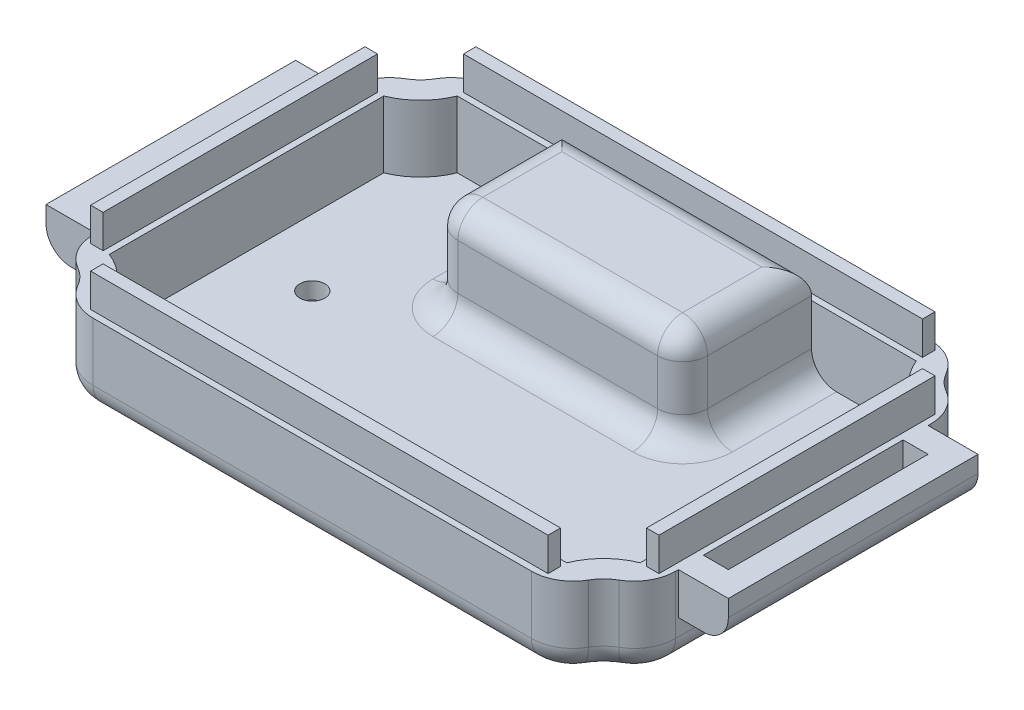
ISO-10303-21;
HEADER;
FILE_DESCRIPTION(('STEP AP214'),'2;1');
FILE_NAME('part.step','',(''),(''),'','','');
FILE_SCHEMA(('AUTOMOTIVE_DESIGN { 1 0 10303 214 1 1 1 1 }'));
ENDSEC;
DATA;
#1=APPLICATION_CONTEXT('core data for automotive mechanical design processes');
#2=APPLICATION_PROTOCOL_DEFINITION('international standard','automotive_design',2000,#1);
#3=PRODUCT_CONTEXT('',#1,'mechanical');
#4=PRODUCT('Part','Part','',(#3));
#5=PRODUCT_RELATED_PRODUCT_CATEGORY('part','',(#4));
#6=PRODUCT_DEFINITION_FORMATION('','',#4);
#7=PRODUCT_DEFINITION_CONTEXT('part definition',#1,'design');
#8=PRODUCT_DEFINITION('design','',#6,#7);
#9=PRODUCT_DEFINITION_SHAPE('','',#8);
#10=(LENGTH_UNIT() NAMED_UNIT(*) SI_UNIT(.MILLI.,.METRE.));
#11=(NAMED_UNIT(*) PLANE_ANGLE_UNIT() SI_UNIT($,.RADIAN.));
#12=(NAMED_UNIT(*) SI_UNIT($,.STERADIAN.) SOLID_ANGLE_UNIT());
#13=UNCERTAINTY_MEASURE_WITH_UNIT(LENGTH_MEASURE(1.E-05),#10,'distance_accuracy_value','');
#14=(GEOMETRIC_REPRESENTATION_CONTEXT(3) GLOBAL_UNCERTAINTY_ASSIGNED_CONTEXT((#13)) GLOBAL_UNIT_ASSIGNED_CONTEXT((#10,
#11,#12)) REPRESENTATION_CONTEXT('',''));
#15=CARTESIAN_POINT('',(0.,0.,0.));
#16=DIRECTION('',(0.,0.,1.));
#17=DIRECTION('',(1.,0.,0.));
#18=AXIS2_PLACEMENT_3D('',#15,#16,#17);
#19=CARTESIAN_POINT('',(35.,10.,-24.));
#20=DIRECTION('',(0.,1.,0.));
#21=DIRECTION('',(0.,0.,1.));
#22=AXIS2_PLACEMENT_3D('',#19,#20,#21);
#23=PLANE('',#22);
#24=CARTESIAN_POINT('',(-35.,10.,-24.));
#25=DIRECTION('',(0.,-1.,0.));
#26=DIRECTION('',(0.,0.,1.));
#27=AXIS2_PLACEMENT_3D('',#24,#25,#26);
#28=CIRCLE('',#27,5.);
#29=CARTESIAN_POINT('',(-30.6698729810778,10.,-21.5));
#30=VERTEX_POINT('',#29);
#31=CARTESIAN_POINT('',(-32.5,10.,-19.6698729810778));
#32=VERTEX_POINT('',#31);
#33=EDGE_CURVE('E1142',#30,#32,#28,.T.);
#34=ORIENTED_EDGE('',*,*,#33,.T.);
#35=CARTESIAN_POINT('',(-30.,10.,-15.3397459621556));
#36=DIRECTION('',(0.,1.,0.));
#37=DIRECTION('',(0.,0.,1.));
#38=AXIS2_PLACEMENT_3D('',#35,#36,#37);
#39=CIRCLE('',#38,5.);
#40=CARTESIAN_POINT('',(-35.,10.,-15.3397459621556));
#41=VERTEX_POINT('',#40);
#42=EDGE_CURVE('E1208',#32,#41,#39,.T.);
#43=ORIENTED_EDGE('',*,*,#42,.T.);
#44=DIRECTION('',(0.,0.,1.));
#45=VECTOR('',#44,1.);
#46=CARTESIAN_POINT('',(-35.,10.,-19.));
#47=LINE('',#46,#45);
#48=CARTESIAN_POINT('',(-35.,10.,-15.));
#49=VERTEX_POINT('',#48);
#50=EDGE_CURVE('E1146',#41,#49,#47,.T.);
#51=ORIENTED_EDGE('',*,*,#50,.T.);
#52=DIRECTION('',(-1.,0.,0.));
#53=VECTOR('',#52,1.);
#54=CARTESIAN_POINT('',(0.,10.,-15.));
#55=LINE('',#54,#53);
#56=CARTESIAN_POINT('',(-41.,10.,-15.));
#57=VERTEX_POINT('',#56);
#58=EDGE_CURVE('E1038',#49,#57,#55,.T.);
#59=ORIENTED_EDGE('',*,*,#58,.T.);
#60=DIRECTION('',(0.,0.,1.));
#61=VECTOR('',#60,1.);
#62=CARTESIAN_POINT('',(-41.,10.,0.));
#63=LINE('',#62,#61);
#64=CARTESIAN_POINT('',(-41.,10.,15.));
#65=VERTEX_POINT('',#64);
#66=EDGE_CURVE('E1041',#57,#65,#63,.T.);
#67=ORIENTED_EDGE('',*,*,#66,.T.);
#68=DIRECTION('',(-1.,0.,0.));
#69=VECTOR('',#68,1.);
#70=CARTESIAN_POINT('',(0.,10.,15.));
#71=LINE('',#70,#69);
#72=CARTESIAN_POINT('',(-35.,10.,15.));
#73=VERTEX_POINT('',#72);
#74=EDGE_CURVE('E1044',#73,#65,#71,.T.);
#75=ORIENTED_EDGE('',*,*,#74,.F.);
#76=CARTESIAN_POINT('',(-35.,10.,15.3397459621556));
#77=VERTEX_POINT('',#76);
#78=EDGE_CURVE('E1145',#73,#77,#47,.T.);
#79=ORIENTED_EDGE('',*,*,#78,.T.);
#80=CARTESIAN_POINT('',(-30.,10.,15.3397459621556));
#81=DIRECTION('',(0.,1.,0.));
#82=DIRECTION('',(0.,0.,1.));
#83=AXIS2_PLACEMENT_3D('',#80,#81,#82);
#84=CIRCLE('',#83,5.);
#85=CARTESIAN_POINT('',(-32.5,10.,19.6698729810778));
#86=VERTEX_POINT('',#85);
#87=EDGE_CURVE('E1194',#77,#86,#84,.T.);
#88=ORIENTED_EDGE('',*,*,#87,.T.);
#89=CARTESIAN_POINT('',(-35.,10.,24.));
#90=DIRECTION('',(0.,-1.,0.));
#91=DIRECTION('',(0.,0.,1.));
#92=AXIS2_PLACEMENT_3D('',#89,#90,#91);
#93=CIRCLE('',#92,5.);
#94=CARTESIAN_POINT('',(-30.6698729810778,10.,21.5));
#95=VERTEX_POINT('',#94);
#96=EDGE_CURVE('E1148',#86,#95,#93,.T.);
#97=ORIENTED_EDGE('',*,*,#96,.T.);
#98=CARTESIAN_POINT('',(-26.3397459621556,10.,19.));
#99=DIRECTION('',(0.,1.,0.));
#100=DIRECTION('',(0.,0.,1.));
#101=AXIS2_PLACEMENT_3D('',#98,#99,#100);
#102=CIRCLE('',#101,5.);
#103=CARTESIAN_POINT('',(-26.3397459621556,10.,24.));
#104=VERTEX_POINT('',#103);
#105=EDGE_CURVE('E1196',#95,#104,#102,.T.);
#106=ORIENTED_EDGE('',*,*,#105,.T.);
#107=DIRECTION('',(1.,0.,0.));
#108=VECTOR('',#107,1.);
#109=CARTESIAN_POINT('',(30.,10.,24.));
#110=LINE('',#109,#108);
#111=CARTESIAN_POINT('',(26.3397459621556,10.,24.));
#112=VERTEX_POINT('',#111);
#113=EDGE_CURVE('E1152',#104,#112,#110,.T.);
#114=ORIENTED_EDGE('',*,*,#113,.T.);
#115=CARTESIAN_POINT('',(26.3397459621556,10.,19.));
#116=DIRECTION('',(0.,1.,0.));
#117=DIRECTION('',(0.,0.,1.));
#118=AXIS2_PLACEMENT_3D('',#115,#116,#117);
#119=CIRCLE('',#118,5.);
#120=CARTESIAN_POINT('',(30.6698729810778,10.,21.5));
#121=VERTEX_POINT('',#120);
#122=EDGE_CURVE('E1200',#112,#121,#119,.T.);
#123=ORIENTED_EDGE('',*,*,#122,.T.);
#124=CARTESIAN_POINT('',(35.,10.,24.));
#125=DIRECTION('',(0.,-1.,0.));
#126=DIRECTION('',(0.,0.,1.));
#127=AXIS2_PLACEMENT_3D('',#124,#125,#126);
#128=CIRCLE('',#127,5.);
#129=CARTESIAN_POINT('',(32.5,10.,19.6698729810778));
#130=VERTEX_POINT('',#129);
#131=EDGE_CURVE('E1155',#121,#130,#128,.T.);
#132=ORIENTED_EDGE('',*,*,#131,.T.);
#133=CARTESIAN_POINT('',(30.,10.,15.3397459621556));
#134=DIRECTION('',(0.,1.,0.));
#135=DIRECTION('',(0.,0.,1.));
#136=AXIS2_PLACEMENT_3D('',#133,#134,#135);
#137=CIRCLE('',#136,5.);
#138=CARTESIAN_POINT('',(35.,10.,15.3397459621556));
#139=VERTEX_POINT('',#138);
#140=EDGE_CURVE('E1198',#130,#139,#137,.T.);
#141=ORIENTED_EDGE('',*,*,#140,.T.);
#142=DIRECTION('',(0.,0.,-1.));
#143=VECTOR('',#142,1.);
#144=CARTESIAN_POINT('',(35.,10.,-19.));
#145=LINE('',#144,#143);
#146=CARTESIAN_POINT('',(35.,10.,15.));
#147=VERTEX_POINT('',#146);
#148=EDGE_CURVE('E1159',#139,#147,#145,.T.);
#149=ORIENTED_EDGE('',*,*,#148,.T.);
#150=DIRECTION('',(-1.,0.,0.));
#151=VECTOR('',#150,1.);
#152=CARTESIAN_POINT('',(0.,10.,15.));
#153=LINE('',#152,#151);
#154=CARTESIAN_POINT('',(41.,10.,15.));
#155=VERTEX_POINT('',#154);
#156=EDGE_CURVE('E987',#155,#147,#153,.T.);
#157=ORIENTED_EDGE('',*,*,#156,.F.);
#158=DIRECTION('',(0.,0.,1.));
#159=VECTOR('',#158,1.);
#160=CARTESIAN_POINT('',(41.,10.,0.));
#161=LINE('',#160,#159);
#162=CARTESIAN_POINT('',(41.,10.,-15.));
#163=VERTEX_POINT('',#162);
#164=EDGE_CURVE('E990',#163,#155,#161,.T.);
#165=ORIENTED_EDGE('',*,*,#164,.F.);
#166=DIRECTION('',(-1.,0.,0.));
#167=VECTOR('',#166,1.);
#168=CARTESIAN_POINT('',(0.,10.,-15.));
#169=LINE('',#168,#167);
#170=CARTESIAN_POINT('',(35.,10.,-15.));
#171=VERTEX_POINT('',#170);
#172=EDGE_CURVE('E965',#163,#171,#169,.T.);
#173=ORIENTED_EDGE('',*,*,#172,.T.);
#174=CARTESIAN_POINT('',(35.,10.,-15.3397459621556));
#175=VERTEX_POINT('',#174);
#176=EDGE_CURVE('E1158',#171,#175,#145,.T.);
#177=ORIENTED_EDGE('',*,*,#176,.T.);
#178=CARTESIAN_POINT('',(30.,10.,-15.3397459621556));
#179=DIRECTION('',(0.,1.,0.));
#180=DIRECTION('',(0.,0.,1.));
#181=AXIS2_PLACEMENT_3D('',#178,#179,#180);
#182=CIRCLE('',#181,5.);
#183=CARTESIAN_POINT('',(32.5,10.,-19.6698729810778));
#184=VERTEX_POINT('',#183);
#185=EDGE_CURVE('E1202',#175,#184,#182,.T.);
#186=ORIENTED_EDGE('',*,*,#185,.T.);
#187=CARTESIAN_POINT('',(35.,10.,-24.));
#188=DIRECTION('',(0.,-1.,0.));
#189=DIRECTION('',(0.,0.,1.));
#190=AXIS2_PLACEMENT_3D('',#187,#188,#189);
#191=CIRCLE('',#190,5.);
#192=CARTESIAN_POINT('',(30.6698729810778,10.,-21.5));
#193=VERTEX_POINT('',#192);
#194=EDGE_CURVE('E1121',#184,#193,#191,.T.);
#195=ORIENTED_EDGE('',*,*,#194,.T.);
#196=CARTESIAN_POINT('',(26.3397459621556,10.,-19.));
#197=DIRECTION('',(0.,1.,0.));
#198=DIRECTION('',(0.,0.,1.));
#199=AXIS2_PLACEMENT_3D('',#196,#197,#198);
#200=CIRCLE('',#199,5.);
#201=CARTESIAN_POINT('',(26.3397459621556,10.,-24.));
#202=VERTEX_POINT('',#201);
#203=EDGE_CURVE('E1204',#193,#202,#200,.T.);
#204=ORIENTED_EDGE('',*,*,#203,.T.);
#205=DIRECTION('',(-1.,0.,0.));
#206=VECTOR('',#205,1.);
#207=CARTESIAN_POINT('',(30.,10.,-24.));
#208=LINE('',#207,#206);
#209=CARTESIAN_POINT('',(-26.3397459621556,10.,-24.));
#210=VERTEX_POINT('',#209);
#211=EDGE_CURVE('E1139',#202,#210,#208,.T.);
#212=ORIENTED_EDGE('',*,*,#211,.T.);
#213=CARTESIAN_POINT('',(-26.3397459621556,10.,-19.));
#214=DIRECTION('',(0.,1.,0.));
#215=DIRECTION('',(0.,0.,1.));
#216=AXIS2_PLACEMENT_3D('',#213,#214,#215);
#217=CIRCLE('',#216,5.);
#218=EDGE_CURVE('E1206',#210,#30,#217,.T.);
#219=ORIENTED_EDGE('',*,*,#218,.T.);
#220=EDGE_LOOP('',(#34,#43,#51,#59,#67,#75,#79,#88,#97,#106,#114,#123,#132,#141,#149,#157,#165,
#173,#177,#186,#195,#204,#212,#219));
#221=FACE_BOUND('',#220,.T.);
#222=CARTESIAN_POINT('',(35.,10.,12.));
#223=VERTEX_POINT('',#222);
#224=CARTESIAN_POINT('',(35.,10.,-12.));
#225=VERTEX_POINT('',#224);
#226=EDGE_CURVE('E1162',#223,#225,#145,.T.);
#227=ORIENTED_EDGE('',*,*,#226,.T.);
#228=DIRECTION('',(1.,0.,0.));
#229=VECTOR('',#228,1.);
#230=CARTESIAN_POINT('',(0.,10.,-12.));
#231=LINE('',#230,#229);
#232=CARTESIAN_POINT('',(38.,10.,-12.));
#233=VERTEX_POINT('',#232);
#234=EDGE_CURVE('E977',#225,#233,#231,.T.);
#235=ORIENTED_EDGE('',*,*,#234,.T.);
#236=DIRECTION('',(0.,0.,1.));
#237=VECTOR('',#236,1.);
#238=CARTESIAN_POINT('',(38.,10.,0.));
#239=LINE('',#238,#237);
#240=CARTESIAN_POINT('',(38.,10.,12.));
#241=VERTEX_POINT('',#240);
#242=EDGE_CURVE('E980',#233,#241,#239,.T.);
#243=ORIENTED_EDGE('',*,*,#242,.T.);
#244=DIRECTION('',(1.,0.,0.));
#245=VECTOR('',#244,1.);
#246=CARTESIAN_POINT('',(0.,10.,12.));
#247=LINE('',#246,#245);
#248=EDGE_CURVE('E984',#223,#241,#247,.T.);
#249=ORIENTED_EDGE('',*,*,#248,.F.);
#250=EDGE_LOOP('',(#227,#235,#243,#249));
#251=FACE_BOUND('',#250,.T.);
#252=CARTESIAN_POINT('',(35.,10.,-24.));
#253=DIRECTION('',(0.,-1.,0.));
#254=DIRECTION('',(0.,0.,1.));
#255=AXIS2_PLACEMENT_3D('',#252,#253,#254);
#256=CIRCLE('',#255,8.);
#257=CARTESIAN_POINT('',(32.,10.,-16.5838015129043));
#258=VERTEX_POINT('',#257);
#259=CARTESIAN_POINT('',(27.5838015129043,10.,-21.));
#260=VERTEX_POINT('',#259);
#261=EDGE_CURVE('E1051',#258,#260,#256,.T.);
#262=ORIENTED_EDGE('',*,*,#261,.F.);
#263=DIRECTION('',(0.,0.,-1.));
#264=VECTOR('',#263,1.);
#265=CARTESIAN_POINT('',(32.,10.,-16.5838015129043));
#266=LINE('',#265,#264);
#267=CARTESIAN_POINT('',(32.,10.,16.5838015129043));
#268=VERTEX_POINT('',#267);
#269=EDGE_CURVE('E1074',#268,#258,#266,.T.);
#270=ORIENTED_EDGE('',*,*,#269,.F.);
#271=CARTESIAN_POINT('',(35.,10.,24.));
#272=DIRECTION('',(0.,-1.,0.));
#273=DIRECTION('',(0.,0.,1.));
#274=AXIS2_PLACEMENT_3D('',#271,#272,#273);
#275=CIRCLE('',#274,8.);
#276=CARTESIAN_POINT('',(27.5838015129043,10.,21.));
#277=VERTEX_POINT('',#276);
#278=EDGE_CURVE('E1114',#277,#268,#275,.T.);
#279=ORIENTED_EDGE('',*,*,#278,.F.);
#280=DIRECTION('',(1.,0.,0.));
#281=VECTOR('',#280,1.);
#282=CARTESIAN_POINT('',(-27.3874291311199,10.,21.));
#283=LINE('',#282,#281);
#284=CARTESIAN_POINT('',(-27.3874291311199,10.,21.));
#285=VERTEX_POINT('',#284);
#286=EDGE_CURVE('E1111',#285,#277,#283,.T.);
#287=ORIENTED_EDGE('',*,*,#286,.F.);
#288=CARTESIAN_POINT('',(-35.,10.,24.));
#289=DIRECTION('',(0.,-1.,0.));
#290=DIRECTION('',(0.,0.,1.));
#291=AXIS2_PLACEMENT_3D('',#288,#289,#290);
#292=CIRCLE('',#291,8.18237344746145);
#293=CARTESIAN_POINT('',(-32.,10.,16.3874291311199));
#294=VERTEX_POINT('',#293);
#295=EDGE_CURVE('E1108',#294,#285,#292,.T.);
#296=ORIENTED_EDGE('',*,*,#295,.F.);
#297=DIRECTION('',(0.,0.,1.));
#298=VECTOR('',#297,1.);
#299=CARTESIAN_POINT('',(-32.,10.,-16.5838015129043));
#300=LINE('',#299,#298);
#301=CARTESIAN_POINT('',(-32.,10.,-16.5838015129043));
#302=VERTEX_POINT('',#301);
#303=EDGE_CURVE('E1105',#302,#294,#300,.T.);
#304=ORIENTED_EDGE('',*,*,#303,.F.);
#305=CARTESIAN_POINT('',(-35.,10.,-24.));
#306=DIRECTION('',(0.,-1.,0.));
#307=DIRECTION('',(0.,0.,1.));
#308=AXIS2_PLACEMENT_3D('',#305,#306,#307);
#309=CIRCLE('',#308,8.);
#310=CARTESIAN_POINT('',(-27.5838015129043,10.,-21.));
#311=VERTEX_POINT('',#310);
#312=EDGE_CURVE('E1102',#311,#302,#309,.T.);
#313=ORIENTED_EDGE('',*,*,#312,.F.);
#314=DIRECTION('',(-1.,0.,0.));
#315=VECTOR('',#314,1.);
#316=CARTESIAN_POINT('',(-27.5838015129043,10.,-21.));
#317=LINE('',#316,#315);
#318=CARTESIAN_POINT('',(-15.,10.,-21.));
#319=VERTEX_POINT('',#318);
#320=EDGE_CURVE('E1098',#319,#311,#317,.T.);
#321=ORIENTED_EDGE('',*,*,#320,.F.);
#322=DIRECTION('',(1.,0.,0.));
#323=VECTOR('',#322,1.);
#324=CARTESIAN_POINT('',(35.,10.,-21.));
#325=LINE('',#324,#323);
#326=CARTESIAN_POINT('',(15.,10.,-21.));
#327=VERTEX_POINT('',#326);
#328=EDGE_CURVE('E922',#319,#327,#325,.T.);
#329=ORIENTED_EDGE('',*,*,#328,.T.);
#330=EDGE_CURVE('E1099',#260,#327,#317,.T.);
#331=ORIENTED_EDGE('',*,*,#330,.F.);
#332=EDGE_LOOP('',(#262,#270,#279,#287,#296,#304,#313,#321,#329,#331));
#333=FACE_BOUND('',#332,.T.);
#334=CARTESIAN_POINT('',(-35.,10.,-12.));
#335=VERTEX_POINT('',#334);
#336=CARTESIAN_POINT('',(-35.,10.,12.));
#337=VERTEX_POINT('',#336);
#338=EDGE_CURVE('E1149',#335,#337,#47,.T.);
#339=ORIENTED_EDGE('',*,*,#338,.T.);
#340=DIRECTION('',(-1.,0.,0.));
#341=VECTOR('',#340,1.);
#342=CARTESIAN_POINT('',(0.,10.,12.));
#343=LINE('',#342,#341);
#344=CARTESIAN_POINT('',(-38.,10.,12.));
#345=VERTEX_POINT('',#344);
#346=EDGE_CURVE('E1019',#337,#345,#343,.T.);
#347=ORIENTED_EDGE('',*,*,#346,.T.);
#348=DIRECTION('',(0.,0.,1.));
#349=VECTOR('',#348,1.);
#350=CARTESIAN_POINT('',(-38.,10.,0.));
#351=LINE('',#350,#349);
#352=CARTESIAN_POINT('',(-38.,10.,-12.));
#353=VERTEX_POINT('',#352);
#354=EDGE_CURVE('E997',#353,#345,#351,.T.);
#355=ORIENTED_EDGE('',*,*,#354,.F.);
#356=DIRECTION('',(-1.,0.,0.));
#357=VECTOR('',#356,1.);
#358=CARTESIAN_POINT('',(0.,10.,-12.));
#359=LINE('',#358,#357);
#360=EDGE_CURVE('E1036',#335,#353,#359,.T.);
#361=ORIENTED_EDGE('',*,*,#360,.F.);
#362=EDGE_LOOP('',(#339,#347,#355,#361));
#363=FACE_BOUND('',#362,.T.);
#364=DIRECTION('',(1.,0.,0.));
#365=VECTOR('',#364,1.);
#366=CARTESIAN_POINT('',(-27.5838015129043,10.,-21.75));
#367=LINE('',#366,#365);
#368=CARTESIAN_POINT('',(-27.5838015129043,10.,-21.75));
#369=VERTEX_POINT('',#368);
#370=CARTESIAN_POINT('',(27.5838015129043,10.,-21.75));
#371=VERTEX_POINT('',#370);
#372=EDGE_CURVE('E755',#369,#371,#367,.T.);
#373=ORIENTED_EDGE('',*,*,#372,.F.);
#374=DIRECTION('',(0.,0.,1.));
#375=VECTOR('',#374,1.);
#376=CARTESIAN_POINT('',(-27.5838015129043,10.,-21.75));
#377=LINE('',#376,#375);
#378=CARTESIAN_POINT('',(-27.5838015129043,10.,-23.25));
#379=VERTEX_POINT('',#378);
#380=EDGE_CURVE('E741',#379,#369,#377,.T.);
#381=ORIENTED_EDGE('',*,*,#380,.F.);
#382=DIRECTION('',(-1.,0.,0.));
#383=VECTOR('',#382,1.);
#384=CARTESIAN_POINT('',(-27.5838015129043,10.,-23.25));
#385=LINE('',#384,#383);
#386=CARTESIAN_POINT('',(27.5838015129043,10.,-23.25));
#387=VERTEX_POINT('',#386);
#388=EDGE_CURVE('E746',#387,#379,#385,.T.);
#389=ORIENTED_EDGE('',*,*,#388,.F.);
#390=DIRECTION('',(0.,0.,-1.));
#391=VECTOR('',#390,1.);
#392=CARTESIAN_POINT('',(27.5838015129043,10.,-21.75));
#393=LINE('',#392,#391);
#394=EDGE_CURVE('E757',#371,#387,#393,.T.);
#395=ORIENTED_EDGE('',*,*,#394,.F.);
#396=EDGE_LOOP('',(#373,#381,#389,#395));
#397=FACE_BOUND('',#396,.T.);
#398=DIRECTION('',(-1.,0.,0.));
#399=VECTOR('',#398,1.);
#400=CARTESIAN_POINT('',(-32.75,10.,-16.5838015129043));
#401=LINE('',#400,#399);
#402=CARTESIAN_POINT('',(-32.75,10.,-16.5838015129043));
#403=VERTEX_POINT('',#402);
#404=CARTESIAN_POINT('',(-34.25,10.,-16.5838015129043));
#405=VERTEX_POINT('',#404);
#406=EDGE_CURVE('E726',#403,#405,#401,.T.);
#407=ORIENTED_EDGE('',*,*,#406,.F.);
#408=DIRECTION('',(0.,0.,-1.));
#409=VECTOR('',#408,1.);
#410=CARTESIAN_POINT('',(-32.75,10.,16.3874291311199));
#411=LINE('',#410,#409);
#412=CARTESIAN_POINT('',(-32.75,10.,16.3874291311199));
#413=VERTEX_POINT('',#412);
#414=EDGE_CURVE('E712',#413,#403,#411,.T.);
#415=ORIENTED_EDGE('',*,*,#414,.F.);
#416=DIRECTION('',(1.,0.,0.));
#417=VECTOR('',#416,1.);
#418=CARTESIAN_POINT('',(-32.75,10.,16.3874291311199));
#419=LINE('',#418,#417);
#420=CARTESIAN_POINT('',(-34.25,10.,16.3874291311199));
#421=VERTEX_POINT('',#420);
#422=EDGE_CURVE('E717',#421,#413,#419,.T.);
#423=ORIENTED_EDGE('',*,*,#422,.F.);
#424=DIRECTION('',(0.,0.,1.));
#425=VECTOR('',#424,1.);
#426=CARTESIAN_POINT('',(-34.25,10.,16.3874291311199));
#427=LINE('',#426,#425);
#428=EDGE_CURVE('E728',#405,#421,#427,.T.);
#429=ORIENTED_EDGE('',*,*,#428,.F.);
#430=EDGE_LOOP('',(#407,#415,#423,#429));
#431=FACE_BOUND('',#430,.T.);
#432=DIRECTION('',(1.,0.,0.));
#433=VECTOR('',#432,1.);
#434=CARTESIAN_POINT('',(-27.3874291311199,10.,23.25));
#435=LINE('',#434,#433);
#436=CARTESIAN_POINT('',(-27.3874291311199,10.,23.25));
#437=VERTEX_POINT('',#436);
#438=CARTESIAN_POINT('',(27.5838015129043,10.,23.25));
#439=VERTEX_POINT('',#438);
#440=EDGE_CURVE('E684',#437,#439,#435,.T.);
#441=ORIENTED_EDGE('',*,*,#440,.F.);
#442=DIRECTION('',(0.,0.,1.));
#443=VECTOR('',#442,1.);
#444=CARTESIAN_POINT('',(-27.3874291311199,10.,21.75));
#445=LINE('',#444,#443);
#446=CARTESIAN_POINT('',(-27.3874291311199,10.,21.75));
#447=VERTEX_POINT('',#446);
#448=EDGE_CURVE('E681',#447,#437,#445,.T.);
#449=ORIENTED_EDGE('',*,*,#448,.F.);
#450=DIRECTION('',(-1.,0.,0.));
#451=VECTOR('',#450,1.);
#452=CARTESIAN_POINT('',(-27.3874291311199,10.,21.75));
#453=LINE('',#452,#451);
#454=CARTESIAN_POINT('',(27.5838015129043,10.,21.75));
#455=VERTEX_POINT('',#454);
#456=EDGE_CURVE('E693',#455,#447,#453,.T.);
#457=ORIENTED_EDGE('',*,*,#456,.F.);
#458=DIRECTION('',(0.,0.,-1.));
#459=VECTOR('',#458,1.);
#460=CARTESIAN_POINT('',(27.5838015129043,10.,21.75));
#461=LINE('',#460,#459);
#462=EDGE_CURVE('E701',#439,#455,#461,.T.);
#463=ORIENTED_EDGE('',*,*,#462,.F.);
#464=EDGE_LOOP('',(#441,#449,#457,#463));
#465=FACE_BOUND('',#464,.T.);
#466=DIRECTION('',(1.,0.,0.));
#467=VECTOR('',#466,1.);
#468=CARTESIAN_POINT('',(32.75,10.,16.5838015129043));
#469=LINE('',#468,#467);
#470=CARTESIAN_POINT('',(32.75,10.,16.5838015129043));
#471=VERTEX_POINT('',#470);
#472=CARTESIAN_POINT('',(34.25,10.,16.5838015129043));
#473=VERTEX_POINT('',#472);
#474=EDGE_CURVE('E2774',#471,#473,#469,.T.);
#475=ORIENTED_EDGE('',*,*,#474,.F.);
#476=DIRECTION('',(0.,0.,1.));
#477=VECTOR('',#476,1.);
#478=CARTESIAN_POINT('',(32.75,10.,16.5838015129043));
#479=LINE('',#478,#477);
#480=CARTESIAN_POINT('',(32.75,10.,-16.5838015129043));
#481=VERTEX_POINT('',#480);
#482=EDGE_CURVE('E679',#481,#471,#479,.T.);
#483=ORIENTED_EDGE('',*,*,#482,.F.);
#484=DIRECTION('',(-1.,0.,0.));
#485=VECTOR('',#484,1.);
#486=CARTESIAN_POINT('',(32.75,10.,-16.5838015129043));
#487=LINE('',#486,#485);
#488=CARTESIAN_POINT('',(34.25,10.,-16.5838015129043));
#489=VERTEX_POINT('',#488);
#490=EDGE_CURVE('E675',#489,#481,#487,.T.);
#491=ORIENTED_EDGE('',*,*,#490,.F.);
#492=DIRECTION('',(0.,0.,-1.));
#493=VECTOR('',#492,1.);
#494=CARTESIAN_POINT('',(34.25,10.,16.5838015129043));
#495=LINE('',#494,#493);
#496=EDGE_CURVE('E2771',#473,#489,#495,.T.);
#497=ORIENTED_EDGE('',*,*,#496,.F.);
#498=EDGE_LOOP('',(#475,#483,#491,#497));
#499=FACE_BOUND('',#498,.T.);
#500=ADVANCED_FACE('F37',(#221,#251,#333,#363,#397,#431,#465,#499),#23,.T.);
#501=CARTESIAN_POINT('',(15.,1.,-5.5));
#502=DIRECTION('',(0.,0.,1.));
#503=DIRECTION('',(1.,0.,0.));
#504=AXIS2_PLACEMENT_3D('',#501,#502,#503);
#505=PLANE('',#504);
#506=DIRECTION('',(-1.,0.,0.));
#507=VECTOR('',#506,1.);
#508=CARTESIAN_POINT('',(15.,0.,-5.5));
#509=LINE('',#508,#507);
#510=CARTESIAN_POINT('',(15.,0.,-5.5));
#511=VERTEX_POINT('',#510);
#512=CARTESIAN_POINT('',(2.5,0.,-5.5));
#513=VERTEX_POINT('',#512);
#514=EDGE_CURVE('E945',#511,#513,#509,.T.);
#515=ORIENTED_EDGE('',*,*,#514,.T.);
#516=DIRECTION('',(0.,-1.,0.));
#517=VECTOR('',#516,1.);
#518=CARTESIAN_POINT('',(2.5,4.,-5.5));
#519=LINE('',#518,#517);
#520=CARTESIAN_POINT('',(2.5,1.,-5.5));
#521=VERTEX_POINT('',#520);
#522=EDGE_CURVE('E799',#521,#513,#519,.T.);
#523=ORIENTED_EDGE('',*,*,#522,.F.);
#524=DIRECTION('',(-1.,0.,0.));
#525=VECTOR('',#524,1.);
#526=CARTESIAN_POINT('',(15.,1.,-5.5));
#527=LINE('',#526,#525);
#528=CARTESIAN_POINT('',(15.,1.,-5.5));
#529=VERTEX_POINT('',#528);
#530=EDGE_CURVE('E934',#529,#521,#527,.T.);
#531=ORIENTED_EDGE('',*,*,#530,.F.);
#532=DIRECTION('',(0.,-1.,0.));
#533=VECTOR('',#532,1.);
#534=CARTESIAN_POINT('',(15.,1.,-5.5));
#535=LINE('',#534,#533);
#536=EDGE_CURVE('E952',#529,#511,#535,.T.);
#537=ORIENTED_EDGE('',*,*,#536,.T.);
#538=EDGE_LOOP('',(#515,#523,#531,#537));
#539=FACE_BOUND('',#538,.T.);
#540=ADVANCED_FACE('F1542',(#539),#505,.F.);
#541=CARTESIAN_POINT('',(-27.5838015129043,2.,-21.));
#542=DIRECTION('',(0.,0.,-1.));
#543=DIRECTION('',(-1.,0.,0.));
#544=AXIS2_PLACEMENT_3D('',#541,#542,#543);
#545=PLANE('',#544);
#546=DIRECTION('',(0.,-1.,0.));
#547=VECTOR('',#546,1.);
#548=CARTESIAN_POINT('',(15.,13.5,-21.));
#549=LINE('',#548,#547);
#550=CARTESIAN_POINT('',(15.,5.,-21.));
#551=VERTEX_POINT('',#550);
#552=EDGE_CURVE('E910',#327,#551,#549,.T.);
#553=ORIENTED_EDGE('',*,*,#552,.T.);
#554=CARTESIAN_POINT('',(18.,5.,-21.));
#555=DIRECTION('',(0.,0.,-1.));
#556=DIRECTION('',(-1.,0.,0.));
#557=AXIS2_PLACEMENT_3D('',#554,#555,#556);
#558=CIRCLE('',#557,3.);
#559=CARTESIAN_POINT('',(18.,2.,-21.));
#560=VERTEX_POINT('',#559);
#561=EDGE_CURVE('E1374',#551,#560,#558,.F.);
#562=ORIENTED_EDGE('',*,*,#561,.T.);
#563=DIRECTION('',(-1.,0.,0.));
#564=VECTOR('',#563,1.);
#565=CARTESIAN_POINT('',(-27.5838015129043,2.,-21.));
#566=LINE('',#565,#564);
#567=CARTESIAN_POINT('',(27.5838015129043,2.,-21.));
#568=VERTEX_POINT('',#567);
#569=EDGE_CURVE('E1075',#568,#560,#566,.T.);
#570=ORIENTED_EDGE('',*,*,#569,.F.);
#571=DIRECTION('',(0.,1.,0.));
#572=VECTOR('',#571,1.);
#573=CARTESIAN_POINT('',(27.5838015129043,2.,-21.));
#574=LINE('',#573,#572);
#575=EDGE_CURVE('E1096',#568,#260,#574,.T.);
#576=ORIENTED_EDGE('',*,*,#575,.T.);
#577=ORIENTED_EDGE('',*,*,#330,.T.);
#578=EDGE_LOOP('',(#553,#562,#570,#576,#577));
#579=FACE_BOUND('',#578,.T.);
#580=ADVANCED_FACE('F1507',(#579),#545,.F.);
#581=CARTESIAN_POINT('',(0.,5.,0.));
#582=DIRECTION('',(0.,1.,0.));
#583=DIRECTION('',(0.,0.,1.));
#584=AXIS2_PLACEMENT_3D('',#581,#582,#583);
#585=PLANE('',#584);
#586=DIRECTION('',(-1.,0.,0.));
#587=VECTOR('',#586,1.);
#588=CARTESIAN_POINT('',(0.,5.,-15.));
#589=LINE('',#588,#587);
#590=CARTESIAN_POINT('',(38.,5.,-15.));
#591=VERTEX_POINT('',#590);
#592=CARTESIAN_POINT('',(35.,5.,-15.));
#593=VERTEX_POINT('',#592);
#594=EDGE_CURVE('E975',#591,#593,#589,.T.);
#595=ORIENTED_EDGE('',*,*,#594,.F.);
#596=DIRECTION('',(0.,0.,1.));
#597=VECTOR('',#596,1.);
#598=CARTESIAN_POINT('',(38.,5.,0.));
#599=LINE('',#598,#597);
#600=CARTESIAN_POINT('',(38.,5.,-12.));
#601=VERTEX_POINT('',#600);
#602=EDGE_CURVE('E1175',#591,#601,#599,.T.);
#603=ORIENTED_EDGE('',*,*,#602,.T.);
#604=DIRECTION('',(1.,0.,0.));
#605=VECTOR('',#604,1.);
#606=CARTESIAN_POINT('',(0.,5.,-12.));
#607=LINE('',#606,#605);
#608=CARTESIAN_POINT('',(35.,5.,-12.));
#609=VERTEX_POINT('',#608);
#610=EDGE_CURVE('E961',#609,#601,#607,.T.);
#611=ORIENTED_EDGE('',*,*,#610,.F.);
#612=DIRECTION('',(0.,0.,-1.));
#613=VECTOR('',#612,1.);
#614=CARTESIAN_POINT('',(35.,5.,0.));
#615=LINE('',#614,#613);
#616=EDGE_CURVE('E973',#609,#593,#615,.T.);
#617=ORIENTED_EDGE('',*,*,#616,.T.);
#618=EDGE_LOOP('',(#595,#603,#611,#617));
#619=FACE_BOUND('',#618,.T.);
#620=ADVANCED_FACE('F1798',(#619),#585,.F.);
#621=CARTESIAN_POINT('',(0.,5.,0.));
#622=DIRECTION('',(0.,1.,0.));
#623=DIRECTION('',(0.,0.,1.));
#624=AXIS2_PLACEMENT_3D('',#621,#622,#623);
#625=PLANE('',#624);
#626=DIRECTION('',(-1.,0.,0.));
#627=VECTOR('',#626,1.);
#628=CARTESIAN_POINT('',(0.,5.,15.));
#629=LINE('',#628,#627);
#630=CARTESIAN_POINT('',(-35.,5.,15.));
#631=VERTEX_POINT('',#630);
#632=CARTESIAN_POINT('',(-38.,5.,15.));
#633=VERTEX_POINT('',#632);
#634=EDGE_CURVE('E1027',#631,#633,#629,.T.);
#635=ORIENTED_EDGE('',*,*,#634,.T.);
#636=DIRECTION('',(0.,0.,1.));
#637=VECTOR('',#636,1.);
#638=CARTESIAN_POINT('',(-38.,5.,-15.));
#639=LINE('',#638,#637);
#640=CARTESIAN_POINT('',(-38.,5.,12.));
#641=VERTEX_POINT('',#640);
#642=EDGE_CURVE('E1169',#633,#641,#639,.F.);
#643=ORIENTED_EDGE('',*,*,#642,.T.);
#644=DIRECTION('',(-1.,0.,0.));
#645=VECTOR('',#644,1.);
#646=CARTESIAN_POINT('',(0.,5.,12.));
#647=LINE('',#646,#645);
#648=CARTESIAN_POINT('',(-35.,5.,12.));
#649=VERTEX_POINT('',#648);
#650=EDGE_CURVE('E1030',#649,#641,#647,.T.);
#651=ORIENTED_EDGE('',*,*,#650,.F.);
#652=DIRECTION('',(0.,0.,1.));
#653=VECTOR('',#652,1.);
#654=CARTESIAN_POINT('',(-35.,5.,0.));
#655=LINE('',#654,#653);
#656=EDGE_CURVE('E1024',#649,#631,#655,.T.);
#657=ORIENTED_EDGE('',*,*,#656,.T.);
#658=EDGE_LOOP('',(#635,#643,#651,#657));
#659=FACE_BOUND('',#658,.T.);
#660=ADVANCED_FACE('F1563',(#659),#625,.F.);
#661=CARTESIAN_POINT('',(35.,10.,-19.));
#662=DIRECTION('',(-1.,0.,0.));
#663=DIRECTION('',(0.,0.,1.));
#664=AXIS2_PLACEMENT_3D('',#661,#662,#663);
#665=PLANE('',#664);
#666=DIRECTION('',(0.,-1.,0.));
#667=VECTOR('',#666,1.);
#668=CARTESIAN_POINT('',(35.,10.,15.3397459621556));
#669=LINE('',#668,#667);
#670=CARTESIAN_POINT('',(35.,3.,15.3397459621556));
#671=VERTEX_POINT('',#670);
#672=EDGE_CURVE('E1220',#139,#671,#669,.T.);
#673=ORIENTED_EDGE('',*,*,#672,.T.);
#674=DIRECTION('',(0.,0.,-1.));
#675=VECTOR('',#674,1.);
#676=CARTESIAN_POINT('',(35.,3.,-19.));
#677=LINE('',#676,#675);
#678=CARTESIAN_POINT('',(35.,3.,-15.3397459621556));
#679=VERTEX_POINT('',#678);
#680=EDGE_CURVE('E1290',#671,#679,#677,.T.);
#681=ORIENTED_EDGE('',*,*,#680,.T.);
#682=DIRECTION('',(0.,-1.,0.));
#683=VECTOR('',#682,1.);
#684=CARTESIAN_POINT('',(35.,10.,-15.3397459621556));
#685=LINE('',#684,#683);
#686=EDGE_CURVE('E1223',#679,#175,#685,.F.);
#687=ORIENTED_EDGE('',*,*,#686,.T.);
#688=ORIENTED_EDGE('',*,*,#176,.F.);
#689=DIRECTION('',(0.,1.,0.));
#690=VECTOR('',#689,1.);
#691=CARTESIAN_POINT('',(35.,5.,-15.));
#692=LINE('',#691,#690);
#693=EDGE_CURVE('E998',#593,#171,#692,.T.);
#694=ORIENTED_EDGE('',*,*,#693,.F.);
#695=ORIENTED_EDGE('',*,*,#616,.F.);
#696=DIRECTION('',(0.,1.,0.));
#697=VECTOR('',#696,1.);
#698=CARTESIAN_POINT('',(35.,5.,-12.));
#699=LINE('',#698,#697);
#700=EDGE_CURVE('E994',#609,#225,#699,.T.);
#701=ORIENTED_EDGE('',*,*,#700,.T.);
#702=ORIENTED_EDGE('',*,*,#226,.F.);
#703=DIRECTION('',(0.,1.,0.));
#704=VECTOR('',#703,1.);
#705=CARTESIAN_POINT('',(35.,5.,12.));
#706=LINE('',#705,#704);
#707=CARTESIAN_POINT('',(35.,5.,12.));
#708=VERTEX_POINT('',#707);
#709=EDGE_CURVE('E1008',#708,#223,#706,.T.);
#710=ORIENTED_EDGE('',*,*,#709,.F.);
#711=CARTESIAN_POINT('',(35.,5.,15.));
#712=VERTEX_POINT('',#711);
#713=EDGE_CURVE('E970',#712,#708,#615,.T.);
#714=ORIENTED_EDGE('',*,*,#713,.F.);
#715=DIRECTION('',(0.,1.,0.));
#716=VECTOR('',#715,1.);
#717=CARTESIAN_POINT('',(35.,5.,15.));
#718=LINE('',#717,#716);
#719=EDGE_CURVE('E1005',#712,#147,#718,.T.);
#720=ORIENTED_EDGE('',*,*,#719,.T.);
#721=ORIENTED_EDGE('',*,*,#148,.F.);
#722=EDGE_LOOP('',(#673,#681,#687,#688,#694,#695,#701,#702,#710,#714,#720,#721));
#723=FACE_BOUND('',#722,.T.);
#724=ADVANCED_FACE('F1559',(#723),#665,.F.);
#725=CARTESIAN_POINT('',(35.,10.,-24.));
#726=DIRECTION('',(0.,-1.,0.));
#727=DIRECTION('',(0.,0.,-1.));
#728=AXIS2_PLACEMENT_3D('',#725,#726,#727);
#729=CYLINDRICAL_SURFACE('',#728,5.);
#730=DIRECTION('',(0.,-1.,0.));
#731=VECTOR('',#730,1.);
#732=CARTESIAN_POINT('',(32.5,10.,-19.6698729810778));
#733=LINE('',#732,#731);
#734=CARTESIAN_POINT('',(32.5,3.,-19.6698729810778));
#735=VERTEX_POINT('',#734);
#736=EDGE_CURVE('E1215',#184,#735,#733,.T.);
#737=ORIENTED_EDGE('',*,*,#736,.T.);
#738=CARTESIAN_POINT('',(35.,3.,-24.));
#739=DIRECTION('',(0.,1.,0.));
#740=DIRECTION('',(0.,0.,1.));
#741=AXIS2_PLACEMENT_3D('',#738,#739,#740);
#742=CIRCLE('',#741,5.);
#743=CARTESIAN_POINT('',(30.6698729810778,3.,-21.5));
#744=VERTEX_POINT('',#743);
#745=EDGE_CURVE('E1294',#735,#744,#742,.F.);
#746=ORIENTED_EDGE('',*,*,#745,.T.);
#747=DIRECTION('',(0.,-1.,0.));
#748=VECTOR('',#747,1.);
#749=CARTESIAN_POINT('',(30.6698729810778,10.,-21.5));
#750=LINE('',#749,#748);
#751=EDGE_CURVE('E1218',#744,#193,#750,.F.);
#752=ORIENTED_EDGE('',*,*,#751,.T.);
#753=ORIENTED_EDGE('',*,*,#194,.F.);
#754=EDGE_LOOP('',(#737,#746,#752,#753));
#755=FACE_BOUND('',#754,.T.);
#756=ADVANCED_FACE('F1562',(#755),#729,.F.);
#757=CARTESIAN_POINT('',(30.,10.,-24.));
#758=DIRECTION('',(0.,0.,1.));
#759=DIRECTION('',(1.,0.,0.));
#760=AXIS2_PLACEMENT_3D('',#757,#758,#759);
#761=PLANE('',#760);
#762=DIRECTION('',(0.,-1.,0.));
#763=VECTOR('',#762,1.);
#764=CARTESIAN_POINT('',(26.3397459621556,10.,-24.));
#765=LINE('',#764,#763);
#766=CARTESIAN_POINT('',(26.3397459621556,3.,-24.));
#767=VERTEX_POINT('',#766);
#768=EDGE_CURVE('E1210',#202,#767,#765,.T.);
#769=ORIENTED_EDGE('',*,*,#768,.T.);
#770=DIRECTION('',(-1.,0.,0.));
#771=VECTOR('',#770,1.);
#772=CARTESIAN_POINT('',(30.,3.,-24.));
#773=LINE('',#772,#771);
#774=CARTESIAN_POINT('',(-26.3397459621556,3.,-24.));
#775=VERTEX_POINT('',#774);
#776=EDGE_CURVE('E1298',#767,#775,#773,.T.);
#777=ORIENTED_EDGE('',*,*,#776,.T.);
#778=DIRECTION('',(0.,-1.,0.));
#779=VECTOR('',#778,1.);
#780=CARTESIAN_POINT('',(-26.3397459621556,10.,-24.));
#781=LINE('',#780,#779);
#782=EDGE_CURVE('E1213',#775,#210,#781,.F.);
#783=ORIENTED_EDGE('',*,*,#782,.T.);
#784=ORIENTED_EDGE('',*,*,#211,.F.);
#785=EDGE_LOOP('',(#769,#777,#783,#784));
#786=FACE_BOUND('',#785,.T.);
#787=ADVANCED_FACE('F1583',(#786),#761,.F.);
#788=CARTESIAN_POINT('',(-35.,10.,-24.));
#789=DIRECTION('',(0.,-1.,0.));
#790=DIRECTION('',(0.,0.,-1.));
#791=AXIS2_PLACEMENT_3D('',#788,#789,#790);
#792=CYLINDRICAL_SURFACE('',#791,5.);
#793=DIRECTION('',(0.,-1.,0.));
#794=VECTOR('',#793,1.);
#795=CARTESIAN_POINT('',(-30.6698729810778,10.,-21.5));
#796=LINE('',#795,#794);
#797=CARTESIAN_POINT('',(-30.6698729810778,3.,-21.5));
#798=VERTEX_POINT('',#797);
#799=EDGE_CURVE('E1189',#30,#798,#796,.T.);
#800=ORIENTED_EDGE('',*,*,#799,.T.);
#801=CARTESIAN_POINT('',(-35.,3.,-24.));
#802=DIRECTION('',(0.,1.,0.));
#803=DIRECTION('',(0.,0.,1.));
#804=AXIS2_PLACEMENT_3D('',#801,#802,#803);
#805=CIRCLE('',#804,5.);
#806=CARTESIAN_POINT('',(-32.5,3.,-19.6698729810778));
#807=VERTEX_POINT('',#806);
#808=EDGE_CURVE('E1302',#798,#807,#805,.F.);
#809=ORIENTED_EDGE('',*,*,#808,.T.);
#810=DIRECTION('',(0.,-1.,0.));
#811=VECTOR('',#810,1.);
#812=CARTESIAN_POINT('',(-32.5,10.,-19.6698729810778));
#813=LINE('',#812,#811);
#814=EDGE_CURVE('E1192',#807,#32,#813,.F.);
#815=ORIENTED_EDGE('',*,*,#814,.T.);
#816=ORIENTED_EDGE('',*,*,#33,.F.);
#817=EDGE_LOOP('',(#800,#809,#815,#816));
#818=FACE_BOUND('',#817,.T.);
#819=ADVANCED_FACE('F1579',(#818),#792,.F.);
#820=CARTESIAN_POINT('',(-35.,10.,-19.));
#821=DIRECTION('',(1.,0.,0.));
#822=DIRECTION('',(0.,0.,-1.));
#823=AXIS2_PLACEMENT_3D('',#820,#821,#822);
#824=PLANE('',#823);
#825=DIRECTION('',(0.,-1.,0.));
#826=VECTOR('',#825,1.);
#827=CARTESIAN_POINT('',(-35.,10.,-15.3397459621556));
#828=LINE('',#827,#826);
#829=CARTESIAN_POINT('',(-35.,3.,-15.3397459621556));
#830=VERTEX_POINT('',#829);
#831=EDGE_CURVE('E1186',#41,#830,#828,.T.);
#832=ORIENTED_EDGE('',*,*,#831,.T.);
#833=DIRECTION('',(0.,0.,1.));
#834=VECTOR('',#833,1.);
#835=CARTESIAN_POINT('',(-35.,3.,-19.));
#836=LINE('',#835,#834);
#837=CARTESIAN_POINT('',(-35.,3.,15.3397459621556));
#838=VERTEX_POINT('',#837);
#839=EDGE_CURVE('E1306',#830,#838,#836,.T.);
#840=ORIENTED_EDGE('',*,*,#839,.T.);
#841=DIRECTION('',(0.,-1.,0.));
#842=VECTOR('',#841,1.);
#843=CARTESIAN_POINT('',(-35.,10.,15.3397459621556));
#844=LINE('',#843,#842);
#845=EDGE_CURVE('E1184',#838,#77,#844,.F.);
#846=ORIENTED_EDGE('',*,*,#845,.T.);
#847=ORIENTED_EDGE('',*,*,#78,.F.);
#848=DIRECTION('',(0.,1.,0.));
#849=VECTOR('',#848,1.);
#850=CARTESIAN_POINT('',(-35.,5.,15.));
#851=LINE('',#850,#849);
#852=EDGE_CURVE('E1055',#631,#73,#851,.T.);
#853=ORIENTED_EDGE('',*,*,#852,.F.);
#854=ORIENTED_EDGE('',*,*,#656,.F.);
#855=DIRECTION('',(0.,1.,0.));
#856=VECTOR('',#855,1.);
#857=CARTESIAN_POINT('',(-35.,5.,12.));
#858=LINE('',#857,#856);
#859=EDGE_CURVE('E1052',#649,#337,#858,.T.);
#860=ORIENTED_EDGE('',*,*,#859,.T.);
#861=ORIENTED_EDGE('',*,*,#338,.F.);
#862=DIRECTION('',(0.,1.,0.));
#863=VECTOR('',#862,1.);
#864=CARTESIAN_POINT('',(-35.,5.,-12.));
#865=LINE('',#864,#863);
#866=CARTESIAN_POINT('',(-35.,5.,-12.));
#867=VERTEX_POINT('',#866);
#868=EDGE_CURVE('E1065',#867,#335,#865,.T.);
#869=ORIENTED_EDGE('',*,*,#868,.F.);
#870=CARTESIAN_POINT('',(-35.,5.,-15.));
#871=VERTEX_POINT('',#870);
#872=EDGE_CURVE('E1021',#871,#867,#655,.T.);
#873=ORIENTED_EDGE('',*,*,#872,.F.);
#874=DIRECTION('',(0.,1.,0.));
#875=VECTOR('',#874,1.);
#876=CARTESIAN_POINT('',(-35.,5.,-15.));
#877=LINE('',#876,#875);
#878=EDGE_CURVE('E1062',#871,#49,#877,.T.);
#879=ORIENTED_EDGE('',*,*,#878,.T.);
#880=ORIENTED_EDGE('',*,*,#50,.F.);
#881=EDGE_LOOP('',(#832,#840,#846,#847,#853,#854,#860,#861,#869,#873,#879,#880));
#882=FACE_BOUND('',#881,.T.);
#883=ADVANCED_FACE('F1575',(#882),#824,.F.);
#884=CARTESIAN_POINT('',(-35.,10.,24.));
#885=DIRECTION('',(0.,-1.,0.));
#886=DIRECTION('',(0.,0.,-1.));
#887=AXIS2_PLACEMENT_3D('',#884,#885,#886);
#888=CYLINDRICAL_SURFACE('',#887,5.);
#889=DIRECTION('',(0.,-1.,0.));
#890=VECTOR('',#889,1.);
#891=CARTESIAN_POINT('',(-32.5,10.,19.6698729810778));
#892=LINE('',#891,#890);
#893=CARTESIAN_POINT('',(-32.5,3.,19.6698729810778));
#894=VERTEX_POINT('',#893);
#895=EDGE_CURVE('E1235',#86,#894,#892,.T.);
#896=ORIENTED_EDGE('',*,*,#895,.T.);
#897=CARTESIAN_POINT('',(-35.,3.,24.));
#898=DIRECTION('',(0.,1.,0.));
#899=DIRECTION('',(0.,0.,1.));
#900=AXIS2_PLACEMENT_3D('',#897,#898,#899);
#901=CIRCLE('',#900,5.);
#902=CARTESIAN_POINT('',(-30.6698729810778,3.,21.5));
#903=VERTEX_POINT('',#902);
#904=EDGE_CURVE('E1278',#894,#903,#901,.F.);
#905=ORIENTED_EDGE('',*,*,#904,.T.);
#906=DIRECTION('',(0.,-1.,0.));
#907=VECTOR('',#906,1.);
#908=CARTESIAN_POINT('',(-30.6698729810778,10.,21.5));
#909=LINE('',#908,#907);
#910=EDGE_CURVE('E1238',#903,#95,#909,.F.);
#911=ORIENTED_EDGE('',*,*,#910,.T.);
#912=ORIENTED_EDGE('',*,*,#96,.F.);
#913=EDGE_LOOP('',(#896,#905,#911,#912));
#914=FACE_BOUND('',#913,.T.);
#915=ADVANCED_FACE('F1571',(#914),#888,.F.);
#916=CARTESIAN_POINT('',(30.,10.,24.));
#917=DIRECTION('',(0.,0.,-1.));
#918=DIRECTION('',(-1.,0.,0.));
#919=AXIS2_PLACEMENT_3D('',#916,#917,#918);
#920=PLANE('',#919);
#921=DIRECTION('',(0.,-1.,0.));
#922=VECTOR('',#921,1.);
#923=CARTESIAN_POINT('',(-26.3397459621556,10.,24.));
#924=LINE('',#923,#922);
#925=CARTESIAN_POINT('',(-26.3397459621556,3.,24.));
#926=VERTEX_POINT('',#925);
#927=EDGE_CURVE('E1230',#104,#926,#924,.T.);
#928=ORIENTED_EDGE('',*,*,#927,.T.);
#929=DIRECTION('',(1.,0.,0.));
#930=VECTOR('',#929,1.);
#931=CARTESIAN_POINT('',(30.,3.,24.));
#932=LINE('',#931,#930);
#933=CARTESIAN_POINT('',(26.3397459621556,3.,24.));
#934=VERTEX_POINT('',#933);
#935=EDGE_CURVE('E1282',#926,#934,#932,.T.);
#936=ORIENTED_EDGE('',*,*,#935,.T.);
#937=DIRECTION('',(0.,-1.,0.));
#938=VECTOR('',#937,1.);
#939=CARTESIAN_POINT('',(26.3397459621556,10.,24.));
#940=LINE('',#939,#938);
#941=EDGE_CURVE('E1233',#934,#112,#940,.F.);
#942=ORIENTED_EDGE('',*,*,#941,.T.);
#943=ORIENTED_EDGE('',*,*,#113,.F.);
#944=EDGE_LOOP('',(#928,#936,#942,#943));
#945=FACE_BOUND('',#944,.T.);
#946=ADVANCED_FACE('F1567',(#945),#920,.F.);
#947=CARTESIAN_POINT('',(35.,10.,24.));
#948=DIRECTION('',(0.,-1.,0.));
#949=DIRECTION('',(0.,0.,-1.));
#950=AXIS2_PLACEMENT_3D('',#947,#948,#949);
#951=CYLINDRICAL_SURFACE('',#950,5.);
#952=DIRECTION('',(0.,-1.,0.));
#953=VECTOR('',#952,1.);
#954=CARTESIAN_POINT('',(30.6698729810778,10.,21.5));
#955=LINE('',#954,#953);
#956=CARTESIAN_POINT('',(30.6698729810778,3.,21.5));
#957=VERTEX_POINT('',#956);
#958=EDGE_CURVE('E1227',#121,#957,#955,.T.);
#959=ORIENTED_EDGE('',*,*,#958,.T.);
#960=CARTESIAN_POINT('',(35.,3.,24.));
#961=DIRECTION('',(0.,1.,0.));
#962=DIRECTION('',(0.,0.,1.));
#963=AXIS2_PLACEMENT_3D('',#960,#961,#962);
#964=CIRCLE('',#963,5.);
#965=CARTESIAN_POINT('',(32.5,3.,19.6698729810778));
#966=VERTEX_POINT('',#965);
#967=EDGE_CURVE('E1286',#957,#966,#964,.F.);
#968=ORIENTED_EDGE('',*,*,#967,.T.);
#969=DIRECTION('',(0.,-1.,0.));
#970=VECTOR('',#969,1.);
#971=CARTESIAN_POINT('',(32.5,10.,19.6698729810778));
#972=LINE('',#971,#970);
#973=EDGE_CURVE('E1225',#966,#130,#972,.F.);
#974=ORIENTED_EDGE('',*,*,#973,.T.);
#975=ORIENTED_EDGE('',*,*,#131,.F.);
#976=EDGE_LOOP('',(#959,#968,#974,#975));
#977=FACE_BOUND('',#976,.T.);
#978=ADVANCED_FACE('F1557',(#977),#951,.F.);
#979=CARTESIAN_POINT('',(35.,0.,-24.));
#980=DIRECTION('',(0.,1.,0.));
#981=DIRECTION('',(0.,0.,1.));
#982=AXIS2_PLACEMENT_3D('',#979,#980,#981);
#983=PLANE('',#982);
#984=CARTESIAN_POINT('',(-24.,0.,0.));
#985=DIRECTION('',(0.,-1.,0.));
#986=DIRECTION('',(0.,0.,-1.));
#987=AXIS2_PLACEMENT_3D('',#984,#985,#986);
#988=CIRCLE('',#987,1.5);
#989=CARTESIAN_POINT('',(-24.,0.,-1.5));
#990=VERTEX_POINT('',#989);
#991=EDGE_CURVE('E771',#990,#990,#988,.T.);
#992=ORIENTED_EDGE('',*,*,#991,.F.);
#993=EDGE_LOOP('',(#992));
#994=FACE_BOUND('',#993,.T.);
#995=CARTESIAN_POINT('',(24.,0.,0.31354678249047));
#996=DIRECTION('',(0.,-1.,0.));
#997=DIRECTION('',(0.,0.,-1.));
#998=AXIS2_PLACEMENT_3D('',#995,#996,#997);
#999=CIRCLE('',#998,1.5);
#1000=CARTESIAN_POINT('',(24.,0.,-1.18645321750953));
#1001=VERTEX_POINT('',#1000);
#1002=EDGE_CURVE('E770',#1001,#1001,#999,.T.);
#1003=ORIENTED_EDGE('',*,*,#1002,.F.);
#1004=EDGE_LOOP('',(#1003));
#1005=FACE_BOUND('',#1004,.T.);
#1006=CARTESIAN_POINT('',(0.,0.,15.3062967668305));
#1007=DIRECTION('',(0.,1.,0.));
#1008=DIRECTION('',(0.,0.,1.));
#1009=AXIS2_PLACEMENT_3D('',#1006,#1007,#1008);
#1010=CIRCLE('',#1009,1.5);
#1011=CARTESIAN_POINT('',(0.,0.,16.8062967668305));
#1012=VERTEX_POINT('',#1011);
#1013=EDGE_CURVE('E780',#1012,#1012,#1010,.T.);
#1014=ORIENTED_EDGE('',*,*,#1013,.T.);
#1015=EDGE_LOOP('',(#1014));
#1016=FACE_BOUND('',#1015,.T.);
#1017=DIRECTION('',(-1.,0.,0.));
#1018=VECTOR('',#1017,1.);
#1019=CARTESIAN_POINT('',(2.5,0.,-3.5));
#1020=LINE('',#1019,#1018);
#1021=CARTESIAN_POINT('',(2.5,0.,-3.5));
#1022=VERTEX_POINT('',#1021);
#1023=CARTESIAN_POINT('',(-2.50000000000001,0.,-3.5));
#1024=VERTEX_POINT('',#1023);
#1025=EDGE_CURVE('E786',#1022,#1024,#1020,.T.);
#1026=ORIENTED_EDGE('',*,*,#1025,.F.);
#1027=DIRECTION('',(0.,0.,-1.));
#1028=VECTOR('',#1027,1.);
#1029=CARTESIAN_POINT('',(2.5,0.,-24.));
#1030=LINE('',#1029,#1028);
#1031=EDGE_CURVE('E811',#1022,#513,#1030,.T.);
#1032=ORIENTED_EDGE('',*,*,#1031,.T.);
#1033=ORIENTED_EDGE('',*,*,#514,.F.);
#1034=DIRECTION('',(0.,0.,-1.));
#1035=VECTOR('',#1034,1.);
#1036=CARTESIAN_POINT('',(15.,0.,-5.5));
#1037=LINE('',#1036,#1035);
#1038=CARTESIAN_POINT('',(15.,0.,-21.));
#1039=VERTEX_POINT('',#1038);
#1040=EDGE_CURVE('E948',#511,#1039,#1037,.T.);
#1041=ORIENTED_EDGE('',*,*,#1040,.T.);
#1042=DIRECTION('',(-1.,0.,0.));
#1043=VECTOR('',#1042,1.);
#1044=CARTESIAN_POINT('',(35.,0.,-21.));
#1045=LINE('',#1044,#1043);
#1046=CARTESIAN_POINT('',(26.3397459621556,0.,-21.));
#1047=VERTEX_POINT('',#1046);
#1048=EDGE_CURVE('E1248',#1039,#1047,#1045,.F.);
#1049=ORIENTED_EDGE('',*,*,#1048,.T.);
#1050=CARTESIAN_POINT('',(26.3397459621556,0.,-19.));
#1051=DIRECTION('',(0.,1.,0.));
#1052=DIRECTION('',(0.,0.,1.));
#1053=AXIS2_PLACEMENT_3D('',#1050,#1051,#1052);
#1054=CIRCLE('',#1053,2.);
#1055=CARTESIAN_POINT('',(28.0717967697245,0.,-20.));
#1056=VERTEX_POINT('',#1055);
#1057=EDGE_CURVE('E1252',#1047,#1056,#1054,.F.);
#1058=ORIENTED_EDGE('',*,*,#1057,.T.);
#1059=CARTESIAN_POINT('',(35.,0.,-24.));
#1060=DIRECTION('',(0.,1.,0.));
#1061=DIRECTION('',(0.,0.,1.));
#1062=AXIS2_PLACEMENT_3D('',#1059,#1060,#1061);
#1063=CIRCLE('',#1062,8.);
#1064=CARTESIAN_POINT('',(31.,0.,-17.0717967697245));
#1065=VERTEX_POINT('',#1064);
#1066=EDGE_CURVE('E1254',#1056,#1065,#1063,.T.);
#1067=ORIENTED_EDGE('',*,*,#1066,.T.);
#1068=CARTESIAN_POINT('',(30.,0.,-15.3397459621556));
#1069=DIRECTION('',(0.,1.,0.));
#1070=DIRECTION('',(0.,0.,1.));
#1071=AXIS2_PLACEMENT_3D('',#1068,#1069,#1070);
#1072=CIRCLE('',#1071,2.);
#1073=CARTESIAN_POINT('',(32.,0.,-15.3397459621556));
#1074=VERTEX_POINT('',#1073);
#1075=EDGE_CURVE('E1256',#1065,#1074,#1072,.F.);
#1076=ORIENTED_EDGE('',*,*,#1075,.T.);
#1077=DIRECTION('',(0.,0.,-1.));
#1078=VECTOR('',#1077,1.);
#1079=CARTESIAN_POINT('',(32.,0.,-24.));
#1080=LINE('',#1079,#1078);
#1081=CARTESIAN_POINT('',(32.,0.,15.3397459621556));
#1082=VERTEX_POINT('',#1081);
#1083=EDGE_CURVE('E1258',#1074,#1082,#1080,.F.);
#1084=ORIENTED_EDGE('',*,*,#1083,.T.);
#1085=CARTESIAN_POINT('',(30.,0.,15.3397459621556));
#1086=DIRECTION('',(0.,1.,0.));
#1087=DIRECTION('',(0.,0.,1.));
#1088=AXIS2_PLACEMENT_3D('',#1085,#1086,#1087);
#1089=CIRCLE('',#1088,2.);
#1090=CARTESIAN_POINT('',(31.,0.,17.0717967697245));
#1091=VERTEX_POINT('',#1090);
#1092=EDGE_CURVE('E1260',#1082,#1091,#1089,.F.);
#1093=ORIENTED_EDGE('',*,*,#1092,.T.);
#1094=CARTESIAN_POINT('',(35.,0.,24.));
#1095=DIRECTION('',(0.,1.,0.));
#1096=DIRECTION('',(0.,0.,1.));
#1097=AXIS2_PLACEMENT_3D('',#1094,#1095,#1096);
#1098=CIRCLE('',#1097,8.);
#1099=CARTESIAN_POINT('',(28.0717967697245,0.,20.));
#1100=VERTEX_POINT('',#1099);
#1101=EDGE_CURVE('E1262',#1091,#1100,#1098,.T.);
#1102=ORIENTED_EDGE('',*,*,#1101,.T.);
#1103=CARTESIAN_POINT('',(26.3397459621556,0.,19.));
#1104=DIRECTION('',(0.,1.,0.));
#1105=DIRECTION('',(0.,0.,1.));
#1106=AXIS2_PLACEMENT_3D('',#1103,#1104,#1105);
#1107=CIRCLE('',#1106,2.);
#1108=CARTESIAN_POINT('',(26.3397459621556,0.,21.));
#1109=VERTEX_POINT('',#1108);
#1110=EDGE_CURVE('E1264',#1100,#1109,#1107,.F.);
#1111=ORIENTED_EDGE('',*,*,#1110,.T.);
#1112=DIRECTION('',(1.,0.,0.));
#1113=VECTOR('',#1112,1.);
#1114=CARTESIAN_POINT('',(35.,0.,21.));
#1115=LINE('',#1114,#1113);
#1116=CARTESIAN_POINT('',(-26.3397459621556,0.,21.));
#1117=VERTEX_POINT('',#1116);
#1118=EDGE_CURVE('E1266',#1109,#1117,#1115,.F.);
#1119=ORIENTED_EDGE('',*,*,#1118,.T.);
#1120=CARTESIAN_POINT('',(-26.3397459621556,0.,19.));
#1121=DIRECTION('',(0.,1.,0.));
#1122=DIRECTION('',(0.,0.,1.));
#1123=AXIS2_PLACEMENT_3D('',#1120,#1121,#1122);
#1124=CIRCLE('',#1123,2.);
#1125=CARTESIAN_POINT('',(-28.0717967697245,0.,20.));
#1126=VERTEX_POINT('',#1125);
#1127=EDGE_CURVE('E1268',#1117,#1126,#1124,.F.);
#1128=ORIENTED_EDGE('',*,*,#1127,.T.);
#1129=CARTESIAN_POINT('',(-35.,0.,24.));
#1130=DIRECTION('',(0.,1.,0.));
#1131=DIRECTION('',(0.,0.,1.));
#1132=AXIS2_PLACEMENT_3D('',#1129,#1130,#1131);
#1133=CIRCLE('',#1132,8.);
#1134=CARTESIAN_POINT('',(-31.,0.,17.0717967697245));
#1135=VERTEX_POINT('',#1134);
#1136=EDGE_CURVE('E1270',#1126,#1135,#1133,.T.);
#1137=ORIENTED_EDGE('',*,*,#1136,.T.);
#1138=CARTESIAN_POINT('',(-30.,0.,15.3397459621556));
#1139=DIRECTION('',(0.,1.,0.));
#1140=DIRECTION('',(0.,0.,1.));
#1141=AXIS2_PLACEMENT_3D('',#1138,#1139,#1140);
#1142=CIRCLE('',#1141,2.);
#1143=CARTESIAN_POINT('',(-32.,0.,15.3397459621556));
#1144=VERTEX_POINT('',#1143);
#1145=EDGE_CURVE('E1272',#1135,#1144,#1142,.F.);
#1146=ORIENTED_EDGE('',*,*,#1145,.T.);
#1147=DIRECTION('',(0.,0.,1.));
#1148=VECTOR('',#1147,1.);
#1149=CARTESIAN_POINT('',(-32.,0.,-24.));
#1150=LINE('',#1149,#1148);
#1151=CARTESIAN_POINT('',(-32.,0.,-15.3397459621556));
#1152=VERTEX_POINT('',#1151);
#1153=EDGE_CURVE('E1240',#1144,#1152,#1150,.F.);
#1154=ORIENTED_EDGE('',*,*,#1153,.T.);
#1155=CARTESIAN_POINT('',(-30.,0.,-15.3397459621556));
#1156=DIRECTION('',(0.,1.,0.));
#1157=DIRECTION('',(0.,0.,1.));
#1158=AXIS2_PLACEMENT_3D('',#1155,#1156,#1157);
#1159=CIRCLE('',#1158,2.);
#1160=CARTESIAN_POINT('',(-31.,0.,-17.0717967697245));
#1161=VERTEX_POINT('',#1160);
#1162=EDGE_CURVE('E1242',#1152,#1161,#1159,.F.);
#1163=ORIENTED_EDGE('',*,*,#1162,.T.);
#1164=CARTESIAN_POINT('',(-35.,0.,-24.));
#1165=DIRECTION('',(0.,1.,0.));
#1166=DIRECTION('',(0.,0.,1.));
#1167=AXIS2_PLACEMENT_3D('',#1164,#1165,#1166);
#1168=CIRCLE('',#1167,8.);
#1169=CARTESIAN_POINT('',(-28.0717967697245,0.,-20.));
#1170=VERTEX_POINT('',#1169);
#1171=EDGE_CURVE('E1244',#1161,#1170,#1168,.T.);
#1172=ORIENTED_EDGE('',*,*,#1171,.T.);
#1173=CARTESIAN_POINT('',(-26.3397459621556,0.,-19.));
#1174=DIRECTION('',(0.,1.,0.));
#1175=DIRECTION('',(0.,0.,1.));
#1176=AXIS2_PLACEMENT_3D('',#1173,#1174,#1175);
#1177=CIRCLE('',#1176,2.);
#1178=CARTESIAN_POINT('',(-26.3397459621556,0.,-21.));
#1179=VERTEX_POINT('',#1178);
#1180=EDGE_CURVE('E1246',#1170,#1179,#1177,.F.);
#1181=ORIENTED_EDGE('',*,*,#1180,.T.);
#1182=CARTESIAN_POINT('',(-15.,0.,-21.));
#1183=VERTEX_POINT('',#1182);
#1184=EDGE_CURVE('E1249',#1179,#1183,#1045,.F.);
#1185=ORIENTED_EDGE('',*,*,#1184,.T.);
#1186=DIRECTION('',(0.,0.,-1.));
#1187=VECTOR('',#1186,1.);
#1188=CARTESIAN_POINT('',(-15.,0.,-5.5));
#1189=LINE('',#1188,#1187);
#1190=CARTESIAN_POINT('',(-15.,0.,-5.5));
#1191=VERTEX_POINT('',#1190);
#1192=EDGE_CURVE('E942',#1191,#1183,#1189,.T.);
#1193=ORIENTED_EDGE('',*,*,#1192,.F.);
#1194=CARTESIAN_POINT('',(-2.50000000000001,0.,-5.5));
#1195=VERTEX_POINT('',#1194);
#1196=EDGE_CURVE('E944',#1195,#1191,#509,.T.);
#1197=ORIENTED_EDGE('',*,*,#1196,.F.);
#1198=DIRECTION('',(0.,0.,1.));
#1199=VECTOR('',#1198,1.);
#1200=CARTESIAN_POINT('',(-2.5,0.,-24.));
#1201=LINE('',#1200,#1199);
#1202=EDGE_CURVE('E809',#1195,#1024,#1201,.T.);
#1203=ORIENTED_EDGE('',*,*,#1202,.T.);
#1204=EDGE_LOOP('',(#1026,#1032,#1033,#1041,#1049,#1058,#1067,#1076,#1084,#1093,#1102,#1111,
#1119,#1128,#1137,#1146,#1154,#1163,#1172,#1181,#1185,#1193,#1197,#1203));
#1205=FACE_BOUND('',#1204,.T.);
#1206=ADVANCED_FACE('F1554',(#994,#1005,#1016,#1205),#983,.F.);
#1207=CARTESIAN_POINT('',(35.,2.,-24.));
#1208=DIRECTION('',(0.,1.,0.));
#1209=DIRECTION('',(0.,0.,1.));
#1210=AXIS2_PLACEMENT_3D('',#1207,#1208,#1209);
#1211=CYLINDRICAL_SURFACE('',#1210,8.);
#1212=ORIENTED_EDGE('',*,*,#261,.T.);
#1213=ORIENTED_EDGE('',*,*,#575,.F.);
#1214=CARTESIAN_POINT('',(35.,2.,-24.));
#1215=DIRECTION('',(0.,-1.,0.));
#1216=DIRECTION('',(0.,0.,1.));
#1217=AXIS2_PLACEMENT_3D('',#1214,#1215,#1216);
#1218=CIRCLE('',#1217,8.);
#1219=CARTESIAN_POINT('',(32.,2.,-16.5838015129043));
#1220=VERTEX_POINT('',#1219);
#1221=EDGE_CURVE('E1070',#1220,#568,#1218,.T.);
#1222=ORIENTED_EDGE('',*,*,#1221,.F.);
#1223=DIRECTION('',(0.,1.,0.));
#1224=VECTOR('',#1223,1.);
#1225=CARTESIAN_POINT('',(32.,2.,-16.5838015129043));
#1226=LINE('',#1225,#1224);
#1227=EDGE_CURVE('E1119',#1220,#258,#1226,.T.);
#1228=ORIENTED_EDGE('',*,*,#1227,.T.);
#1229=EDGE_LOOP('',(#1212,#1213,#1222,#1228));
#1230=FACE_BOUND('',#1229,.T.);
#1231=ADVANCED_FACE('F1509',(#1230),#1211,.T.);
#1232=CARTESIAN_POINT('',(32.,2.,-16.5838015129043));
#1233=DIRECTION('',(1.,0.,0.));
#1234=DIRECTION('',(0.,0.,-1.));
#1235=AXIS2_PLACEMENT_3D('',#1232,#1233,#1234);
#1236=PLANE('',#1235);
#1237=ORIENTED_EDGE('',*,*,#269,.T.);
#1238=ORIENTED_EDGE('',*,*,#1227,.F.);
#1239=DIRECTION('',(0.,0.,-1.));
#1240=VECTOR('',#1239,1.);
#1241=CARTESIAN_POINT('',(32.,2.,-16.5838015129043));
#1242=LINE('',#1241,#1240);
#1243=CARTESIAN_POINT('',(32.,2.,16.5838015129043));
#1244=VERTEX_POINT('',#1243);
#1245=EDGE_CURVE('E1093',#1244,#1220,#1242,.T.);
#1246=ORIENTED_EDGE('',*,*,#1245,.F.);
#1247=DIRECTION('',(0.,1.,0.));
#1248=VECTOR('',#1247,1.);
#1249=CARTESIAN_POINT('',(32.,2.,16.5838015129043));
#1250=LINE('',#1249,#1248);
#1251=EDGE_CURVE('E1122',#1244,#268,#1250,.T.);
#1252=ORIENTED_EDGE('',*,*,#1251,.T.);
#1253=EDGE_LOOP('',(#1237,#1238,#1246,#1252));
#1254=FACE_BOUND('',#1253,.T.);
#1255=ADVANCED_FACE('F1514',(#1254),#1236,.F.);
#1256=CARTESIAN_POINT('',(35.,2.,24.));
#1257=DIRECTION('',(0.,1.,0.));
#1258=DIRECTION('',(0.,0.,1.));
#1259=AXIS2_PLACEMENT_3D('',#1256,#1257,#1258);
#1260=CYLINDRICAL_SURFACE('',#1259,8.);
#1261=ORIENTED_EDGE('',*,*,#278,.T.);
#1262=ORIENTED_EDGE('',*,*,#1251,.F.);
#1263=CARTESIAN_POINT('',(35.,2.,24.));
#1264=DIRECTION('',(0.,-1.,0.));
#1265=DIRECTION('',(0.,0.,1.));
#1266=AXIS2_PLACEMENT_3D('',#1263,#1264,#1265);
#1267=CIRCLE('',#1266,8.);
#1268=CARTESIAN_POINT('',(27.5838015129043,2.,21.));
#1269=VERTEX_POINT('',#1268);
#1270=EDGE_CURVE('E1090',#1269,#1244,#1267,.T.);
#1271=ORIENTED_EDGE('',*,*,#1270,.F.);
#1272=DIRECTION('',(0.,1.,0.));
#1273=VECTOR('',#1272,1.);
#1274=CARTESIAN_POINT('',(27.5838015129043,2.,21.));
#1275=LINE('',#1274,#1273);
#1276=EDGE_CURVE('E1124',#1269,#277,#1275,.T.);
#1277=ORIENTED_EDGE('',*,*,#1276,.T.);
#1278=EDGE_LOOP('',(#1261,#1262,#1271,#1277));
#1279=FACE_BOUND('',#1278,.T.);
#1280=ADVANCED_FACE('F1518',(#1279),#1260,.T.);
#1281=CARTESIAN_POINT('',(-27.3874291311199,2.,21.));
#1282=DIRECTION('',(0.,0.,1.));
#1283=DIRECTION('',(1.,0.,0.));
#1284=AXIS2_PLACEMENT_3D('',#1281,#1282,#1283);
#1285=PLANE('',#1284);
#1286=ORIENTED_EDGE('',*,*,#286,.T.);
#1287=ORIENTED_EDGE('',*,*,#1276,.F.);
#1288=DIRECTION('',(1.,0.,0.));
#1289=VECTOR('',#1288,1.);
#1290=CARTESIAN_POINT('',(-27.3874291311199,2.,21.));
#1291=LINE('',#1290,#1289);
#1292=CARTESIAN_POINT('',(-27.3874291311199,2.,21.));
#1293=VERTEX_POINT('',#1292);
#1294=EDGE_CURVE('E1087',#1293,#1269,#1291,.T.);
#1295=ORIENTED_EDGE('',*,*,#1294,.F.);
#1296=DIRECTION('',(0.,1.,0.));
#1297=VECTOR('',#1296,1.);
#1298=CARTESIAN_POINT('',(-27.3874291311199,2.,21.));
#1299=LINE('',#1298,#1297);
#1300=EDGE_CURVE('E1126',#1293,#285,#1299,.T.);
#1301=ORIENTED_EDGE('',*,*,#1300,.T.);
#1302=EDGE_LOOP('',(#1286,#1287,#1295,#1301));
#1303=FACE_BOUND('',#1302,.T.);
#1304=ADVANCED_FACE('F1521',(#1303),#1285,.F.);
#1305=CARTESIAN_POINT('',(-35.,2.,24.));
#1306=DIRECTION('',(0.,1.,0.));
#1307=DIRECTION('',(0.,0.,1.));
#1308=AXIS2_PLACEMENT_3D('',#1305,#1306,#1307);
#1309=CYLINDRICAL_SURFACE('',#1308,8.18237344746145);
#1310=ORIENTED_EDGE('',*,*,#295,.T.);
#1311=ORIENTED_EDGE('',*,*,#1300,.F.);
#1312=CARTESIAN_POINT('',(-35.,2.,24.));
#1313=DIRECTION('',(0.,-1.,0.));
#1314=DIRECTION('',(0.,0.,1.));
#1315=AXIS2_PLACEMENT_3D('',#1312,#1313,#1314);
#1316=CIRCLE('',#1315,8.18237344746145);
#1317=CARTESIAN_POINT('',(-32.,2.,16.3874291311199));
#1318=VERTEX_POINT('',#1317);
#1319=EDGE_CURVE('E1084',#1318,#1293,#1316,.T.);
#1320=ORIENTED_EDGE('',*,*,#1319,.F.);
#1321=DIRECTION('',(0.,1.,0.));
#1322=VECTOR('',#1321,1.);
#1323=CARTESIAN_POINT('',(-32.,2.,16.3874291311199));
#1324=LINE('',#1323,#1322);
#1325=EDGE_CURVE('E1128',#1318,#294,#1324,.T.);
#1326=ORIENTED_EDGE('',*,*,#1325,.T.);
#1327=EDGE_LOOP('',(#1310,#1311,#1320,#1326));
#1328=FACE_BOUND('',#1327,.T.);
#1329=ADVANCED_FACE('F1525',(#1328),#1309,.T.);
#1330=CARTESIAN_POINT('',(-32.,2.,-16.5838015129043));
#1331=DIRECTION('',(-1.,0.,0.));
#1332=DIRECTION('',(0.,0.,1.));
#1333=AXIS2_PLACEMENT_3D('',#1330,#1331,#1332);
#1334=PLANE('',#1333);
#1335=ORIENTED_EDGE('',*,*,#303,.T.);
#1336=ORIENTED_EDGE('',*,*,#1325,.F.);
#1337=DIRECTION('',(0.,0.,1.));
#1338=VECTOR('',#1337,1.);
#1339=CARTESIAN_POINT('',(-32.,2.,-16.5838015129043));
#1340=LINE('',#1339,#1338);
#1341=CARTESIAN_POINT('',(-32.,2.,-16.5838015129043));
#1342=VERTEX_POINT('',#1341);
#1343=EDGE_CURVE('E1081',#1342,#1318,#1340,.T.);
#1344=ORIENTED_EDGE('',*,*,#1343,.F.);
#1345=DIRECTION('',(0.,1.,0.));
#1346=VECTOR('',#1345,1.);
#1347=CARTESIAN_POINT('',(-32.,2.,-16.5838015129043));
#1348=LINE('',#1347,#1346);
#1349=EDGE_CURVE('E1130',#1342,#302,#1348,.T.);
#1350=ORIENTED_EDGE('',*,*,#1349,.T.);
#1351=EDGE_LOOP('',(#1335,#1336,#1344,#1350));
#1352=FACE_BOUND('',#1351,.T.);
#1353=ADVANCED_FACE('F1529',(#1352),#1334,.F.);
#1354=CARTESIAN_POINT('',(-35.,2.,-24.));
#1355=DIRECTION('',(0.,1.,0.));
#1356=DIRECTION('',(0.,0.,1.));
#1357=AXIS2_PLACEMENT_3D('',#1354,#1355,#1356);
#1358=CYLINDRICAL_SURFACE('',#1357,8.);
#1359=ORIENTED_EDGE('',*,*,#312,.T.);
#1360=ORIENTED_EDGE('',*,*,#1349,.F.);
#1361=CARTESIAN_POINT('',(-35.,2.,-24.));
#1362=DIRECTION('',(0.,-1.,0.));
#1363=DIRECTION('',(0.,0.,1.));
#1364=AXIS2_PLACEMENT_3D('',#1361,#1362,#1363);
#1365=CIRCLE('',#1364,8.);
#1366=CARTESIAN_POINT('',(-27.5838015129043,2.,-21.));
#1367=VERTEX_POINT('',#1366);
#1368=EDGE_CURVE('E1078',#1367,#1342,#1365,.T.);
#1369=ORIENTED_EDGE('',*,*,#1368,.F.);
#1370=DIRECTION('',(0.,1.,0.));
#1371=VECTOR('',#1370,1.);
#1372=CARTESIAN_POINT('',(-27.5838015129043,2.,-21.));
#1373=LINE('',#1372,#1371);
#1374=EDGE_CURVE('E1132',#1367,#311,#1373,.T.);
#1375=ORIENTED_EDGE('',*,*,#1374,.T.);
#1376=EDGE_LOOP('',(#1359,#1360,#1369,#1375));
#1377=FACE_BOUND('',#1376,.T.);
#1378=ADVANCED_FACE('F1532',(#1377),#1358,.T.);
#1379=CARTESIAN_POINT('',(-18.,2.,-21.));
#1380=VERTEX_POINT('',#1379);
#1381=EDGE_CURVE('E1073',#1380,#1367,#566,.T.);
#1382=ORIENTED_EDGE('',*,*,#1381,.F.);
#1383=CARTESIAN_POINT('',(-18.,5.,-21.));
#1384=DIRECTION('',(0.,0.,-1.));
#1385=DIRECTION('',(-1.,0.,0.));
#1386=AXIS2_PLACEMENT_3D('',#1383,#1384,#1385);
#1387=CIRCLE('',#1386,3.);
#1388=CARTESIAN_POINT('',(-15.,5.,-21.));
#1389=VERTEX_POINT('',#1388);
#1390=EDGE_CURVE('E1382',#1380,#1389,#1387,.F.);
#1391=ORIENTED_EDGE('',*,*,#1390,.T.);
#1392=DIRECTION('',(0.,-1.,0.));
#1393=VECTOR('',#1392,1.);
#1394=CARTESIAN_POINT('',(-15.,13.5,-21.));
#1395=LINE('',#1394,#1393);
#1396=EDGE_CURVE('E919',#319,#1389,#1395,.T.);
#1397=ORIENTED_EDGE('',*,*,#1396,.F.);
#1398=ORIENTED_EDGE('',*,*,#320,.T.);
#1399=ORIENTED_EDGE('',*,*,#1374,.F.);
#1400=EDGE_LOOP('',(#1382,#1391,#1397,#1398,#1399));
#1401=FACE_BOUND('',#1400,.T.);
#1402=ADVANCED_FACE('F1453',(#1401),#545,.F.);
#1403=CARTESIAN_POINT('',(35.,2.,-24.));
#1404=DIRECTION('',(0.,1.,0.));
#1405=DIRECTION('',(0.,0.,1.));
#1406=AXIS2_PLACEMENT_3D('',#1403,#1404,#1405);
#1407=PLANE('',#1406);
#1408=CARTESIAN_POINT('',(-24.,2.,0.));
#1409=DIRECTION('',(0.,1.,0.));
#1410=DIRECTION('',(0.,0.,1.));
#1411=AXIS2_PLACEMENT_3D('',#1408,#1409,#1410);
#1412=CIRCLE('',#1411,1.5);
#1413=CARTESIAN_POINT('',(-24.,2.,1.5));
#1414=VERTEX_POINT('',#1413);
#1415=EDGE_CURVE('E41',#1414,#1414,#1412,.T.);
#1416=ORIENTED_EDGE('',*,*,#1415,.F.);
#1417=EDGE_LOOP('',(#1416));
#1418=FACE_BOUND('',#1417,.T.);
#1419=CARTESIAN_POINT('',(24.,2.,0.31354678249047));
#1420=DIRECTION('',(0.,1.,0.));
#1421=DIRECTION('',(0.,0.,1.));
#1422=AXIS2_PLACEMENT_3D('',#1419,#1420,#1421);
#1423=CIRCLE('',#1422,1.5);
#1424=CARTESIAN_POINT('',(24.,2.,1.81354678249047));
#1425=VERTEX_POINT('',#1424);
#1426=EDGE_CURVE('E774',#1425,#1425,#1423,.T.);
#1427=ORIENTED_EDGE('',*,*,#1426,.F.);
#1428=EDGE_LOOP('',(#1427));
#1429=FACE_BOUND('',#1428,.T.);
#1430=CARTESIAN_POINT('',(0.,2.,15.3062967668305));
#1431=DIRECTION('',(0.,1.,0.));
#1432=DIRECTION('',(0.,0.,1.));
#1433=AXIS2_PLACEMENT_3D('',#1430,#1431,#1432);
#1434=CIRCLE('',#1433,1.5);
#1435=CARTESIAN_POINT('',(0.,2.,16.8062967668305));
#1436=VERTEX_POINT('',#1435);
#1437=EDGE_CURVE('E777',#1436,#1436,#1434,.T.);
#1438=ORIENTED_EDGE('',*,*,#1437,.F.);
#1439=EDGE_LOOP('',(#1438));
#1440=FACE_BOUND('',#1439,.T.);
#1441=ORIENTED_EDGE('',*,*,#569,.T.);
#1442=DIRECTION('',(0.,0.,1.));
#1443=VECTOR('',#1442,1.);
#1444=CARTESIAN_POINT('',(18.,2.,-24.));
#1445=LINE('',#1444,#1443);
#1446=CARTESIAN_POINT('',(18.,2.,-8.5));
#1447=VERTEX_POINT('',#1446);
#1448=EDGE_CURVE('E1365',#560,#1447,#1445,.T.);
#1449=ORIENTED_EDGE('',*,*,#1448,.T.);
#1450=CARTESIAN_POINT('',(12.,2.,-8.5));
#1451=DIRECTION('',(0.,1.,0.));
#1452=DIRECTION('',(0.,0.,1.));
#1453=AXIS2_PLACEMENT_3D('',#1450,#1451,#1452);
#1454=CIRCLE('',#1453,6.);
#1455=CARTESIAN_POINT('',(12.,2.,-2.5));
#1456=VERTEX_POINT('',#1455);
#1457=EDGE_CURVE('E1362',#1456,#1447,#1454,.T.);
#1458=ORIENTED_EDGE('',*,*,#1457,.F.);
#1459=DIRECTION('',(1.,0.,0.));
#1460=VECTOR('',#1459,1.);
#1461=CARTESIAN_POINT('',(-15.,2.,-2.5));
#1462=LINE('',#1461,#1460);
#1463=CARTESIAN_POINT('',(-12.,2.,-2.5));
#1464=VERTEX_POINT('',#1463);
#1465=EDGE_CURVE('E1358',#1456,#1464,#1462,.F.);
#1466=ORIENTED_EDGE('',*,*,#1465,.T.);
#1467=CARTESIAN_POINT('',(-12.,2.,-8.5));
#1468=DIRECTION('',(0.,1.,0.));
#1469=DIRECTION('',(0.,0.,1.));
#1470=AXIS2_PLACEMENT_3D('',#1467,#1468,#1469);
#1471=CIRCLE('',#1470,6.);
#1472=CARTESIAN_POINT('',(-18.,2.,-8.5));
#1473=VERTEX_POINT('',#1472);
#1474=EDGE_CURVE('E1355',#1473,#1464,#1471,.T.);
#1475=ORIENTED_EDGE('',*,*,#1474,.F.);
#1476=DIRECTION('',(0.,0.,1.));
#1477=VECTOR('',#1476,1.);
#1478=CARTESIAN_POINT('',(-18.,2.,-21.));
#1479=LINE('',#1478,#1477);
#1480=EDGE_CURVE('E1360',#1473,#1380,#1479,.F.);
#1481=ORIENTED_EDGE('',*,*,#1480,.T.);
#1482=ORIENTED_EDGE('',*,*,#1381,.T.);
#1483=ORIENTED_EDGE('',*,*,#1368,.T.);
#1484=ORIENTED_EDGE('',*,*,#1343,.T.);
#1485=ORIENTED_EDGE('',*,*,#1319,.T.);
#1486=ORIENTED_EDGE('',*,*,#1294,.T.);
#1487=ORIENTED_EDGE('',*,*,#1270,.T.);
#1488=ORIENTED_EDGE('',*,*,#1245,.T.);
#1489=ORIENTED_EDGE('',*,*,#1221,.T.);
#1490=EDGE_LOOP('',(#1441,#1449,#1458,#1466,#1475,#1481,#1482,#1483,#1484,#1485,#1486,#1487,
#1488,#1489));
#1491=FACE_BOUND('',#1490,.T.);
#1492=ADVANCED_FACE('F1449',(#1418,#1429,#1440,#1491),#1407,.T.);
#1493=CARTESIAN_POINT('',(-38.,5.,0.));
#1494=DIRECTION('',(-1.,0.,0.));
#1495=DIRECTION('',(0.,0.,1.));
#1496=AXIS2_PLACEMENT_3D('',#1493,#1494,#1495);
#1497=PLANE('',#1496);
#1498=ORIENTED_EDGE('',*,*,#354,.T.);
#1499=DIRECTION('',(0.,1.,0.));
#1500=VECTOR('',#1499,1.);
#1501=CARTESIAN_POINT('',(-38.,5.,12.));
#1502=LINE('',#1501,#1500);
#1503=EDGE_CURVE('E1049',#641,#345,#1502,.T.);
#1504=ORIENTED_EDGE('',*,*,#1503,.F.);
#1505=DIRECTION('',(0.,0.,1.));
#1506=VECTOR('',#1505,1.);
#1507=CARTESIAN_POINT('',(-38.,5.,0.));
#1508=LINE('',#1507,#1506);
#1509=CARTESIAN_POINT('',(-38.,5.,-12.));
#1510=VERTEX_POINT('',#1509);
#1511=EDGE_CURVE('E1015',#1510,#641,#1508,.T.);
#1512=ORIENTED_EDGE('',*,*,#1511,.F.);
#1513=DIRECTION('',(0.,1.,0.));
#1514=VECTOR('',#1513,1.);
#1515=CARTESIAN_POINT('',(-38.,5.,-12.));
#1516=LINE('',#1515,#1514);
#1517=EDGE_CURVE('E1033',#1510,#353,#1516,.T.);
#1518=ORIENTED_EDGE('',*,*,#1517,.T.);
#1519=EDGE_LOOP('',(#1498,#1504,#1512,#1518));
#1520=FACE_BOUND('',#1519,.T.);
#1521=ADVANCED_FACE('F1452',(#1520),#1497,.F.);
#1522=CARTESIAN_POINT('',(0.,5.,12.));
#1523=DIRECTION('',(0.,0.,-1.));
#1524=DIRECTION('',(-1.,0.,0.));
#1525=AXIS2_PLACEMENT_3D('',#1522,#1523,#1524);
#1526=PLANE('',#1525);
#1527=ORIENTED_EDGE('',*,*,#346,.F.);
#1528=ORIENTED_EDGE('',*,*,#859,.F.);
#1529=ORIENTED_EDGE('',*,*,#650,.T.);
#1530=ORIENTED_EDGE('',*,*,#1503,.T.);
#1531=EDGE_LOOP('',(#1527,#1528,#1529,#1530));
#1532=FACE_BOUND('',#1531,.T.);
#1533=ADVANCED_FACE('F1827',(#1532),#1526,.T.);
#1534=CARTESIAN_POINT('',(0.,5.,15.));
#1535=DIRECTION('',(0.,0.,-1.));
#1536=DIRECTION('',(-1.,0.,0.));
#1537=AXIS2_PLACEMENT_3D('',#1534,#1535,#1536);
#1538=PLANE('',#1537);
#1539=DIRECTION('',(0.,1.,0.));
#1540=VECTOR('',#1539,1.);
#1541=CARTESIAN_POINT('',(-41.,5.,15.));
#1542=LINE('',#1541,#1540);
#1543=CARTESIAN_POINT('',(-41.,8.,15.));
#1544=VERTEX_POINT('',#1543);
#1545=EDGE_CURVE('E1058',#1544,#65,#1542,.T.);
#1546=ORIENTED_EDGE('',*,*,#1545,.F.);
#1547=CARTESIAN_POINT('',(-38.,8.,15.));
#1548=DIRECTION('',(0.,0.,-1.));
#1549=DIRECTION('',(-1.,0.,0.));
#1550=AXIS2_PLACEMENT_3D('',#1547,#1548,#1549);
#1551=CIRCLE('',#1550,3.);
#1552=EDGE_CURVE('E1165',#1544,#633,#1551,.F.);
#1553=ORIENTED_EDGE('',*,*,#1552,.T.);
#1554=ORIENTED_EDGE('',*,*,#634,.F.);
#1555=ORIENTED_EDGE('',*,*,#852,.T.);
#1556=ORIENTED_EDGE('',*,*,#74,.T.);
#1557=EDGE_LOOP('',(#1546,#1553,#1554,#1555,#1556));
#1558=FACE_BOUND('',#1557,.T.);
#1559=ADVANCED_FACE('F1830',(#1558),#1538,.F.);
#1560=CARTESIAN_POINT('',(-41.,5.,0.));
#1561=DIRECTION('',(-1.,0.,0.));
#1562=DIRECTION('',(0.,0.,1.));
#1563=AXIS2_PLACEMENT_3D('',#1560,#1561,#1562);
#1564=PLANE('',#1563);
#1565=DIRECTION('',(0.,1.,0.));
#1566=VECTOR('',#1565,1.);
#1567=CARTESIAN_POINT('',(-41.,5.,-15.));
#1568=LINE('',#1567,#1566);
#1569=CARTESIAN_POINT('',(-41.,8.,-15.));
#1570=VERTEX_POINT('',#1569);
#1571=EDGE_CURVE('E1060',#1570,#57,#1568,.T.);
#1572=ORIENTED_EDGE('',*,*,#1571,.F.);
#1573=DIRECTION('',(0.,0.,1.));
#1574=VECTOR('',#1573,1.);
#1575=CARTESIAN_POINT('',(-41.,8.,15.));
#1576=LINE('',#1575,#1574);
#1577=EDGE_CURVE('E1161',#1570,#1544,#1576,.T.);
#1578=ORIENTED_EDGE('',*,*,#1577,.T.);
#1579=ORIENTED_EDGE('',*,*,#1545,.T.);
#1580=ORIENTED_EDGE('',*,*,#66,.F.);
#1581=EDGE_LOOP('',(#1572,#1578,#1579,#1580));
#1582=FACE_BOUND('',#1581,.T.);
#1583=ADVANCED_FACE('F1834',(#1582),#1564,.T.);
#1584=CARTESIAN_POINT('',(0.,5.,-15.));
#1585=DIRECTION('',(0.,0.,-1.));
#1586=DIRECTION('',(-1.,0.,0.));
#1587=AXIS2_PLACEMENT_3D('',#1584,#1585,#1586);
#1588=PLANE('',#1587);
#1589=DIRECTION('',(-1.,0.,0.));
#1590=VECTOR('',#1589,1.);
#1591=CARTESIAN_POINT('',(0.,5.,-15.));
#1592=LINE('',#1591,#1590);
#1593=CARTESIAN_POINT('',(-38.,5.,-15.));
#1594=VERTEX_POINT('',#1593);
#1595=EDGE_CURVE('E1023',#871,#1594,#1592,.T.);
#1596=ORIENTED_EDGE('',*,*,#1595,.T.);
#1597=CARTESIAN_POINT('',(-38.,8.,-15.));
#1598=DIRECTION('',(0.,0.,-1.));
#1599=DIRECTION('',(-1.,0.,0.));
#1600=AXIS2_PLACEMENT_3D('',#1597,#1598,#1599);
#1601=CIRCLE('',#1600,3.);
#1602=EDGE_CURVE('E1171',#1594,#1570,#1601,.T.);
#1603=ORIENTED_EDGE('',*,*,#1602,.T.);
#1604=ORIENTED_EDGE('',*,*,#1571,.T.);
#1605=ORIENTED_EDGE('',*,*,#58,.F.);
#1606=ORIENTED_EDGE('',*,*,#878,.F.);
#1607=EDGE_LOOP('',(#1596,#1603,#1604,#1605,#1606));
#1608=FACE_BOUND('',#1607,.T.);
#1609=ADVANCED_FACE('F1838',(#1608),#1588,.T.);
#1610=CARTESIAN_POINT('',(0.,5.,-12.));
#1611=DIRECTION('',(0.,0.,-1.));
#1612=DIRECTION('',(-1.,0.,0.));
#1613=AXIS2_PLACEMENT_3D('',#1610,#1611,#1612);
#1614=PLANE('',#1613);
#1615=ORIENTED_EDGE('',*,*,#360,.T.);
#1616=ORIENTED_EDGE('',*,*,#1517,.F.);
#1617=DIRECTION('',(-1.,0.,0.));
#1618=VECTOR('',#1617,1.);
#1619=CARTESIAN_POINT('',(0.,5.,-12.));
#1620=LINE('',#1619,#1618);
#1621=EDGE_CURVE('E1018',#867,#1510,#1620,.T.);
#1622=ORIENTED_EDGE('',*,*,#1621,.F.);
#1623=ORIENTED_EDGE('',*,*,#868,.T.);
#1624=EDGE_LOOP('',(#1615,#1616,#1622,#1623));
#1625=FACE_BOUND('',#1624,.T.);
#1626=ADVANCED_FACE('F1825',(#1625),#1614,.F.);
#1627=ORIENTED_EDGE('',*,*,#1621,.T.);
#1628=DIRECTION('',(0.,0.,1.));
#1629=VECTOR('',#1628,1.);
#1630=CARTESIAN_POINT('',(-38.,5.,-15.));
#1631=LINE('',#1630,#1629);
#1632=EDGE_CURVE('E1167',#1510,#1594,#1631,.F.);
#1633=ORIENTED_EDGE('',*,*,#1632,.T.);
#1634=ORIENTED_EDGE('',*,*,#1595,.F.);
#1635=ORIENTED_EDGE('',*,*,#872,.T.);
#1636=EDGE_LOOP('',(#1627,#1633,#1634,#1635));
#1637=FACE_BOUND('',#1636,.T.);
#1638=ADVANCED_FACE('F1821',(#1637),#625,.F.);
#1639=CARTESIAN_POINT('',(0.,5.,-12.));
#1640=DIRECTION('',(0.,0.,1.));
#1641=DIRECTION('',(1.,0.,0.));
#1642=AXIS2_PLACEMENT_3D('',#1639,#1640,#1641);
#1643=PLANE('',#1642);
#1644=ORIENTED_EDGE('',*,*,#234,.F.);
#1645=ORIENTED_EDGE('',*,*,#700,.F.);
#1646=ORIENTED_EDGE('',*,*,#610,.T.);
#1647=DIRECTION('',(0.,1.,0.));
#1648=VECTOR('',#1647,1.);
#1649=CARTESIAN_POINT('',(38.,5.,-12.));
#1650=LINE('',#1649,#1648);
#1651=EDGE_CURVE('E1013',#601,#233,#1650,.T.);
#1652=ORIENTED_EDGE('',*,*,#1651,.T.);
#1653=EDGE_LOOP('',(#1644,#1645,#1646,#1652));
#1654=FACE_BOUND('',#1653,.T.);
#1655=ADVANCED_FACE('F1803',(#1654),#1643,.T.);
#1656=CARTESIAN_POINT('',(0.,5.,-15.));
#1657=DIRECTION('',(0.,0.,-1.));
#1658=DIRECTION('',(-1.,0.,0.));
#1659=AXIS2_PLACEMENT_3D('',#1656,#1657,#1658);
#1660=PLANE('',#1659);
#1661=DIRECTION('',(0.,1.,0.));
#1662=VECTOR('',#1661,1.);
#1663=CARTESIAN_POINT('',(41.,5.,-15.));
#1664=LINE('',#1663,#1662);
#1665=CARTESIAN_POINT('',(41.,8.,-15.));
#1666=VERTEX_POINT('',#1665);
#1667=EDGE_CURVE('E1001',#1666,#163,#1664,.T.);
#1668=ORIENTED_EDGE('',*,*,#1667,.F.);
#1669=CARTESIAN_POINT('',(38.,8.,-15.));
#1670=DIRECTION('',(0.,0.,-1.));
#1671=DIRECTION('',(-1.,0.,0.));
#1672=AXIS2_PLACEMENT_3D('',#1669,#1670,#1671);
#1673=CIRCLE('',#1672,3.);
#1674=EDGE_CURVE('E1182',#1666,#591,#1673,.T.);
#1675=ORIENTED_EDGE('',*,*,#1674,.T.);
#1676=ORIENTED_EDGE('',*,*,#594,.T.);
#1677=ORIENTED_EDGE('',*,*,#693,.T.);
#1678=ORIENTED_EDGE('',*,*,#172,.F.);
#1679=EDGE_LOOP('',(#1668,#1675,#1676,#1677,#1678));
#1680=FACE_BOUND('',#1679,.T.);
#1681=ADVANCED_FACE('F1799',(#1680),#1660,.T.);
#1682=CARTESIAN_POINT('',(41.,5.,0.));
#1683=DIRECTION('',(-1.,0.,0.));
#1684=DIRECTION('',(0.,0.,1.));
#1685=AXIS2_PLACEMENT_3D('',#1682,#1683,#1684);
#1686=PLANE('',#1685);
#1687=DIRECTION('',(0.,1.,0.));
#1688=VECTOR('',#1687,1.);
#1689=CARTESIAN_POINT('',(41.,5.,15.));
#1690=LINE('',#1689,#1688);
#1691=CARTESIAN_POINT('',(41.,8.,15.));
#1692=VERTEX_POINT('',#1691);
#1693=EDGE_CURVE('E1003',#1692,#155,#1690,.T.);
#1694=ORIENTED_EDGE('',*,*,#1693,.F.);
#1695=DIRECTION('',(0.,0.,1.));
#1696=VECTOR('',#1695,1.);
#1697=CARTESIAN_POINT('',(41.,8.,0.));
#1698=LINE('',#1697,#1696);
#1699=EDGE_CURVE('E1180',#1692,#1666,#1698,.F.);
#1700=ORIENTED_EDGE('',*,*,#1699,.T.);
#1701=ORIENTED_EDGE('',*,*,#1667,.T.);
#1702=ORIENTED_EDGE('',*,*,#164,.T.);
#1703=EDGE_LOOP('',(#1694,#1700,#1701,#1702));
#1704=FACE_BOUND('',#1703,.T.);
#1705=ADVANCED_FACE('F1802',(#1704),#1686,.F.);
#1706=CARTESIAN_POINT('',(0.,5.,15.));
#1707=DIRECTION('',(0.,0.,-1.));
#1708=DIRECTION('',(-1.,0.,0.));
#1709=AXIS2_PLACEMENT_3D('',#1706,#1707,#1708);
#1710=PLANE('',#1709);
#1711=DIRECTION('',(-1.,0.,0.));
#1712=VECTOR('',#1711,1.);
#1713=CARTESIAN_POINT('',(0.,5.,15.));
#1714=LINE('',#1713,#1712);
#1715=CARTESIAN_POINT('',(38.,5.,15.));
#1716=VERTEX_POINT('',#1715);
#1717=EDGE_CURVE('E972',#1716,#712,#1714,.T.);
#1718=ORIENTED_EDGE('',*,*,#1717,.F.);
#1719=CARTESIAN_POINT('',(38.,8.,15.));
#1720=DIRECTION('',(0.,0.,-1.));
#1721=DIRECTION('',(-1.,0.,0.));
#1722=AXIS2_PLACEMENT_3D('',#1719,#1720,#1721);
#1723=CIRCLE('',#1722,3.);
#1724=EDGE_CURVE('E1178',#1716,#1692,#1723,.F.);
#1725=ORIENTED_EDGE('',*,*,#1724,.T.);
#1726=ORIENTED_EDGE('',*,*,#1693,.T.);
#1727=ORIENTED_EDGE('',*,*,#156,.T.);
#1728=ORIENTED_EDGE('',*,*,#719,.F.);
#1729=EDGE_LOOP('',(#1718,#1725,#1726,#1727,#1728));
#1730=FACE_BOUND('',#1729,.T.);
#1731=ADVANCED_FACE('F1807',(#1730),#1710,.F.);
#1732=CARTESIAN_POINT('',(0.,5.,12.));
#1733=DIRECTION('',(0.,0.,1.));
#1734=DIRECTION('',(1.,0.,0.));
#1735=AXIS2_PLACEMENT_3D('',#1732,#1733,#1734);
#1736=PLANE('',#1735);
#1737=ORIENTED_EDGE('',*,*,#248,.T.);
#1738=DIRECTION('',(0.,1.,0.));
#1739=VECTOR('',#1738,1.);
#1740=CARTESIAN_POINT('',(38.,5.,12.));
#1741=LINE('',#1740,#1739);
#1742=CARTESIAN_POINT('',(38.,5.,12.));
#1743=VERTEX_POINT('',#1742);
#1744=EDGE_CURVE('E1011',#1743,#241,#1741,.T.);
#1745=ORIENTED_EDGE('',*,*,#1744,.F.);
#1746=DIRECTION('',(1.,0.,0.));
#1747=VECTOR('',#1746,1.);
#1748=CARTESIAN_POINT('',(0.,5.,12.));
#1749=LINE('',#1748,#1747);
#1750=EDGE_CURVE('E968',#708,#1743,#1749,.T.);
#1751=ORIENTED_EDGE('',*,*,#1750,.F.);
#1752=ORIENTED_EDGE('',*,*,#709,.T.);
#1753=EDGE_LOOP('',(#1737,#1745,#1751,#1752));
#1754=FACE_BOUND('',#1753,.T.);
#1755=ADVANCED_FACE('F1811',(#1754),#1736,.F.);
#1756=CARTESIAN_POINT('',(38.,5.,0.));
#1757=DIRECTION('',(-1.,0.,0.));
#1758=DIRECTION('',(0.,0.,1.));
#1759=AXIS2_PLACEMENT_3D('',#1756,#1757,#1758);
#1760=PLANE('',#1759);
#1761=ORIENTED_EDGE('',*,*,#242,.F.);
#1762=ORIENTED_EDGE('',*,*,#1651,.F.);
#1763=DIRECTION('',(0.,0.,1.));
#1764=VECTOR('',#1763,1.);
#1765=CARTESIAN_POINT('',(38.,5.,0.));
#1766=LINE('',#1765,#1764);
#1767=EDGE_CURVE('E964',#601,#1743,#1766,.T.);
#1768=ORIENTED_EDGE('',*,*,#1767,.T.);
#1769=ORIENTED_EDGE('',*,*,#1744,.T.);
#1770=EDGE_LOOP('',(#1761,#1762,#1768,#1769));
#1771=FACE_BOUND('',#1770,.T.);
#1772=ADVANCED_FACE('F1796',(#1771),#1760,.T.);
#1773=ORIENTED_EDGE('',*,*,#1750,.T.);
#1774=DIRECTION('',(0.,0.,1.));
#1775=VECTOR('',#1774,1.);
#1776=CARTESIAN_POINT('',(38.,5.,0.));
#1777=LINE('',#1776,#1775);
#1778=EDGE_CURVE('E1173',#1743,#1716,#1777,.T.);
#1779=ORIENTED_EDGE('',*,*,#1778,.T.);
#1780=ORIENTED_EDGE('',*,*,#1717,.T.);
#1781=ORIENTED_EDGE('',*,*,#713,.T.);
#1782=EDGE_LOOP('',(#1773,#1779,#1780,#1781));
#1783=FACE_BOUND('',#1782,.T.);
#1784=ADVANCED_FACE('F1595',(#1783),#585,.F.);
#1785=CARTESIAN_POINT('',(-38.,8.,0.));
#1786=DIRECTION('',(0.,0.,-1.));
#1787=DIRECTION('',(-1.,0.,0.));
#1788=AXIS2_PLACEMENT_3D('',#1785,#1786,#1787);
#1789=CYLINDRICAL_SURFACE('',#1788,3.);
#1790=ORIENTED_EDGE('',*,*,#1511,.T.);
#1791=ORIENTED_EDGE('',*,*,#642,.F.);
#1792=ORIENTED_EDGE('',*,*,#1552,.F.);
#1793=ORIENTED_EDGE('',*,*,#1577,.F.);
#1794=ORIENTED_EDGE('',*,*,#1602,.F.);
#1795=ORIENTED_EDGE('',*,*,#1632,.F.);
#1796=EDGE_LOOP('',(#1790,#1791,#1792,#1793,#1794,#1795));
#1797=FACE_BOUND('',#1796,.T.);
#1798=ADVANCED_FACE('F1591',(#1797),#1789,.T.);
#1799=CARTESIAN_POINT('',(38.,8.,0.));
#1800=DIRECTION('',(0.,0.,1.));
#1801=DIRECTION('',(1.,0.,0.));
#1802=AXIS2_PLACEMENT_3D('',#1799,#1800,#1801);
#1803=CYLINDRICAL_SURFACE('',#1802,3.);
#1804=ORIENTED_EDGE('',*,*,#1674,.F.);
#1805=ORIENTED_EDGE('',*,*,#1699,.F.);
#1806=ORIENTED_EDGE('',*,*,#1724,.F.);
#1807=ORIENTED_EDGE('',*,*,#1778,.F.);
#1808=ORIENTED_EDGE('',*,*,#1767,.F.);
#1809=ORIENTED_EDGE('',*,*,#602,.F.);
#1810=EDGE_LOOP('',(#1804,#1805,#1806,#1807,#1808,#1809));
#1811=FACE_BOUND('',#1810,.T.);
#1812=ADVANCED_FACE('F1594',(#1811),#1803,.T.);
#1813=CARTESIAN_POINT('',(-30.,10.,-15.3397459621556));
#1814=DIRECTION('',(0.,-1.,0.));
#1815=DIRECTION('',(0.,0.,-1.));
#1816=AXIS2_PLACEMENT_3D('',#1813,#1814,#1815);
#1817=CYLINDRICAL_SURFACE('',#1816,5.);
#1818=ORIENTED_EDGE('',*,*,#814,.F.);
#1819=CARTESIAN_POINT('',(-30.,3.,-15.3397459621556));
#1820=DIRECTION('',(0.,1.,0.));
#1821=DIRECTION('',(0.,0.,1.));
#1822=AXIS2_PLACEMENT_3D('',#1819,#1820,#1821);
#1823=CIRCLE('',#1822,5.);
#1824=EDGE_CURVE('E1304',#807,#830,#1823,.T.);
#1825=ORIENTED_EDGE('',*,*,#1824,.T.);
#1826=ORIENTED_EDGE('',*,*,#831,.F.);
#1827=ORIENTED_EDGE('',*,*,#42,.F.);
#1828=EDGE_LOOP('',(#1818,#1825,#1826,#1827));
#1829=FACE_BOUND('',#1828,.T.);
#1830=ADVANCED_FACE('F1599',(#1829),#1817,.T.);
#1831=CARTESIAN_POINT('',(-26.3397459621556,10.,-19.));
#1832=DIRECTION('',(0.,-1.,0.));
#1833=DIRECTION('',(0.,0.,-1.));
#1834=AXIS2_PLACEMENT_3D('',#1831,#1832,#1833);
#1835=CYLINDRICAL_SURFACE('',#1834,5.);
#1836=ORIENTED_EDGE('',*,*,#782,.F.);
#1837=CARTESIAN_POINT('',(-26.3397459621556,3.,-19.));
#1838=DIRECTION('',(0.,1.,0.));
#1839=DIRECTION('',(0.,0.,1.));
#1840=AXIS2_PLACEMENT_3D('',#1837,#1838,#1839);
#1841=CIRCLE('',#1840,5.);
#1842=EDGE_CURVE('E1300',#775,#798,#1841,.T.);
#1843=ORIENTED_EDGE('',*,*,#1842,.T.);
#1844=ORIENTED_EDGE('',*,*,#799,.F.);
#1845=ORIENTED_EDGE('',*,*,#218,.F.);
#1846=EDGE_LOOP('',(#1836,#1843,#1844,#1845));
#1847=FACE_BOUND('',#1846,.T.);
#1848=ADVANCED_FACE('F1603',(#1847),#1835,.T.);
#1849=CARTESIAN_POINT('',(26.3397459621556,10.,-19.));
#1850=DIRECTION('',(0.,-1.,0.));
#1851=DIRECTION('',(0.,0.,-1.));
#1852=AXIS2_PLACEMENT_3D('',#1849,#1850,#1851);
#1853=CYLINDRICAL_SURFACE('',#1852,5.);
#1854=ORIENTED_EDGE('',*,*,#751,.F.);
#1855=CARTESIAN_POINT('',(26.3397459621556,3.,-19.));
#1856=DIRECTION('',(0.,1.,0.));
#1857=DIRECTION('',(0.,0.,1.));
#1858=AXIS2_PLACEMENT_3D('',#1855,#1856,#1857);
#1859=CIRCLE('',#1858,5.);
#1860=EDGE_CURVE('E1296',#744,#767,#1859,.T.);
#1861=ORIENTED_EDGE('',*,*,#1860,.T.);
#1862=ORIENTED_EDGE('',*,*,#768,.F.);
#1863=ORIENTED_EDGE('',*,*,#203,.F.);
#1864=EDGE_LOOP('',(#1854,#1861,#1862,#1863));
#1865=FACE_BOUND('',#1864,.T.);
#1866=ADVANCED_FACE('F1607',(#1865),#1853,.T.);
#1867=CARTESIAN_POINT('',(30.,10.,-15.3397459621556));
#1868=DIRECTION('',(0.,-1.,0.));
#1869=DIRECTION('',(0.,0.,-1.));
#1870=AXIS2_PLACEMENT_3D('',#1867,#1868,#1869);
#1871=CYLINDRICAL_SURFACE('',#1870,5.);
#1872=ORIENTED_EDGE('',*,*,#686,.F.);
#1873=CARTESIAN_POINT('',(30.,3.,-15.3397459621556));
#1874=DIRECTION('',(0.,1.,0.));
#1875=DIRECTION('',(0.,0.,1.));
#1876=AXIS2_PLACEMENT_3D('',#1873,#1874,#1875);
#1877=CIRCLE('',#1876,5.);
#1878=EDGE_CURVE('E1292',#679,#735,#1877,.T.);
#1879=ORIENTED_EDGE('',*,*,#1878,.T.);
#1880=ORIENTED_EDGE('',*,*,#736,.F.);
#1881=ORIENTED_EDGE('',*,*,#185,.F.);
#1882=EDGE_LOOP('',(#1872,#1879,#1880,#1881));
#1883=FACE_BOUND('',#1882,.T.);
#1884=ADVANCED_FACE('F1611',(#1883),#1871,.T.);
#1885=CARTESIAN_POINT('',(26.3397459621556,10.,19.));
#1886=DIRECTION('',(0.,-1.,0.));
#1887=DIRECTION('',(0.,0.,-1.));
#1888=AXIS2_PLACEMENT_3D('',#1885,#1886,#1887);
#1889=CYLINDRICAL_SURFACE('',#1888,5.);
#1890=ORIENTED_EDGE('',*,*,#941,.F.);
#1891=CARTESIAN_POINT('',(26.3397459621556,3.,19.));
#1892=DIRECTION('',(0.,1.,0.));
#1893=DIRECTION('',(0.,0.,1.));
#1894=AXIS2_PLACEMENT_3D('',#1891,#1892,#1893);
#1895=CIRCLE('',#1894,5.);
#1896=EDGE_CURVE('E1284',#934,#957,#1895,.T.);
#1897=ORIENTED_EDGE('',*,*,#1896,.T.);
#1898=ORIENTED_EDGE('',*,*,#958,.F.);
#1899=ORIENTED_EDGE('',*,*,#122,.F.);
#1900=EDGE_LOOP('',(#1890,#1897,#1898,#1899));
#1901=FACE_BOUND('',#1900,.T.);
#1902=ADVANCED_FACE('F1615',(#1901),#1889,.T.);
#1903=CARTESIAN_POINT('',(30.,10.,15.3397459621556));
#1904=DIRECTION('',(0.,-1.,0.));
#1905=DIRECTION('',(0.,0.,-1.));
#1906=AXIS2_PLACEMENT_3D('',#1903,#1904,#1905);
#1907=CYLINDRICAL_SURFACE('',#1906,5.);
#1908=ORIENTED_EDGE('',*,*,#973,.F.);
#1909=CARTESIAN_POINT('',(30.,3.,15.3397459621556));
#1910=DIRECTION('',(0.,1.,0.));
#1911=DIRECTION('',(0.,0.,1.));
#1912=AXIS2_PLACEMENT_3D('',#1909,#1910,#1911);
#1913=CIRCLE('',#1912,5.);
#1914=EDGE_CURVE('E1288',#966,#671,#1913,.T.);
#1915=ORIENTED_EDGE('',*,*,#1914,.T.);
#1916=ORIENTED_EDGE('',*,*,#672,.F.);
#1917=ORIENTED_EDGE('',*,*,#140,.F.);
#1918=EDGE_LOOP('',(#1908,#1915,#1916,#1917));
#1919=FACE_BOUND('',#1918,.T.);
#1920=ADVANCED_FACE('F1619',(#1919),#1907,.T.);
#1921=CARTESIAN_POINT('',(-26.3397459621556,10.,19.));
#1922=DIRECTION('',(0.,-1.,0.));
#1923=DIRECTION('',(0.,0.,-1.));
#1924=AXIS2_PLACEMENT_3D('',#1921,#1922,#1923);
#1925=CYLINDRICAL_SURFACE('',#1924,5.);
#1926=ORIENTED_EDGE('',*,*,#910,.F.);
#1927=CARTESIAN_POINT('',(-26.3397459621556,3.,19.));
#1928=DIRECTION('',(0.,1.,0.));
#1929=DIRECTION('',(0.,0.,1.));
#1930=AXIS2_PLACEMENT_3D('',#1927,#1928,#1929);
#1931=CIRCLE('',#1930,5.);
#1932=EDGE_CURVE('E1280',#903,#926,#1931,.T.);
#1933=ORIENTED_EDGE('',*,*,#1932,.T.);
#1934=ORIENTED_EDGE('',*,*,#927,.F.);
#1935=ORIENTED_EDGE('',*,*,#105,.F.);
#1936=EDGE_LOOP('',(#1926,#1933,#1934,#1935));
#1937=FACE_BOUND('',#1936,.T.);
#1938=ADVANCED_FACE('F1623',(#1937),#1925,.T.);
#1939=CARTESIAN_POINT('',(-30.,10.,15.3397459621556));
#1940=DIRECTION('',(0.,-1.,0.));
#1941=DIRECTION('',(0.,0.,-1.));
#1942=AXIS2_PLACEMENT_3D('',#1939,#1940,#1941);
#1943=CYLINDRICAL_SURFACE('',#1942,5.);
#1944=ORIENTED_EDGE('',*,*,#845,.F.);
#1945=CARTESIAN_POINT('',(-30.,3.,15.3397459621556));
#1946=DIRECTION('',(0.,1.,0.));
#1947=DIRECTION('',(0.,0.,1.));
#1948=AXIS2_PLACEMENT_3D('',#1945,#1946,#1947);
#1949=CIRCLE('',#1948,5.);
#1950=EDGE_CURVE('E1275',#838,#894,#1949,.T.);
#1951=ORIENTED_EDGE('',*,*,#1950,.T.);
#1952=ORIENTED_EDGE('',*,*,#895,.F.);
#1953=ORIENTED_EDGE('',*,*,#87,.F.);
#1954=EDGE_LOOP('',(#1944,#1951,#1952,#1953));
#1955=FACE_BOUND('',#1954,.T.);
#1956=ADVANCED_FACE('F1627',(#1955),#1943,.T.);
#1957=CARTESIAN_POINT('',(30.,3.,-15.3397459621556));
#1958=DIRECTION('',(0.,1.,0.));
#1959=DIRECTION('',(0.,0.,1.));
#1960=AXIS2_PLACEMENT_3D('',#1957,#1958,#1959);
#1961=DEGENERATE_TOROIDAL_SURFACE('',#1960,2.,3.,.T.);
#1962=CARTESIAN_POINT('',(31.,3.,-17.0717967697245));
#1963=DIRECTION('',(-0.866025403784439,0.,-0.5));
#1964=DIRECTION('',(-0.5,0.,0.866025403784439));
#1965=AXIS2_PLACEMENT_3D('',#1962,#1963,#1964);
#1966=CIRCLE('',#1965,3.);
#1967=EDGE_CURVE('E1348',#735,#1065,#1966,.T.);
#1968=ORIENTED_EDGE('',*,*,#1967,.F.);
#1969=ORIENTED_EDGE('',*,*,#1878,.F.);
#1970=CARTESIAN_POINT('',(32.,3.,-15.3397459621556));
#1971=DIRECTION('',(0.,0.,1.));
#1972=DIRECTION('',(1.,0.,0.));
#1973=AXIS2_PLACEMENT_3D('',#1970,#1971,#1972);
#1974=CIRCLE('',#1973,3.);
#1975=EDGE_CURVE('E981',#1074,#679,#1974,.T.);
#1976=ORIENTED_EDGE('',*,*,#1975,.F.);
#1977=ORIENTED_EDGE('',*,*,#1075,.F.);
#1978=EDGE_LOOP('',(#1968,#1969,#1976,#1977));
#1979=FACE_BOUND('',#1978,.T.);
#1980=ADVANCED_FACE('F1631',(#1979),#1961,.T.);
#1981=CARTESIAN_POINT('',(32.,3.,-19.));
#1982=DIRECTION('',(0.,0.,-1.));
#1983=DIRECTION('',(-1.,0.,0.));
#1984=AXIS2_PLACEMENT_3D('',#1981,#1982,#1983);
#1985=CYLINDRICAL_SURFACE('',#1984,3.);
#1986=ORIENTED_EDGE('',*,*,#1975,.T.);
#1987=ORIENTED_EDGE('',*,*,#680,.F.);
#1988=CARTESIAN_POINT('',(32.,3.,15.3397459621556));
#1989=DIRECTION('',(0.,0.,1.));
#1990=DIRECTION('',(1.,0.,0.));
#1991=AXIS2_PLACEMENT_3D('',#1988,#1989,#1990);
#1992=CIRCLE('',#1991,3.);
#1993=EDGE_CURVE('E1345',#1082,#671,#1992,.T.);
#1994=ORIENTED_EDGE('',*,*,#1993,.F.);
#1995=ORIENTED_EDGE('',*,*,#1083,.F.);
#1996=EDGE_LOOP('',(#1986,#1987,#1994,#1995));
#1997=FACE_BOUND('',#1996,.T.);
#1998=ADVANCED_FACE('F1689',(#1997),#1985,.T.);
#1999=CARTESIAN_POINT('',(35.,3.,-24.));
#2000=DIRECTION('',(0.,1.,0.));
#2001=DIRECTION('',(0.,0.,1.));
#2002=AXIS2_PLACEMENT_3D('',#1999,#2000,#2001);
#2003=TOROIDAL_SURFACE('',#2002,8.,3.);
#2004=ORIENTED_EDGE('',*,*,#1967,.T.);
#2005=ORIENTED_EDGE('',*,*,#1066,.F.);
#2006=CARTESIAN_POINT('',(28.0717967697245,3.,-20.));
#2007=DIRECTION('',(-0.500000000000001,0.,-0.866025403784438));
#2008=DIRECTION('',(-0.866025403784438,0.,0.500000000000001));
#2009=AXIS2_PLACEMENT_3D('',#2006,#2007,#2008);
#2010=CIRCLE('',#2009,3.);
#2011=EDGE_CURVE('E1342',#744,#1056,#2010,.T.);
#2012=ORIENTED_EDGE('',*,*,#2011,.F.);
#2013=ORIENTED_EDGE('',*,*,#745,.F.);
#2014=EDGE_LOOP('',(#2004,#2005,#2012,#2013));
#2015=FACE_BOUND('',#2014,.T.);
#2016=ADVANCED_FACE('F1685',(#2015),#2003,.T.);
#2017=CARTESIAN_POINT('',(30.,3.,15.3397459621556));
#2018=DIRECTION('',(0.,1.,0.));
#2019=DIRECTION('',(0.,0.,1.));
#2020=AXIS2_PLACEMENT_3D('',#2017,#2018,#2019);
#2021=DEGENERATE_TOROIDAL_SURFACE('',#2020,2.,3.,.T.);
#2022=ORIENTED_EDGE('',*,*,#1993,.T.);
#2023=ORIENTED_EDGE('',*,*,#1914,.F.);
#2024=CARTESIAN_POINT('',(31.,3.,17.0717967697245));
#2025=DIRECTION('',(-0.866025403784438,0.,0.500000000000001));
#2026=DIRECTION('',(0.500000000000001,0.,0.866025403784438));
#2027=AXIS2_PLACEMENT_3D('',#2024,#2025,#2026);
#2028=CIRCLE('',#2027,3.);
#2029=EDGE_CURVE('E1339',#1091,#966,#2028,.T.);
#2030=ORIENTED_EDGE('',*,*,#2029,.F.);
#2031=ORIENTED_EDGE('',*,*,#1092,.F.);
#2032=EDGE_LOOP('',(#2022,#2023,#2030,#2031));
#2033=FACE_BOUND('',#2032,.T.);
#2034=ADVANCED_FACE('F1681',(#2033),#2021,.T.);
#2035=CARTESIAN_POINT('',(26.3397459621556,3.,-19.));
#2036=DIRECTION('',(0.,1.,0.));
#2037=DIRECTION('',(0.,0.,1.));
#2038=AXIS2_PLACEMENT_3D('',#2035,#2036,#2037);
#2039=DEGENERATE_TOROIDAL_SURFACE('',#2038,2.,3.,.T.);
#2040=ORIENTED_EDGE('',*,*,#2011,.T.);
#2041=ORIENTED_EDGE('',*,*,#1057,.F.);
#2042=CARTESIAN_POINT('',(26.3397459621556,3.,-21.));
#2043=DIRECTION('',(-1.,0.,0.));
#2044=DIRECTION('',(0.,0.,1.));
#2045=AXIS2_PLACEMENT_3D('',#2042,#2043,#2044);
#2046=CIRCLE('',#2045,3.);
#2047=EDGE_CURVE('E1336',#767,#1047,#2046,.T.);
#2048=ORIENTED_EDGE('',*,*,#2047,.F.);
#2049=ORIENTED_EDGE('',*,*,#1860,.F.);
#2050=EDGE_LOOP('',(#2040,#2041,#2048,#2049));
#2051=FACE_BOUND('',#2050,.T.);
#2052=ADVANCED_FACE('F1677',(#2051),#2039,.T.);
#2053=CARTESIAN_POINT('',(35.,3.,24.));
#2054=DIRECTION('',(0.,1.,0.));
#2055=DIRECTION('',(0.,0.,1.));
#2056=AXIS2_PLACEMENT_3D('',#2053,#2054,#2055);
#2057=TOROIDAL_SURFACE('',#2056,8.,3.);
#2058=ORIENTED_EDGE('',*,*,#2029,.T.);
#2059=ORIENTED_EDGE('',*,*,#967,.F.);
#2060=CARTESIAN_POINT('',(28.0717967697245,3.,20.));
#2061=DIRECTION('',(-0.500000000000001,0.,0.866025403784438));
#2062=DIRECTION('',(0.866025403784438,0.,0.500000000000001));
#2063=AXIS2_PLACEMENT_3D('',#2060,#2061,#2062);
#2064=CIRCLE('',#2063,3.);
#2065=EDGE_CURVE('E1333',#1100,#957,#2064,.T.);
#2066=ORIENTED_EDGE('',*,*,#2065,.F.);
#2067=ORIENTED_EDGE('',*,*,#1101,.F.);
#2068=EDGE_LOOP('',(#2058,#2059,#2066,#2067));
#2069=FACE_BOUND('',#2068,.T.);
#2070=ADVANCED_FACE('F1673',(#2069),#2057,.T.);
#2071=CARTESIAN_POINT('',(30.,3.,-21.));
#2072=DIRECTION('',(-1.,0.,0.));
#2073=DIRECTION('',(0.,0.,1.));
#2074=AXIS2_PLACEMENT_3D('',#2071,#2072,#2073);
#2075=CYLINDRICAL_SURFACE('',#2074,3.);
#2076=ORIENTED_EDGE('',*,*,#2047,.T.);
#2077=ORIENTED_EDGE('',*,*,#1048,.F.);
#2078=DIRECTION('',(-1.,0.,0.));
#2079=VECTOR('',#2078,1.);
#2080=CARTESIAN_POINT('',(15.,0.,-21.));
#2081=LINE('',#2080,#2079);
#2082=EDGE_CURVE('E925',#1039,#1183,#2081,.T.);
#2083=ORIENTED_EDGE('',*,*,#2082,.T.);
#2084=ORIENTED_EDGE('',*,*,#1184,.F.);
#2085=CARTESIAN_POINT('',(-26.3397459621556,3.,-21.));
#2086=DIRECTION('',(-1.,0.,0.));
#2087=DIRECTION('',(0.,0.,1.));
#2088=AXIS2_PLACEMENT_3D('',#2085,#2086,#2087);
#2089=CIRCLE('',#2088,3.);
#2090=EDGE_CURVE('E1330',#775,#1179,#2089,.T.);
#2091=ORIENTED_EDGE('',*,*,#2090,.F.);
#2092=ORIENTED_EDGE('',*,*,#776,.F.);
#2093=EDGE_LOOP('',(#2076,#2077,#2083,#2084,#2091,#2092));
#2094=FACE_BOUND('',#2093,.T.);
#2095=ADVANCED_FACE('F1669',(#2094),#2075,.T.);
#2096=CARTESIAN_POINT('',(26.3397459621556,3.,19.));
#2097=DIRECTION('',(0.,1.,0.));
#2098=DIRECTION('',(0.,0.,1.));
#2099=AXIS2_PLACEMENT_3D('',#2096,#2097,#2098);
#2100=DEGENERATE_TOROIDAL_SURFACE('',#2099,2.,3.,.T.);
#2101=ORIENTED_EDGE('',*,*,#2065,.T.);
#2102=ORIENTED_EDGE('',*,*,#1896,.F.);
#2103=CARTESIAN_POINT('',(26.3397459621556,3.,21.));
#2104=DIRECTION('',(-1.,0.,0.));
#2105=DIRECTION('',(0.,0.,1.));
#2106=AXIS2_PLACEMENT_3D('',#2103,#2104,#2105);
#2107=CIRCLE('',#2106,3.);
#2108=EDGE_CURVE('E1327',#1109,#934,#2107,.T.);
#2109=ORIENTED_EDGE('',*,*,#2108,.F.);
#2110=ORIENTED_EDGE('',*,*,#1110,.F.);
#2111=EDGE_LOOP('',(#2101,#2102,#2109,#2110));
#2112=FACE_BOUND('',#2111,.T.);
#2113=ADVANCED_FACE('F1665',(#2112),#2100,.T.);
#2114=CARTESIAN_POINT('',(-26.3397459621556,3.,-19.));
#2115=DIRECTION('',(0.,1.,0.));
#2116=DIRECTION('',(0.,0.,1.));
#2117=AXIS2_PLACEMENT_3D('',#2114,#2115,#2116);
#2118=DEGENERATE_TOROIDAL_SURFACE('',#2117,2.,3.,.T.);
#2119=ORIENTED_EDGE('',*,*,#2090,.T.);
#2120=ORIENTED_EDGE('',*,*,#1180,.F.);
#2121=CARTESIAN_POINT('',(-28.0717967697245,3.,-20.));
#2122=DIRECTION('',(-0.500000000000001,0.,0.866025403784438));
#2123=DIRECTION('',(0.866025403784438,0.,0.500000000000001));
#2124=AXIS2_PLACEMENT_3D('',#2121,#2122,#2123);
#2125=CIRCLE('',#2124,3.);
#2126=EDGE_CURVE('E1324',#798,#1170,#2125,.T.);
#2127=ORIENTED_EDGE('',*,*,#2126,.F.);
#2128=ORIENTED_EDGE('',*,*,#1842,.F.);
#2129=EDGE_LOOP('',(#2119,#2120,#2127,#2128));
#2130=FACE_BOUND('',#2129,.T.);
#2131=ADVANCED_FACE('F1661',(#2130),#2118,.T.);
#2132=CARTESIAN_POINT('',(30.,3.,21.));
#2133=DIRECTION('',(1.,0.,0.));
#2134=DIRECTION('',(0.,0.,-1.));
#2135=AXIS2_PLACEMENT_3D('',#2132,#2133,#2134);
#2136=CYLINDRICAL_SURFACE('',#2135,3.);
#2137=ORIENTED_EDGE('',*,*,#2108,.T.);
#2138=ORIENTED_EDGE('',*,*,#935,.F.);
#2139=CARTESIAN_POINT('',(-26.3397459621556,3.,21.));
#2140=DIRECTION('',(-1.,0.,0.));
#2141=DIRECTION('',(0.,0.,1.));
#2142=AXIS2_PLACEMENT_3D('',#2139,#2140,#2141);
#2143=CIRCLE('',#2142,3.);
#2144=EDGE_CURVE('E1321',#1117,#926,#2143,.T.);
#2145=ORIENTED_EDGE('',*,*,#2144,.F.);
#2146=ORIENTED_EDGE('',*,*,#1118,.F.);
#2147=EDGE_LOOP('',(#2137,#2138,#2145,#2146));
#2148=FACE_BOUND('',#2147,.T.);
#2149=ADVANCED_FACE('F1657',(#2148),#2136,.T.);
#2150=CARTESIAN_POINT('',(-35.,3.,-24.));
#2151=DIRECTION('',(0.,1.,0.));
#2152=DIRECTION('',(0.,0.,1.));
#2153=AXIS2_PLACEMENT_3D('',#2150,#2151,#2152);
#2154=TOROIDAL_SURFACE('',#2153,8.,3.);
#2155=ORIENTED_EDGE('',*,*,#2126,.T.);
#2156=ORIENTED_EDGE('',*,*,#1171,.F.);
#2157=CARTESIAN_POINT('',(-31.,3.,-17.0717967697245));
#2158=DIRECTION('',(-0.866025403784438,0.,0.500000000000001));
#2159=DIRECTION('',(0.500000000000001,0.,0.866025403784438));
#2160=AXIS2_PLACEMENT_3D('',#2157,#2158,#2159);
#2161=CIRCLE('',#2160,3.);
#2162=EDGE_CURVE('E1318',#807,#1161,#2161,.T.);
#2163=ORIENTED_EDGE('',*,*,#2162,.F.);
#2164=ORIENTED_EDGE('',*,*,#808,.F.);
#2165=EDGE_LOOP('',(#2155,#2156,#2163,#2164));
#2166=FACE_BOUND('',#2165,.T.);
#2167=ADVANCED_FACE('F1653',(#2166),#2154,.T.);
#2168=CARTESIAN_POINT('',(-26.3397459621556,3.,19.));
#2169=DIRECTION('',(0.,1.,0.));
#2170=DIRECTION('',(0.,0.,1.));
#2171=AXIS2_PLACEMENT_3D('',#2168,#2169,#2170);
#2172=DEGENERATE_TOROIDAL_SURFACE('',#2171,2.,3.,.T.);
#2173=ORIENTED_EDGE('',*,*,#2144,.T.);
#2174=ORIENTED_EDGE('',*,*,#1932,.F.);
#2175=CARTESIAN_POINT('',(-28.0717967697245,3.,20.));
#2176=DIRECTION('',(-0.500000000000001,0.,-0.866025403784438));
#2177=DIRECTION('',(-0.866025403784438,0.,0.500000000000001));
#2178=AXIS2_PLACEMENT_3D('',#2175,#2176,#2177);
#2179=CIRCLE('',#2178,3.);
#2180=EDGE_CURVE('E1315',#1126,#903,#2179,.T.);
#2181=ORIENTED_EDGE('',*,*,#2180,.F.);
#2182=ORIENTED_EDGE('',*,*,#1127,.F.);
#2183=EDGE_LOOP('',(#2173,#2174,#2181,#2182));
#2184=FACE_BOUND('',#2183,.T.);
#2185=ADVANCED_FACE('F1649',(#2184),#2172,.T.);
#2186=CARTESIAN_POINT('',(-30.,3.,-15.3397459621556));
#2187=DIRECTION('',(0.,1.,0.));
#2188=DIRECTION('',(0.,0.,1.));
#2189=AXIS2_PLACEMENT_3D('',#2186,#2187,#2188);
#2190=DEGENERATE_TOROIDAL_SURFACE('',#2189,2.,3.,.T.);
#2191=ORIENTED_EDGE('',*,*,#2162,.T.);
#2192=ORIENTED_EDGE('',*,*,#1162,.F.);
#2193=CARTESIAN_POINT('',(-32.,3.,-15.3397459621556));
#2194=DIRECTION('',(0.,0.,1.));
#2195=DIRECTION('',(1.,0.,0.));
#2196=AXIS2_PLACEMENT_3D('',#2193,#2194,#2195);
#2197=CIRCLE('',#2196,3.);
#2198=EDGE_CURVE('E1312',#830,#1152,#2197,.T.);
#2199=ORIENTED_EDGE('',*,*,#2198,.F.);
#2200=ORIENTED_EDGE('',*,*,#1824,.F.);
#2201=EDGE_LOOP('',(#2191,#2192,#2199,#2200));
#2202=FACE_BOUND('',#2201,.T.);
#2203=ADVANCED_FACE('F1645',(#2202),#2190,.T.);
#2204=CARTESIAN_POINT('',(-35.,3.,24.));
#2205=DIRECTION('',(0.,1.,0.));
#2206=DIRECTION('',(0.,0.,1.));
#2207=AXIS2_PLACEMENT_3D('',#2204,#2205,#2206);
#2208=TOROIDAL_SURFACE('',#2207,8.,3.);
#2209=ORIENTED_EDGE('',*,*,#2180,.T.);
#2210=ORIENTED_EDGE('',*,*,#904,.F.);
#2211=CARTESIAN_POINT('',(-31.,3.,17.0717967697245));
#2212=DIRECTION('',(-0.866025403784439,0.,-0.499999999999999));
#2213=DIRECTION('',(-0.499999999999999,0.,0.866025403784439));
#2214=AXIS2_PLACEMENT_3D('',#2211,#2212,#2213);
#2215=CIRCLE('',#2214,3.);
#2216=EDGE_CURVE('E1310',#1135,#894,#2215,.T.);
#2217=ORIENTED_EDGE('',*,*,#2216,.F.);
#2218=ORIENTED_EDGE('',*,*,#1136,.F.);
#2219=EDGE_LOOP('',(#2209,#2210,#2217,#2218));
#2220=FACE_BOUND('',#2219,.T.);
#2221=ADVANCED_FACE('F1641',(#2220),#2208,.T.);
#2222=CARTESIAN_POINT('',(-32.,3.,-19.));
#2223=DIRECTION('',(0.,0.,1.));
#2224=DIRECTION('',(1.,0.,0.));
#2225=AXIS2_PLACEMENT_3D('',#2222,#2223,#2224);
#2226=CYLINDRICAL_SURFACE('',#2225,3.);
#2227=ORIENTED_EDGE('',*,*,#2198,.T.);
#2228=ORIENTED_EDGE('',*,*,#1153,.F.);
#2229=CARTESIAN_POINT('',(-32.,3.,15.3397459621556));
#2230=DIRECTION('',(0.,0.,1.));
#2231=DIRECTION('',(0.,-1.,0.));
#2232=AXIS2_PLACEMENT_3D('',#2229,#2230,#2231);
#2233=CIRCLE('',#2232,3.);
#2234=EDGE_CURVE('E960',#838,#1144,#2233,.T.);
#2235=ORIENTED_EDGE('',*,*,#2234,.F.);
#2236=ORIENTED_EDGE('',*,*,#839,.F.);
#2237=EDGE_LOOP('',(#2227,#2228,#2235,#2236));
#2238=FACE_BOUND('',#2237,.T.);
#2239=ADVANCED_FACE('F1637',(#2238),#2226,.T.);
#2240=CARTESIAN_POINT('',(-30.,3.,15.3397459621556));
#2241=DIRECTION('',(0.,1.,0.));
#2242=DIRECTION('',(0.,0.,1.));
#2243=AXIS2_PLACEMENT_3D('',#2240,#2241,#2242);
#2244=DEGENERATE_TOROIDAL_SURFACE('',#2243,2.,3.,.T.);
#2245=ORIENTED_EDGE('',*,*,#2216,.T.);
#2246=ORIENTED_EDGE('',*,*,#1950,.F.);
#2247=ORIENTED_EDGE('',*,*,#2234,.T.);
#2248=ORIENTED_EDGE('',*,*,#1145,.F.);
#2249=EDGE_LOOP('',(#2245,#2246,#2247,#2248));
#2250=FACE_BOUND('',#2249,.T.);
#2251=ADVANCED_FACE('F1633',(#2250),#2244,.T.);
#2252=CARTESIAN_POINT('',(15.,1.,-21.));
#2253=DIRECTION('',(0.,0.,1.));
#2254=DIRECTION('',(1.,0.,0.));
#2255=AXIS2_PLACEMENT_3D('',#2252,#2253,#2254);
#2256=PLANE('',#2255);
#2257=DIRECTION('',(0.,1.,0.));
#2258=VECTOR('',#2257,1.);
#2259=CARTESIAN_POINT('',(2.74999999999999,0.399999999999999,-21.));
#2260=LINE('',#2259,#2258);
#2261=CARTESIAN_POINT('',(2.74999999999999,0.399999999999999,-21.));
#2262=VERTEX_POINT('',#2261);
#2263=CARTESIAN_POINT('',(2.74999999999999,1.,-21.));
#2264=VERTEX_POINT('',#2263);
#2265=EDGE_CURVE('E835',#2262,#2264,#2260,.T.);
#2266=ORIENTED_EDGE('',*,*,#2265,.F.);
#2267=DIRECTION('',(1.,0.,0.));
#2268=VECTOR('',#2267,1.);
#2269=CARTESIAN_POINT('',(2.74999999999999,0.399999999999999,-21.));
#2270=LINE('',#2269,#2268);
#2271=CARTESIAN_POINT('',(-2.75,0.399999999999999,-21.));
#2272=VERTEX_POINT('',#2271);
#2273=EDGE_CURVE('E842',#2272,#2262,#2270,.T.);
#2274=ORIENTED_EDGE('',*,*,#2273,.F.);
#2275=DIRECTION('',(0.,-1.,0.));
#2276=VECTOR('',#2275,1.);
#2277=CARTESIAN_POINT('',(-2.75,0.399999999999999,-21.));
#2278=LINE('',#2277,#2276);
#2279=CARTESIAN_POINT('',(-2.75,0.999999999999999,-21.));
#2280=VERTEX_POINT('',#2279);
#2281=EDGE_CURVE('E853',#2280,#2272,#2278,.T.);
#2282=ORIENTED_EDGE('',*,*,#2281,.F.);
#2283=DIRECTION('',(-1.,0.,0.));
#2284=VECTOR('',#2283,1.);
#2285=CARTESIAN_POINT('',(15.,1.,-21.));
#2286=LINE('',#2285,#2284);
#2287=CARTESIAN_POINT('',(-15.,1.,-21.));
#2288=VERTEX_POINT('',#2287);
#2289=EDGE_CURVE('E930',#2280,#2288,#2286,.T.);
#2290=ORIENTED_EDGE('',*,*,#2289,.T.);
#2291=DIRECTION('',(0.,-1.,0.));
#2292=VECTOR('',#2291,1.);
#2293=CARTESIAN_POINT('',(-15.,1.,-21.));
#2294=LINE('',#2293,#2292);
#2295=EDGE_CURVE('E957',#2288,#1183,#2294,.T.);
#2296=ORIENTED_EDGE('',*,*,#2295,.T.);
#2297=ORIENTED_EDGE('',*,*,#2082,.F.);
#2298=DIRECTION('',(0.,-1.,0.));
#2299=VECTOR('',#2298,1.);
#2300=CARTESIAN_POINT('',(15.,1.,-21.));
#2301=LINE('',#2300,#2299);
#2302=CARTESIAN_POINT('',(15.,1.,-21.));
#2303=VERTEX_POINT('',#2302);
#2304=EDGE_CURVE('E939',#2303,#1039,#2301,.T.);
#2305=ORIENTED_EDGE('',*,*,#2304,.F.);
#2306=EDGE_CURVE('E926',#2303,#2264,#2286,.T.);
#2307=ORIENTED_EDGE('',*,*,#2306,.T.);
#2308=EDGE_LOOP('',(#2266,#2274,#2282,#2290,#2296,#2297,#2305,#2307));
#2309=FACE_BOUND('',#2308,.T.);
#2310=ADVANCED_FACE('F1636',(#2309),#2256,.T.);
#2311=CARTESIAN_POINT('',(-15.,1.,-5.5));
#2312=DIRECTION('',(-1.,0.,0.));
#2313=DIRECTION('',(0.,0.,1.));
#2314=AXIS2_PLACEMENT_3D('',#2311,#2312,#2313);
#2315=PLANE('',#2314);
#2316=ORIENTED_EDGE('',*,*,#1192,.T.);
#2317=ORIENTED_EDGE('',*,*,#2295,.F.);
#2318=DIRECTION('',(0.,0.,-1.));
#2319=VECTOR('',#2318,1.);
#2320=CARTESIAN_POINT('',(-15.,1.,-5.5));
#2321=LINE('',#2320,#2319);
#2322=CARTESIAN_POINT('',(-15.,1.,-5.5));
#2323=VERTEX_POINT('',#2322);
#2324=EDGE_CURVE('E929',#2323,#2288,#2321,.T.);
#2325=ORIENTED_EDGE('',*,*,#2324,.F.);
#2326=DIRECTION('',(0.,-1.,0.));
#2327=VECTOR('',#2326,1.);
#2328=CARTESIAN_POINT('',(-15.,1.,-5.5));
#2329=LINE('',#2328,#2327);
#2330=EDGE_CURVE('E954',#2323,#1191,#2329,.T.);
#2331=ORIENTED_EDGE('',*,*,#2330,.T.);
#2332=EDGE_LOOP('',(#2316,#2317,#2325,#2331));
#2333=FACE_BOUND('',#2332,.T.);
#2334=ADVANCED_FACE('F1786',(#2333),#2315,.F.);
#2335=CARTESIAN_POINT('',(-2.50000000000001,1.,-5.5));
#2336=VERTEX_POINT('',#2335);
#2337=EDGE_CURVE('E933',#2336,#2323,#527,.T.);
#2338=ORIENTED_EDGE('',*,*,#2337,.F.);
#2339=DIRECTION('',(0.,1.,0.));
#2340=VECTOR('',#2339,1.);
#2341=CARTESIAN_POINT('',(-2.50000000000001,4.,-5.5));
#2342=LINE('',#2341,#2340);
#2343=EDGE_CURVE('E802',#1195,#2336,#2342,.T.);
#2344=ORIENTED_EDGE('',*,*,#2343,.F.);
#2345=ORIENTED_EDGE('',*,*,#1196,.T.);
#2346=ORIENTED_EDGE('',*,*,#2330,.F.);
#2347=EDGE_LOOP('',(#2338,#2344,#2345,#2346));
#2348=FACE_BOUND('',#2347,.T.);
#2349=ADVANCED_FACE('F1550',(#2348),#505,.F.);
#2350=CARTESIAN_POINT('',(15.,1.,-5.5));
#2351=DIRECTION('',(-1.,0.,0.));
#2352=DIRECTION('',(0.,0.,1.));
#2353=AXIS2_PLACEMENT_3D('',#2350,#2351,#2352);
#2354=PLANE('',#2353);
#2355=ORIENTED_EDGE('',*,*,#1040,.F.);
#2356=ORIENTED_EDGE('',*,*,#536,.F.);
#2357=DIRECTION('',(0.,0.,-1.));
#2358=VECTOR('',#2357,1.);
#2359=CARTESIAN_POINT('',(15.,1.,-5.5));
#2360=LINE('',#2359,#2358);
#2361=EDGE_CURVE('E937',#529,#2303,#2360,.T.);
#2362=ORIENTED_EDGE('',*,*,#2361,.T.);
#2363=ORIENTED_EDGE('',*,*,#2304,.T.);
#2364=EDGE_LOOP('',(#2355,#2356,#2362,#2363));
#2365=FACE_BOUND('',#2364,.T.);
#2366=ADVANCED_FACE('F1780',(#2365),#2354,.T.);
#2367=CARTESIAN_POINT('',(0.,1.,0.));
#2368=DIRECTION('',(0.,-1.,0.));
#2369=DIRECTION('',(0.,0.,-1.));
#2370=AXIS2_PLACEMENT_3D('',#2367,#2368,#2369);
#2371=PLANE('',#2370);
#2372=DIRECTION('',(0.,0.,1.));
#2373=VECTOR('',#2372,1.);
#2374=CARTESIAN_POINT('',(2.49999999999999,1.,-6.5));
#2375=LINE('',#2374,#2373);
#2376=CARTESIAN_POINT('',(2.49999999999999,1.,-6.5));
#2377=VERTEX_POINT('',#2376);
#2378=EDGE_CURVE('E819',#2377,#521,#2375,.T.);
#2379=ORIENTED_EDGE('',*,*,#2378,.F.);
#2380=DIRECTION('',(-1.,0.,0.));
#2381=VECTOR('',#2380,1.);
#2382=CARTESIAN_POINT('',(14.,1.,-6.5));
#2383=LINE('',#2382,#2381);
#2384=CARTESIAN_POINT('',(14.,1.,-6.5));
#2385=VERTEX_POINT('',#2384);
#2386=EDGE_CURVE('E903',#2385,#2377,#2383,.T.);
#2387=ORIENTED_EDGE('',*,*,#2386,.F.);
#2388=DIRECTION('',(0.,0.,1.));
#2389=VECTOR('',#2388,1.);
#2390=CARTESIAN_POINT('',(14.,1.,-6.5));
#2391=LINE('',#2390,#2389);
#2392=CARTESIAN_POINT('',(14.,1.,-20.));
#2393=VERTEX_POINT('',#2392);
#2394=EDGE_CURVE('E900',#2393,#2385,#2391,.T.);
#2395=ORIENTED_EDGE('',*,*,#2394,.F.);
#2396=DIRECTION('',(1.,0.,0.));
#2397=VECTOR('',#2396,1.);
#2398=CARTESIAN_POINT('',(14.,1.,-20.));
#2399=LINE('',#2398,#2397);
#2400=CARTESIAN_POINT('',(-14.,1.,-20.));
#2401=VERTEX_POINT('',#2400);
#2402=EDGE_CURVE('E897',#2401,#2393,#2399,.T.);
#2403=ORIENTED_EDGE('',*,*,#2402,.F.);
#2404=DIRECTION('',(0.,0.,-1.));
#2405=VECTOR('',#2404,1.);
#2406=CARTESIAN_POINT('',(-14.,1.,-6.5));
#2407=LINE('',#2406,#2405);
#2408=CARTESIAN_POINT('',(-14.,1.,-6.5));
#2409=VERTEX_POINT('',#2408);
#2410=EDGE_CURVE('E894',#2409,#2401,#2407,.T.);
#2411=ORIENTED_EDGE('',*,*,#2410,.F.);
#2412=CARTESIAN_POINT('',(-2.50000000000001,1.,-6.5));
#2413=VERTEX_POINT('',#2412);
#2414=EDGE_CURVE('E902',#2413,#2409,#2383,.T.);
#2415=ORIENTED_EDGE('',*,*,#2414,.F.);
#2416=DIRECTION('',(0.,0.,1.));
#2417=VECTOR('',#2416,1.);
#2418=CARTESIAN_POINT('',(-2.50000000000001,1.,-6.5));
#2419=LINE('',#2418,#2417);
#2420=EDGE_CURVE('E814',#2413,#2336,#2419,.T.);
#2421=ORIENTED_EDGE('',*,*,#2420,.T.);
#2422=ORIENTED_EDGE('',*,*,#2337,.T.);
#2423=ORIENTED_EDGE('',*,*,#2324,.T.);
#2424=ORIENTED_EDGE('',*,*,#2289,.F.);
#2425=DIRECTION('',(0.,0.,1.));
#2426=VECTOR('',#2425,1.);
#2427=CARTESIAN_POINT('',(-2.75,0.999999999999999,-22.));
#2428=LINE('',#2427,#2426);
#2429=CARTESIAN_POINT('',(-2.75,0.999999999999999,-22.));
#2430=VERTEX_POINT('',#2429);
#2431=EDGE_CURVE('E863',#2430,#2280,#2428,.T.);
#2432=ORIENTED_EDGE('',*,*,#2431,.F.);
#2433=DIRECTION('',(-1.,0.,0.));
#2434=VECTOR('',#2433,1.);
#2435=CARTESIAN_POINT('',(2.74999999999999,0.999999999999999,-22.));
#2436=LINE('',#2435,#2434);
#2437=CARTESIAN_POINT('',(2.74999999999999,0.999999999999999,-22.));
#2438=VERTEX_POINT('',#2437);
#2439=EDGE_CURVE('E841',#2438,#2430,#2436,.T.);
#2440=ORIENTED_EDGE('',*,*,#2439,.F.);
#2441=DIRECTION('',(0.,0.,1.));
#2442=VECTOR('',#2441,1.);
#2443=CARTESIAN_POINT('',(2.74999999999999,0.999999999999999,-22.));
#2444=LINE('',#2443,#2442);
#2445=EDGE_CURVE('E851',#2438,#2264,#2444,.T.);
#2446=ORIENTED_EDGE('',*,*,#2445,.T.);
#2447=ORIENTED_EDGE('',*,*,#2306,.F.);
#2448=ORIENTED_EDGE('',*,*,#2361,.F.);
#2449=ORIENTED_EDGE('',*,*,#530,.T.);
#2450=EDGE_LOOP('',(#2379,#2387,#2395,#2403,#2411,#2415,#2421,#2422,#2423,#2424,#2432,#2440,
#2446,#2447,#2448,#2449));
#2451=FACE_BOUND('',#2450,.T.);
#2452=ADVANCED_FACE('F1774',(#2451),#2371,.T.);
#2453=CARTESIAN_POINT('',(15.,13.5,-21.));
#2454=DIRECTION('',(0.,0.,1.));
#2455=DIRECTION('',(1.,0.,0.));
#2456=AXIS2_PLACEMENT_3D('',#2453,#2454,#2455);
#2457=PLANE('',#2456);
#2458=CARTESIAN_POINT('',(-15.,10.5,-21.));
#2459=VERTEX_POINT('',#2458);
#2460=EDGE_CURVE('E920',#2459,#319,#1395,.T.);
#2461=ORIENTED_EDGE('',*,*,#2460,.F.);
#2462=DIRECTION('',(-1.,0.,0.));
#2463=VECTOR('',#2462,1.);
#2464=CARTESIAN_POINT('',(15.,10.5,-21.));
#2465=LINE('',#2464,#2463);
#2466=CARTESIAN_POINT('',(15.,10.5,-21.));
#2467=VERTEX_POINT('',#2466);
#2468=EDGE_CURVE('E46',#2459,#2467,#2465,.F.);
#2469=ORIENTED_EDGE('',*,*,#2468,.T.);
#2470=EDGE_CURVE('E917',#2467,#327,#549,.T.);
#2471=ORIENTED_EDGE('',*,*,#2470,.T.);
#2472=ORIENTED_EDGE('',*,*,#328,.F.);
#2473=EDGE_LOOP('',(#2461,#2469,#2471,#2472));
#2474=FACE_BOUND('',#2473,.T.);
#2475=ADVANCED_FACE('F1498',(#2474),#2457,.F.);
#2476=CARTESIAN_POINT('',(-15.,13.5,-5.5));
#2477=DIRECTION('',(-1.,0.,0.));
#2478=DIRECTION('',(0.,0.,1.));
#2479=AXIS2_PLACEMENT_3D('',#2476,#2477,#2478);
#2480=PLANE('',#2479);
#2481=ORIENTED_EDGE('',*,*,#1396,.T.);
#2482=DIRECTION('',(0.,0.,1.));
#2483=VECTOR('',#2482,1.);
#2484=CARTESIAN_POINT('',(-15.,5.,-5.5));
#2485=LINE('',#2484,#2483);
#2486=CARTESIAN_POINT('',(-15.,5.,-8.5));
#2487=VERTEX_POINT('',#2486);
#2488=EDGE_CURVE('E1380',#1389,#2487,#2485,.T.);
#2489=ORIENTED_EDGE('',*,*,#2488,.T.);
#2490=DIRECTION('',(0.,-1.,0.));
#2491=VECTOR('',#2490,1.);
#2492=CARTESIAN_POINT('',(-15.,13.5,-8.5));
#2493=LINE('',#2492,#2491);
#2494=CARTESIAN_POINT('',(-15.,10.5,-8.5));
#2495=VERTEX_POINT('',#2494);
#2496=EDGE_CURVE('E1378',#2487,#2495,#2493,.F.);
#2497=ORIENTED_EDGE('',*,*,#2496,.T.);
#2498=DIRECTION('',(0.,0.,-1.));
#2499=VECTOR('',#2498,1.);
#2500=CARTESIAN_POINT('',(-15.,10.5,-5.5));
#2501=LINE('',#2500,#2499);
#2502=EDGE_CURVE('E1376',#2495,#2459,#2501,.T.);
#2503=ORIENTED_EDGE('',*,*,#2502,.T.);
#2504=ORIENTED_EDGE('',*,*,#2460,.T.);
#2505=EDGE_LOOP('',(#2481,#2489,#2497,#2503,#2504));
#2506=FACE_BOUND('',#2505,.T.);
#2507=ADVANCED_FACE('F1491',(#2506),#2480,.T.);
#2508=CARTESIAN_POINT('',(15.,13.5,-5.5));
#2509=DIRECTION('',(0.,0.,1.));
#2510=DIRECTION('',(1.,0.,0.));
#2511=AXIS2_PLACEMENT_3D('',#2508,#2509,#2510);
#2512=PLANE('',#2511);
#2513=DIRECTION('',(0.,-1.,0.));
#2514=VECTOR('',#2513,1.);
#2515=CARTESIAN_POINT('',(12.,13.5,-5.5));
#2516=LINE('',#2515,#2514);
#2517=CARTESIAN_POINT('',(12.,5.,-5.5));
#2518=VERTEX_POINT('',#2517);
#2519=CARTESIAN_POINT('',(12.,10.5,-5.5));
#2520=VERTEX_POINT('',#2519);
#2521=EDGE_CURVE('E1388',#2518,#2520,#2516,.F.);
#2522=ORIENTED_EDGE('',*,*,#2521,.T.);
#2523=DIRECTION('',(-1.,0.,0.));
#2524=VECTOR('',#2523,1.);
#2525=CARTESIAN_POINT('',(15.,10.5,-5.5));
#2526=LINE('',#2525,#2524);
#2527=CARTESIAN_POINT('',(-12.,10.5,-5.5));
#2528=VERTEX_POINT('',#2527);
#2529=EDGE_CURVE('E1390',#2520,#2528,#2526,.T.);
#2530=ORIENTED_EDGE('',*,*,#2529,.T.);
#2531=DIRECTION('',(0.,-1.,0.));
#2532=VECTOR('',#2531,1.);
#2533=CARTESIAN_POINT('',(-12.,13.5,-5.5));
#2534=LINE('',#2533,#2532);
#2535=CARTESIAN_POINT('',(-12.,5.,-5.5));
#2536=VERTEX_POINT('',#2535);
#2537=EDGE_CURVE('E1384',#2528,#2536,#2534,.T.);
#2538=ORIENTED_EDGE('',*,*,#2537,.T.);
#2539=DIRECTION('',(1.,0.,0.));
#2540=VECTOR('',#2539,1.);
#2541=CARTESIAN_POINT('',(15.,5.,-5.5));
#2542=LINE('',#2541,#2540);
#2543=EDGE_CURVE('E1386',#2536,#2518,#2542,.T.);
#2544=ORIENTED_EDGE('',*,*,#2543,.T.);
#2545=EDGE_LOOP('',(#2522,#2530,#2538,#2544));
#2546=FACE_BOUND('',#2545,.T.);
#2547=ADVANCED_FACE('F1761',(#2546),#2512,.T.);
#2548=CARTESIAN_POINT('',(15.,13.5,-5.5));
#2549=DIRECTION('',(-1.,0.,0.));
#2550=DIRECTION('',(0.,0.,1.));
#2551=AXIS2_PLACEMENT_3D('',#2548,#2549,#2550);
#2552=PLANE('',#2551);
#2553=DIRECTION('',(0.,-1.,0.));
#2554=VECTOR('',#2553,1.);
#2555=CARTESIAN_POINT('',(15.,2.,-8.5));
#2556=LINE('',#2555,#2554);
#2557=CARTESIAN_POINT('',(15.,10.5,-8.5));
#2558=VERTEX_POINT('',#2557);
#2559=CARTESIAN_POINT('',(15.,5.,-8.5));
#2560=VERTEX_POINT('',#2559);
#2561=EDGE_CURVE('E1370',#2558,#2560,#2556,.T.);
#2562=ORIENTED_EDGE('',*,*,#2561,.T.);
#2563=DIRECTION('',(0.,0.,1.));
#2564=VECTOR('',#2563,1.);
#2565=CARTESIAN_POINT('',(15.,5.,-5.5));
#2566=LINE('',#2565,#2564);
#2567=EDGE_CURVE('E1372',#2560,#551,#2566,.F.);
#2568=ORIENTED_EDGE('',*,*,#2567,.T.);
#2569=ORIENTED_EDGE('',*,*,#552,.F.);
#2570=ORIENTED_EDGE('',*,*,#2470,.F.);
#2571=DIRECTION('',(0.,0.,-1.));
#2572=VECTOR('',#2571,1.);
#2573=CARTESIAN_POINT('',(15.,10.5,-5.5));
#2574=LINE('',#2573,#2572);
#2575=EDGE_CURVE('E1368',#2467,#2558,#2574,.F.);
#2576=ORIENTED_EDGE('',*,*,#2575,.T.);
#2577=EDGE_LOOP('',(#2562,#2568,#2569,#2570,#2576));
#2578=FACE_BOUND('',#2577,.T.);
#2579=ADVANCED_FACE('F1754',(#2578),#2552,.F.);
#2580=CARTESIAN_POINT('',(0.,13.5,0.));
#2581=DIRECTION('',(0.,1.,0.));
#2582=DIRECTION('',(0.,0.,1.));
#2583=AXIS2_PLACEMENT_3D('',#2580,#2581,#2582);
#2584=PLANE('',#2583);
#2585=DIRECTION('',(-1.,0.,0.));
#2586=VECTOR('',#2585,1.);
#2587=CARTESIAN_POINT('',(0.,13.5,-8.5));
#2588=LINE('',#2587,#2586);
#2589=CARTESIAN_POINT('',(-12.,13.5,-8.5));
#2590=VERTEX_POINT('',#2589);
#2591=CARTESIAN_POINT('',(12.,13.5,-8.5));
#2592=VERTEX_POINT('',#2591);
#2593=EDGE_CURVE('E1397',#2590,#2592,#2588,.F.);
#2594=ORIENTED_EDGE('',*,*,#2593,.T.);
#2595=DIRECTION('',(0.,0.,-1.));
#2596=VECTOR('',#2595,1.);
#2597=CARTESIAN_POINT('',(12.,13.5,-21.));
#2598=LINE('',#2597,#2596);
#2599=CARTESIAN_POINT('',(12.,13.5,-18.));
#2600=VERTEX_POINT('',#2599);
#2601=EDGE_CURVE('E1400',#2592,#2600,#2598,.T.);
#2602=ORIENTED_EDGE('',*,*,#2601,.T.);
#2603=DIRECTION('',(-1.,0.,0.));
#2604=VECTOR('',#2603,1.);
#2605=CARTESIAN_POINT('',(-15.,13.5,-18.));
#2606=LINE('',#2605,#2604);
#2607=CARTESIAN_POINT('',(-12.,13.5,-18.));
#2608=VERTEX_POINT('',#2607);
#2609=EDGE_CURVE('E1395',#2600,#2608,#2606,.T.);
#2610=ORIENTED_EDGE('',*,*,#2609,.T.);
#2611=DIRECTION('',(0.,0.,-1.));
#2612=VECTOR('',#2611,1.);
#2613=CARTESIAN_POINT('',(-12.,13.5,0.));
#2614=LINE('',#2613,#2612);
#2615=EDGE_CURVE('E1393',#2608,#2590,#2614,.F.);
#2616=ORIENTED_EDGE('',*,*,#2615,.T.);
#2617=EDGE_LOOP('',(#2594,#2602,#2610,#2616));
#2618=FACE_BOUND('',#2617,.T.);
#2619=ADVANCED_FACE('F1747',(#2618),#2584,.T.);
#2620=CARTESIAN_POINT('',(-14.,6.65,-6.5));
#2621=DIRECTION('',(-1.,0.,0.));
#2622=DIRECTION('',(0.,0.,1.));
#2623=AXIS2_PLACEMENT_3D('',#2620,#2621,#2622);
#2624=PLANE('',#2623);
#2625=ORIENTED_EDGE('',*,*,#2410,.T.);
#2626=DIRECTION('',(0.,-1.,0.));
#2627=VECTOR('',#2626,1.);
#2628=CARTESIAN_POINT('',(-14.,6.65,-20.));
#2629=LINE('',#2628,#2627);
#2630=CARTESIAN_POINT('',(-14.,7.4,-20.));
#2631=VERTEX_POINT('',#2630);
#2632=EDGE_CURVE('E906',#2631,#2401,#2629,.T.);
#2633=ORIENTED_EDGE('',*,*,#2632,.F.);
#2634=DIRECTION('',(0.,0.,-1.));
#2635=VECTOR('',#2634,1.);
#2636=CARTESIAN_POINT('',(-14.,7.4,-6.5));
#2637=LINE('',#2636,#2635);
#2638=CARTESIAN_POINT('',(-14.,7.4,-6.5));
#2639=VERTEX_POINT('',#2638);
#2640=EDGE_CURVE('E867',#2639,#2631,#2637,.T.);
#2641=ORIENTED_EDGE('',*,*,#2640,.F.);
#2642=DIRECTION('',(0.,-1.,0.));
#2643=VECTOR('',#2642,1.);
#2644=CARTESIAN_POINT('',(-14.,6.65,-6.5));
#2645=LINE('',#2644,#2643);
#2646=EDGE_CURVE('E907',#2639,#2409,#2645,.T.);
#2647=ORIENTED_EDGE('',*,*,#2646,.T.);
#2648=EDGE_LOOP('',(#2625,#2633,#2641,#2647));
#2649=FACE_BOUND('',#2648,.T.);
#2650=ADVANCED_FACE('F1777',(#2649),#2624,.F.);
#2651=CARTESIAN_POINT('',(14.,6.65,-6.5));
#2652=DIRECTION('',(0.,0.,1.));
#2653=DIRECTION('',(1.,0.,0.));
#2654=AXIS2_PLACEMENT_3D('',#2651,#2652,#2653);
#2655=PLANE('',#2654);
#2656=ORIENTED_EDGE('',*,*,#2386,.T.);
#2657=DIRECTION('',(0.,-1.,0.));
#2658=VECTOR('',#2657,1.);
#2659=CARTESIAN_POINT('',(2.49999999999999,4.,-6.5));
#2660=LINE('',#2659,#2658);
#2661=CARTESIAN_POINT('',(2.49999999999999,4.,-6.5));
#2662=VERTEX_POINT('',#2661);
#2663=EDGE_CURVE('E833',#2662,#2377,#2660,.T.);
#2664=ORIENTED_EDGE('',*,*,#2663,.F.);
#2665=DIRECTION('',(-1.,0.,0.));
#2666=VECTOR('',#2665,1.);
#2667=CARTESIAN_POINT('',(2.49999999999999,4.,-6.5));
#2668=LINE('',#2667,#2666);
#2669=CARTESIAN_POINT('',(-2.50000000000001,4.,-6.5));
#2670=VERTEX_POINT('',#2669);
#2671=EDGE_CURVE('E822',#2662,#2670,#2668,.T.);
#2672=ORIENTED_EDGE('',*,*,#2671,.T.);
#2673=DIRECTION('',(0.,-1.,0.));
#2674=VECTOR('',#2673,1.);
#2675=CARTESIAN_POINT('',(-2.50000000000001,4.,-6.5));
#2676=LINE('',#2675,#2674);
#2677=EDGE_CURVE('E828',#2670,#2413,#2676,.T.);
#2678=ORIENTED_EDGE('',*,*,#2677,.T.);
#2679=ORIENTED_EDGE('',*,*,#2414,.T.);
#2680=ORIENTED_EDGE('',*,*,#2646,.F.);
#2681=DIRECTION('',(-1.,0.,0.));
#2682=VECTOR('',#2681,1.);
#2683=CARTESIAN_POINT('',(14.,7.4,-6.5));
#2684=LINE('',#2683,#2682);
#2685=CARTESIAN_POINT('',(14.,7.4,-6.5));
#2686=VERTEX_POINT('',#2685);
#2687=EDGE_CURVE('E877',#2686,#2639,#2684,.T.);
#2688=ORIENTED_EDGE('',*,*,#2687,.F.);
#2689=DIRECTION('',(0.,-1.,0.));
#2690=VECTOR('',#2689,1.);
#2691=CARTESIAN_POINT('',(14.,6.65,-6.5));
#2692=LINE('',#2691,#2690);
#2693=EDGE_CURVE('E911',#2686,#2385,#2692,.T.);
#2694=ORIENTED_EDGE('',*,*,#2693,.T.);
#2695=EDGE_LOOP('',(#2656,#2664,#2672,#2678,#2679,#2680,#2688,#2694));
#2696=FACE_BOUND('',#2695,.T.);
#2697=ADVANCED_FACE('F2208',(#2696),#2655,.F.);
#2698=CARTESIAN_POINT('',(14.,6.65,-6.5));
#2699=DIRECTION('',(1.,0.,0.));
#2700=DIRECTION('',(0.,0.,-1.));
#2701=AXIS2_PLACEMENT_3D('',#2698,#2699,#2700);
#2702=PLANE('',#2701);
#2703=ORIENTED_EDGE('',*,*,#2394,.T.);
#2704=ORIENTED_EDGE('',*,*,#2693,.F.);
#2705=DIRECTION('',(0.,0.,1.));
#2706=VECTOR('',#2705,1.);
#2707=CARTESIAN_POINT('',(14.,7.4,-6.5));
#2708=LINE('',#2707,#2706);
#2709=CARTESIAN_POINT('',(14.,7.4,-20.));
#2710=VERTEX_POINT('',#2709);
#2711=EDGE_CURVE('E874',#2710,#2686,#2708,.T.);
#2712=ORIENTED_EDGE('',*,*,#2711,.F.);
#2713=DIRECTION('',(0.,-1.,0.));
#2714=VECTOR('',#2713,1.);
#2715=CARTESIAN_POINT('',(14.,6.65,-20.));
#2716=LINE('',#2715,#2714);
#2717=EDGE_CURVE('E914',#2710,#2393,#2716,.T.);
#2718=ORIENTED_EDGE('',*,*,#2717,.T.);
#2719=EDGE_LOOP('',(#2703,#2704,#2712,#2718));
#2720=FACE_BOUND('',#2719,.T.);
#2721=ADVANCED_FACE('F2217',(#2720),#2702,.F.);
#2722=CARTESIAN_POINT('',(14.,6.65,-20.));
#2723=DIRECTION('',(0.,0.,-1.));
#2724=DIRECTION('',(-1.,0.,0.));
#2725=AXIS2_PLACEMENT_3D('',#2722,#2723,#2724);
#2726=PLANE('',#2725);
#2727=ORIENTED_EDGE('',*,*,#2402,.T.);
#2728=ORIENTED_EDGE('',*,*,#2717,.F.);
#2729=DIRECTION('',(1.,0.,0.));
#2730=VECTOR('',#2729,1.);
#2731=CARTESIAN_POINT('',(14.,7.4,-20.));
#2732=LINE('',#2731,#2730);
#2733=EDGE_CURVE('E870',#2631,#2710,#2732,.T.);
#2734=ORIENTED_EDGE('',*,*,#2733,.F.);
#2735=ORIENTED_EDGE('',*,*,#2632,.T.);
#2736=EDGE_LOOP('',(#2727,#2728,#2734,#2735));
#2737=FACE_BOUND('',#2736,.T.);
#2738=ADVANCED_FACE('F2222',(#2737),#2726,.F.);
#2739=CARTESIAN_POINT('',(0.,7.4,0.));
#2740=DIRECTION('',(0.,1.,0.));
#2741=DIRECTION('',(0.,0.,1.));
#2742=AXIS2_PLACEMENT_3D('',#2739,#2740,#2741);
#2743=PLANE('',#2742);
#2744=DIRECTION('',(0.,0.,-1.));
#2745=VECTOR('',#2744,1.);
#2746=CARTESIAN_POINT('',(12.,7.4,-26.5));
#2747=LINE('',#2746,#2745);
#2748=CARTESIAN_POINT('',(12.,7.4,-7.54912287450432));
#2749=VERTEX_POINT('',#2748);
#2750=CARTESIAN_POINT('',(12.,7.4,-18.9508771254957));
#2751=VERTEX_POINT('',#2750);
#2752=EDGE_CURVE('E886',#2749,#2751,#2747,.T.);
#2753=ORIENTED_EDGE('',*,*,#2752,.T.);
#2754=DIRECTION('',(1.,0.,0.));
#2755=VECTOR('',#2754,1.);
#2756=CARTESIAN_POINT('',(-25.6466468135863,7.4,-18.9508771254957));
#2757=LINE('',#2756,#2755);
#2758=CARTESIAN_POINT('',(-12.,7.4,-18.9508771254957));
#2759=VERTEX_POINT('',#2758);
#2760=EDGE_CURVE('E880',#2759,#2751,#2757,.T.);
#2761=ORIENTED_EDGE('',*,*,#2760,.F.);
#2762=DIRECTION('',(0.,0.,-1.));
#2763=VECTOR('',#2762,1.);
#2764=CARTESIAN_POINT('',(-12.,7.4,-26.5));
#2765=LINE('',#2764,#2763);
#2766=CARTESIAN_POINT('',(-12.,7.4,-7.54912287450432));
#2767=VERTEX_POINT('',#2766);
#2768=EDGE_CURVE('E1308',#2767,#2759,#2765,.T.);
#2769=ORIENTED_EDGE('',*,*,#2768,.F.);
#2770=DIRECTION('',(1.,0.,0.));
#2771=VECTOR('',#2770,1.);
#2772=CARTESIAN_POINT('',(-25.6466468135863,7.4,-7.54912287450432));
#2773=LINE('',#2772,#2771);
#2774=EDGE_CURVE('E883',#2749,#2767,#2773,.F.);
#2775=ORIENTED_EDGE('',*,*,#2774,.F.);
#2776=EDGE_LOOP('',(#2753,#2761,#2769,#2775));
#2777=FACE_BOUND('',#2776,.T.);
#2778=ORIENTED_EDGE('',*,*,#2640,.T.);
#2779=ORIENTED_EDGE('',*,*,#2733,.T.);
#2780=ORIENTED_EDGE('',*,*,#2711,.T.);
#2781=ORIENTED_EDGE('',*,*,#2687,.T.);
#2782=EDGE_LOOP('',(#2778,#2779,#2780,#2781));
#2783=FACE_BOUND('',#2782,.T.);
#2784=ADVANCED_FACE('F2233',(#2777,#2783),#2743,.F.);
#2785=CARTESIAN_POINT('',(-12.,6.64999999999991,-26.5));
#2786=DIRECTION('',(-1.,0.,0.));
#2787=DIRECTION('',(0.,0.,1.));
#2788=AXIS2_PLACEMENT_3D('',#2785,#2786,#2787);
#2789=PLANE('',#2788);
#2790=CARTESIAN_POINT('',(-12.,6.65,-13.25));
#2791=DIRECTION('',(1.,0.,0.));
#2792=DIRECTION('',(0.,0.,-1.));
#2793=AXIS2_PLACEMENT_3D('',#2790,#2791,#2792);
#2794=CIRCLE('',#2793,5.74999999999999);
#2795=EDGE_CURVE('E891',#2759,#2767,#2794,.T.);
#2796=ORIENTED_EDGE('',*,*,#2795,.T.);
#2797=ORIENTED_EDGE('',*,*,#2768,.T.);
#2798=EDGE_LOOP('',(#2796,#2797));
#2799=FACE_BOUND('',#2798,.T.);
#2800=ADVANCED_FACE('F2244',(#2799),#2789,.F.);
#2801=CARTESIAN_POINT('',(12.,6.64999999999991,-26.5));
#2802=DIRECTION('',(-1.,0.,0.));
#2803=DIRECTION('',(0.,0.,1.));
#2804=AXIS2_PLACEMENT_3D('',#2801,#2802,#2803);
#2805=PLANE('',#2804);
#2806=ORIENTED_EDGE('',*,*,#2752,.F.);
#2807=CARTESIAN_POINT('',(12.,6.65,-13.25));
#2808=DIRECTION('',(1.,0.,0.));
#2809=DIRECTION('',(0.,0.,-1.));
#2810=AXIS2_PLACEMENT_3D('',#2807,#2808,#2809);
#2811=CIRCLE('',#2810,5.75);
#2812=EDGE_CURVE('E888',#2751,#2749,#2811,.T.);
#2813=ORIENTED_EDGE('',*,*,#2812,.F.);
#2814=EDGE_LOOP('',(#2806,#2813));
#2815=FACE_BOUND('',#2814,.T.);
#2816=ADVANCED_FACE('F2254',(#2815),#2805,.T.);
#2817=CARTESIAN_POINT('',(-25.6466468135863,6.65,-13.25));
#2818=DIRECTION('',(1.,0.,0.));
#2819=DIRECTION('',(0.,0.,-1.));
#2820=AXIS2_PLACEMENT_3D('',#2817,#2818,#2819);
#2821=CYLINDRICAL_SURFACE('',#2820,5.75);
#2822=ORIENTED_EDGE('',*,*,#2812,.T.);
#2823=ORIENTED_EDGE('',*,*,#2774,.T.);
#2824=ORIENTED_EDGE('',*,*,#2795,.F.);
#2825=ORIENTED_EDGE('',*,*,#2760,.T.);
#2826=EDGE_LOOP('',(#2822,#2823,#2824,#2825));
#2827=FACE_BOUND('',#2826,.T.);
#2828=ADVANCED_FACE('F1737',(#2827),#2821,.F.);
#2829=CARTESIAN_POINT('',(-12.,10.5,-5.5));
#2830=DIRECTION('',(0.,0.,-1.));
#2831=DIRECTION('',(-1.,0.,0.));
#2832=AXIS2_PLACEMENT_3D('',#2829,#2830,#2831);
#2833=CYLINDRICAL_SURFACE('',#2832,3.);
#2834=CARTESIAN_POINT('',(-12.,10.5,-8.5));
#2835=DIRECTION('',(0.,0.,1.));
#2836=DIRECTION('',(1.,0.,0.));
#2837=AXIS2_PLACEMENT_3D('',#2834,#2835,#2836);
#2838=CIRCLE('',#2837,3.);
#2839=EDGE_CURVE('E871',#2590,#2495,#2838,.T.);
#2840=ORIENTED_EDGE('',*,*,#2839,.F.);
#2841=ORIENTED_EDGE('',*,*,#2615,.F.);
#2842=CARTESIAN_POINT('',(-12.,10.5,-18.));
#2843=DIRECTION('',(0.707106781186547,0.,-0.707106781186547));
#2844=DIRECTION('',(-0.707106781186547,0.,-0.707106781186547));
#2845=AXIS2_PLACEMENT_3D('',#2842,#2843,#2844);
#2846=ELLIPSE('',#2845,4.24264068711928,3.);
#2847=EDGE_CURVE('E1436',#2459,#2608,#2846,.T.);
#2848=ORIENTED_EDGE('',*,*,#2847,.F.);
#2849=ORIENTED_EDGE('',*,*,#2502,.F.);
#2850=EDGE_LOOP('',(#2840,#2841,#2848,#2849));
#2851=FACE_BOUND('',#2850,.T.);
#2852=ADVANCED_FACE('F39',(#2851),#2833,.T.);
#2853=CARTESIAN_POINT('',(-12.,10.5,-8.5));
#2854=DIRECTION('',(0.,0.,1.));
#2855=DIRECTION('',(1.,0.,0.));
#2856=AXIS2_PLACEMENT_3D('',#2853,#2854,#2855);
#2857=SPHERICAL_SURFACE('',#2856,3.);
#2858=CARTESIAN_POINT('',(-12.,10.5,-8.5));
#2859=DIRECTION('',(-1.,0.,0.));
#2860=DIRECTION('',(0.,0.,1.));
#2861=AXIS2_PLACEMENT_3D('',#2858,#2859,#2860);
#2862=CIRCLE('',#2861,3.);
#2863=EDGE_CURVE('E1430',#2590,#2528,#2862,.F.);
#2864=ORIENTED_EDGE('',*,*,#2863,.F.);
#2865=ORIENTED_EDGE('',*,*,#2839,.T.);
#2866=CARTESIAN_POINT('',(-12.,10.5,-8.5));
#2867=DIRECTION('',(0.,1.,0.));
#2868=DIRECTION('',(0.,0.,1.));
#2869=AXIS2_PLACEMENT_3D('',#2866,#2867,#2868);
#2870=CIRCLE('',#2869,3.);
#2871=EDGE_CURVE('E1433',#2528,#2495,#2870,.F.);
#2872=ORIENTED_EDGE('',*,*,#2871,.F.);
#2873=EDGE_LOOP('',(#2864,#2865,#2872));
#2874=FACE_BOUND('',#2873,.T.);
#2875=ADVANCED_FACE('F1730',(#2874),#2857,.T.);
#2876=CARTESIAN_POINT('',(0.,10.5,-18.));
#2877=DIRECTION('',(1.,0.,0.));
#2878=DIRECTION('',(0.,0.,-1.));
#2879=AXIS2_PLACEMENT_3D('',#2876,#2877,#2878);
#2880=CYLINDRICAL_SURFACE('',#2879,3.);
#2881=ORIENTED_EDGE('',*,*,#2847,.T.);
#2882=ORIENTED_EDGE('',*,*,#2609,.F.);
#2883=CARTESIAN_POINT('',(12.,10.5,-18.));
#2884=DIRECTION('',(0.707106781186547,0.,0.707106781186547));
#2885=DIRECTION('',(-0.707106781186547,0.,0.707106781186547));
#2886=AXIS2_PLACEMENT_3D('',#2883,#2884,#2885);
#2887=ELLIPSE('',#2886,4.24264068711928,3.);
#2888=EDGE_CURVE('E1427',#2467,#2600,#2887,.T.);
#2889=ORIENTED_EDGE('',*,*,#2888,.F.);
#2890=ORIENTED_EDGE('',*,*,#2468,.F.);
#2891=EDGE_LOOP('',(#2881,#2882,#2889,#2890));
#2892=FACE_BOUND('',#2891,.T.);
#2893=ADVANCED_FACE('F1728',(#2892),#2880,.T.);
#2894=CARTESIAN_POINT('',(-18.,5.,-5.5));
#2895=DIRECTION('',(0.,0.,-1.));
#2896=DIRECTION('',(-1.,0.,0.));
#2897=AXIS2_PLACEMENT_3D('',#2894,#2895,#2896);
#2898=CYLINDRICAL_SURFACE('',#2897,3.);
#2899=ORIENTED_EDGE('',*,*,#1390,.F.);
#2900=ORIENTED_EDGE('',*,*,#1480,.F.);
#2901=CARTESIAN_POINT('',(-18.,5.,-8.5));
#2902=DIRECTION('',(0.,0.,-1.));
#2903=DIRECTION('',(-1.,0.,0.));
#2904=AXIS2_PLACEMENT_3D('',#2901,#2902,#2903);
#2905=CIRCLE('',#2904,3.);
#2906=EDGE_CURVE('E1424',#2487,#1473,#2905,.T.);
#2907=ORIENTED_EDGE('',*,*,#2906,.F.);
#2908=ORIENTED_EDGE('',*,*,#2488,.F.);
#2909=EDGE_LOOP('',(#2899,#2900,#2907,#2908));
#2910=FACE_BOUND('',#2909,.T.);
#2911=ADVANCED_FACE('F1483',(#2910),#2898,.F.);
#2912=CARTESIAN_POINT('',(-12.,13.5,-8.5));
#2913=DIRECTION('',(0.,-1.,0.));
#2914=DIRECTION('',(0.,0.,-1.));
#2915=AXIS2_PLACEMENT_3D('',#2912,#2913,#2914);
#2916=CYLINDRICAL_SURFACE('',#2915,3.);
#2917=ORIENTED_EDGE('',*,*,#2871,.T.);
#2918=ORIENTED_EDGE('',*,*,#2496,.F.);
#2919=CARTESIAN_POINT('',(-12.,5.,-8.5));
#2920=DIRECTION('',(0.,1.,0.));
#2921=DIRECTION('',(0.,0.,1.));
#2922=AXIS2_PLACEMENT_3D('',#2919,#2920,#2921);
#2923=CIRCLE('',#2922,3.);
#2924=EDGE_CURVE('E1421',#2536,#2487,#2923,.F.);
#2925=ORIENTED_EDGE('',*,*,#2924,.F.);
#2926=ORIENTED_EDGE('',*,*,#2537,.F.);
#2927=EDGE_LOOP('',(#2917,#2918,#2925,#2926));
#2928=FACE_BOUND('',#2927,.T.);
#2929=ADVANCED_FACE('F1721',(#2928),#2916,.T.);
#2930=CARTESIAN_POINT('',(15.,10.5,-8.5));
#2931=DIRECTION('',(-1.,0.,0.));
#2932=DIRECTION('',(0.,0.,1.));
#2933=AXIS2_PLACEMENT_3D('',#2930,#2931,#2932);
#2934=CYLINDRICAL_SURFACE('',#2933,3.);
#2935=ORIENTED_EDGE('',*,*,#2863,.T.);
#2936=ORIENTED_EDGE('',*,*,#2529,.F.);
#2937=CARTESIAN_POINT('',(12.,10.5,-8.5));
#2938=DIRECTION('',(1.,0.,0.));
#2939=DIRECTION('',(0.,0.,-1.));
#2940=AXIS2_PLACEMENT_3D('',#2937,#2938,#2939);
#2941=CIRCLE('',#2940,3.);
#2942=EDGE_CURVE('E1418',#2592,#2520,#2941,.T.);
#2943=ORIENTED_EDGE('',*,*,#2942,.F.);
#2944=ORIENTED_EDGE('',*,*,#2593,.F.);
#2945=EDGE_LOOP('',(#2935,#2936,#2943,#2944));
#2946=FACE_BOUND('',#2945,.T.);
#2947=ADVANCED_FACE('F1717',(#2946),#2934,.T.);
#2948=CARTESIAN_POINT('',(12.,10.5,0.));
#2949=DIRECTION('',(0.,0.,1.));
#2950=DIRECTION('',(1.,0.,0.));
#2951=AXIS2_PLACEMENT_3D('',#2948,#2949,#2950);
#2952=CYLINDRICAL_SURFACE('',#2951,3.);
#2953=ORIENTED_EDGE('',*,*,#2888,.T.);
#2954=ORIENTED_EDGE('',*,*,#2601,.F.);
#2955=CARTESIAN_POINT('',(12.,10.5,-8.5));
#2956=DIRECTION('',(0.,0.,1.));
#2957=DIRECTION('',(1.,0.,0.));
#2958=AXIS2_PLACEMENT_3D('',#2955,#2956,#2957);
#2959=CIRCLE('',#2958,3.);
#2960=EDGE_CURVE('E1416',#2558,#2592,#2959,.T.);
#2961=ORIENTED_EDGE('',*,*,#2960,.F.);
#2962=ORIENTED_EDGE('',*,*,#2575,.F.);
#2963=EDGE_LOOP('',(#2953,#2954,#2961,#2962));
#2964=FACE_BOUND('',#2963,.T.);
#2965=ADVANCED_FACE('F1714',(#2964),#2952,.T.);
#2966=CARTESIAN_POINT('',(-12.,5.,-8.5));
#2967=DIRECTION('',(0.,1.,0.));
#2968=DIRECTION('',(0.,0.,1.));
#2969=AXIS2_PLACEMENT_3D('',#2966,#2967,#2968);
#2970=TOROIDAL_SURFACE('',#2969,6.,3.);
#2971=ORIENTED_EDGE('',*,*,#2906,.T.);
#2972=ORIENTED_EDGE('',*,*,#1474,.T.);
#2973=CARTESIAN_POINT('',(-12.,5.,-2.5));
#2974=DIRECTION('',(1.,0.,0.));
#2975=DIRECTION('',(0.,0.,-1.));
#2976=AXIS2_PLACEMENT_3D('',#2973,#2974,#2975);
#2977=CIRCLE('',#2976,3.);
#2978=EDGE_CURVE('E1413',#2536,#1464,#2977,.F.);
#2979=ORIENTED_EDGE('',*,*,#2978,.F.);
#2980=ORIENTED_EDGE('',*,*,#2924,.T.);
#2981=EDGE_LOOP('',(#2971,#2972,#2979,#2980));
#2982=FACE_BOUND('',#2981,.T.);
#2983=ADVANCED_FACE('F1476',(#2982),#2970,.F.);
#2984=CARTESIAN_POINT('',(12.,10.5,-8.5));
#2985=DIRECTION('',(0.,0.,1.));
#2986=DIRECTION('',(1.,0.,0.));
#2987=AXIS2_PLACEMENT_3D('',#2984,#2985,#2986);
#2988=SPHERICAL_SURFACE('',#2987,3.);
#2989=ORIENTED_EDGE('',*,*,#2960,.T.);
#2990=ORIENTED_EDGE('',*,*,#2942,.T.);
#2991=CARTESIAN_POINT('',(12.,10.5,-8.5));
#2992=DIRECTION('',(0.,1.,0.));
#2993=DIRECTION('',(0.,0.,1.));
#2994=AXIS2_PLACEMENT_3D('',#2991,#2992,#2993);
#2995=CIRCLE('',#2994,3.);
#2996=EDGE_CURVE('E1410',#2558,#2520,#2995,.F.);
#2997=ORIENTED_EDGE('',*,*,#2996,.F.);
#2998=EDGE_LOOP('',(#2989,#2990,#2997));
#2999=FACE_BOUND('',#2998,.T.);
#3000=ADVANCED_FACE('F1708',(#2999),#2988,.T.);
#3001=CARTESIAN_POINT('',(15.,5.,-2.5));
#3002=DIRECTION('',(-1.,0.,0.));
#3003=DIRECTION('',(0.,0.,1.));
#3004=AXIS2_PLACEMENT_3D('',#3001,#3002,#3003);
#3005=CYLINDRICAL_SURFACE('',#3004,3.);
#3006=ORIENTED_EDGE('',*,*,#2978,.T.);
#3007=ORIENTED_EDGE('',*,*,#1465,.F.);
#3008=CARTESIAN_POINT('',(12.,5.,-2.5));
#3009=DIRECTION('',(-1.,0.,0.));
#3010=DIRECTION('',(0.,0.,1.));
#3011=AXIS2_PLACEMENT_3D('',#3008,#3009,#3010);
#3012=CIRCLE('',#3011,3.);
#3013=EDGE_CURVE('E1407',#2518,#1456,#3012,.T.);
#3014=ORIENTED_EDGE('',*,*,#3013,.F.);
#3015=ORIENTED_EDGE('',*,*,#2543,.F.);
#3016=EDGE_LOOP('',(#3006,#3007,#3014,#3015));
#3017=FACE_BOUND('',#3016,.T.);
#3018=ADVANCED_FACE('F1472',(#3017),#3005,.F.);
#3019=CARTESIAN_POINT('',(12.,13.5,-8.5));
#3020=DIRECTION('',(0.,1.,0.));
#3021=DIRECTION('',(0.,0.,1.));
#3022=AXIS2_PLACEMENT_3D('',#3019,#3020,#3021);
#3023=CYLINDRICAL_SURFACE('',#3022,3.);
#3024=ORIENTED_EDGE('',*,*,#2996,.T.);
#3025=ORIENTED_EDGE('',*,*,#2521,.F.);
#3026=CARTESIAN_POINT('',(12.,5.,-8.5));
#3027=DIRECTION('',(0.,1.,0.));
#3028=DIRECTION('',(0.,0.,1.));
#3029=AXIS2_PLACEMENT_3D('',#3026,#3027,#3028);
#3030=CIRCLE('',#3029,3.);
#3031=EDGE_CURVE('E1404',#2560,#2518,#3030,.F.);
#3032=ORIENTED_EDGE('',*,*,#3031,.F.);
#3033=ORIENTED_EDGE('',*,*,#2561,.F.);
#3034=EDGE_LOOP('',(#3024,#3025,#3032,#3033));
#3035=FACE_BOUND('',#3034,.T.);
#3036=ADVANCED_FACE('F1702',(#3035),#3023,.T.);
#3037=CARTESIAN_POINT('',(12.,5.,-8.5));
#3038=DIRECTION('',(0.,1.,0.));
#3039=DIRECTION('',(0.,0.,1.));
#3040=AXIS2_PLACEMENT_3D('',#3037,#3038,#3039);
#3041=TOROIDAL_SURFACE('',#3040,6.,3.);
#3042=ORIENTED_EDGE('',*,*,#3013,.T.);
#3043=ORIENTED_EDGE('',*,*,#1457,.T.);
#3044=CARTESIAN_POINT('',(18.,5.,-8.5));
#3045=DIRECTION('',(0.,0.,-1.));
#3046=DIRECTION('',(-1.,0.,0.));
#3047=AXIS2_PLACEMENT_3D('',#3044,#3045,#3046);
#3048=CIRCLE('',#3047,3.);
#3049=EDGE_CURVE('E860',#2560,#1447,#3048,.F.);
#3050=ORIENTED_EDGE('',*,*,#3049,.F.);
#3051=ORIENTED_EDGE('',*,*,#3031,.T.);
#3052=EDGE_LOOP('',(#3042,#3043,#3050,#3051));
#3053=FACE_BOUND('',#3052,.T.);
#3054=ADVANCED_FACE('F1468',(#3053),#3041,.F.);
#3055=CARTESIAN_POINT('',(18.,5.,-24.));
#3056=DIRECTION('',(0.,0.,1.));
#3057=DIRECTION('',(1.,0.,0.));
#3058=AXIS2_PLACEMENT_3D('',#3055,#3056,#3057);
#3059=CYLINDRICAL_SURFACE('',#3058,3.);
#3060=ORIENTED_EDGE('',*,*,#561,.F.);
#3061=ORIENTED_EDGE('',*,*,#2567,.F.);
#3062=ORIENTED_EDGE('',*,*,#3049,.T.);
#3063=ORIENTED_EDGE('',*,*,#1448,.F.);
#3064=EDGE_LOOP('',(#3060,#3061,#3062,#3063));
#3065=FACE_BOUND('',#3064,.T.);
#3066=ADVANCED_FACE('F1464',(#3065),#3059,.F.);
#3067=CARTESIAN_POINT('',(2.74999999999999,0.399999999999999,-22.));
#3068=DIRECTION('',(1.,0.,0.));
#3069=DIRECTION('',(0.,0.,-1.));
#3070=AXIS2_PLACEMENT_3D('',#3067,#3068,#3069);
#3071=PLANE('',#3070);
#3072=ORIENTED_EDGE('',*,*,#2265,.T.);
#3073=ORIENTED_EDGE('',*,*,#2445,.F.);
#3074=DIRECTION('',(0.,1.,0.));
#3075=VECTOR('',#3074,1.);
#3076=CARTESIAN_POINT('',(2.74999999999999,0.399999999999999,-22.));
#3077=LINE('',#3076,#3075);
#3078=CARTESIAN_POINT('',(2.74999999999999,0.399999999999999,-22.));
#3079=VERTEX_POINT('',#3078);
#3080=EDGE_CURVE('E838',#3079,#2438,#3077,.T.);
#3081=ORIENTED_EDGE('',*,*,#3080,.F.);
#3082=DIRECTION('',(0.,0.,1.));
#3083=VECTOR('',#3082,1.);
#3084=CARTESIAN_POINT('',(2.74999999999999,0.399999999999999,-22.));
#3085=LINE('',#3084,#3083);
#3086=EDGE_CURVE('E858',#3079,#2262,#3085,.T.);
#3087=ORIENTED_EDGE('',*,*,#3086,.T.);
#3088=EDGE_LOOP('',(#3072,#3073,#3081,#3087));
#3089=FACE_BOUND('',#3088,.T.);
#3090=ADVANCED_FACE('F1699',(#3089),#3071,.F.);
#3091=CARTESIAN_POINT('',(2.74999999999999,0.399999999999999,-22.));
#3092=DIRECTION('',(0.,-1.,0.));
#3093=DIRECTION('',(0.,0.,-1.));
#3094=AXIS2_PLACEMENT_3D('',#3091,#3092,#3093);
#3095=PLANE('',#3094);
#3096=ORIENTED_EDGE('',*,*,#2273,.T.);
#3097=ORIENTED_EDGE('',*,*,#3086,.F.);
#3098=DIRECTION('',(1.,0.,0.));
#3099=VECTOR('',#3098,1.);
#3100=CARTESIAN_POINT('',(2.74999999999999,0.399999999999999,-22.));
#3101=LINE('',#3100,#3099);
#3102=CARTESIAN_POINT('',(-2.75,0.399999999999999,-22.));
#3103=VERTEX_POINT('',#3102);
#3104=EDGE_CURVE('E848',#3103,#3079,#3101,.T.);
#3105=ORIENTED_EDGE('',*,*,#3104,.F.);
#3106=DIRECTION('',(0.,0.,1.));
#3107=VECTOR('',#3106,1.);
#3108=CARTESIAN_POINT('',(-2.75,0.399999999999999,-22.));
#3109=LINE('',#3108,#3107);
#3110=EDGE_CURVE('E861',#3103,#2272,#3109,.T.);
#3111=ORIENTED_EDGE('',*,*,#3110,.T.);
#3112=EDGE_LOOP('',(#3096,#3097,#3105,#3111));
#3113=FACE_BOUND('',#3112,.T.);
#3114=ADVANCED_FACE('F2406',(#3113),#3095,.F.);
#3115=CARTESIAN_POINT('',(-2.75,0.399999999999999,-22.));
#3116=DIRECTION('',(-1.,0.,0.));
#3117=DIRECTION('',(0.,0.,1.));
#3118=AXIS2_PLACEMENT_3D('',#3115,#3116,#3117);
#3119=PLANE('',#3118);
#3120=ORIENTED_EDGE('',*,*,#2281,.T.);
#3121=ORIENTED_EDGE('',*,*,#3110,.F.);
#3122=DIRECTION('',(0.,-1.,0.));
#3123=VECTOR('',#3122,1.);
#3124=CARTESIAN_POINT('',(-2.75,0.399999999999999,-22.));
#3125=LINE('',#3124,#3123);
#3126=EDGE_CURVE('E845',#2430,#3103,#3125,.T.);
#3127=ORIENTED_EDGE('',*,*,#3126,.F.);
#3128=ORIENTED_EDGE('',*,*,#2431,.T.);
#3129=EDGE_LOOP('',(#3120,#3121,#3127,#3128));
#3130=FACE_BOUND('',#3129,.T.);
#3131=ADVANCED_FACE('F2416',(#3130),#3119,.F.);
#3132=CARTESIAN_POINT('',(0.,0.,-22.));
#3133=DIRECTION('',(0.,0.,1.));
#3134=DIRECTION('',(1.,0.,0.));
#3135=AXIS2_PLACEMENT_3D('',#3132,#3133,#3134);
#3136=PLANE('',#3135);
#3137=ORIENTED_EDGE('',*,*,#3080,.T.);
#3138=ORIENTED_EDGE('',*,*,#2439,.T.);
#3139=ORIENTED_EDGE('',*,*,#3126,.T.);
#3140=ORIENTED_EDGE('',*,*,#3104,.T.);
#3141=EDGE_LOOP('',(#3137,#3138,#3139,#3140));
#3142=FACE_BOUND('',#3141,.T.);
#3143=ADVANCED_FACE('F2426',(#3142),#3136,.T.);
#3144=CARTESIAN_POINT('',(2.49999999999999,4.,-6.5));
#3145=DIRECTION('',(1.,0.,0.));
#3146=DIRECTION('',(0.,0.,-1.));
#3147=AXIS2_PLACEMENT_3D('',#3144,#3145,#3146);
#3148=PLANE('',#3147);
#3149=ORIENTED_EDGE('',*,*,#2378,.T.);
#3150=ORIENTED_EDGE('',*,*,#522,.T.);
#3151=ORIENTED_EDGE('',*,*,#1031,.F.);
#3152=DIRECTION('',(0.,-1.,0.));
#3153=VECTOR('',#3152,1.);
#3154=CARTESIAN_POINT('',(2.5,1.,-3.5));
#3155=LINE('',#3154,#3153);
#3156=CARTESIAN_POINT('',(2.5,1.,-3.5));
#3157=VERTEX_POINT('',#3156);
#3158=EDGE_CURVE('E783',#3157,#1022,#3155,.T.);
#3159=ORIENTED_EDGE('',*,*,#3158,.F.);
#3160=DIRECTION('',(0.,0.,-1.));
#3161=VECTOR('',#3160,1.);
#3162=CARTESIAN_POINT('',(2.5,1.,-3.5));
#3163=LINE('',#3162,#3161);
#3164=CARTESIAN_POINT('',(2.5,1.,-5.23753400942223));
#3165=VERTEX_POINT('',#3164);
#3166=EDGE_CURVE('E796',#3157,#3165,#3163,.T.);
#3167=ORIENTED_EDGE('',*,*,#3166,.T.);
#3168=DIRECTION('',(0.,-0.996194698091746,0.0871557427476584));
#3169=VECTOR('',#3168,1.);
#3170=CARTESIAN_POINT('',(2.5,4.,-5.5));
#3171=LINE('',#3170,#3169);
#3172=CARTESIAN_POINT('',(2.5,4.,-5.5));
#3173=VERTEX_POINT('',#3172);
#3174=EDGE_CURVE('E804',#3173,#3165,#3171,.T.);
#3175=ORIENTED_EDGE('',*,*,#3174,.F.);
#3176=DIRECTION('',(0.,0.,1.));
#3177=VECTOR('',#3176,1.);
#3178=CARTESIAN_POINT('',(2.49999999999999,4.,-6.5));
#3179=LINE('',#3178,#3177);
#3180=EDGE_CURVE('E825',#2662,#3173,#3179,.T.);
#3181=ORIENTED_EDGE('',*,*,#3180,.F.);
#3182=ORIENTED_EDGE('',*,*,#2663,.T.);
#3183=EDGE_LOOP('',(#3149,#3150,#3151,#3159,#3167,#3175,#3181,#3182));
#3184=FACE_BOUND('',#3183,.T.);
#3185=ADVANCED_FACE('F2436',(#3184),#3148,.F.);
#3186=CARTESIAN_POINT('',(-2.50000000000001,4.,-6.5));
#3187=DIRECTION('',(1.,0.,0.));
#3188=DIRECTION('',(0.,0.,-1.));
#3189=AXIS2_PLACEMENT_3D('',#3186,#3187,#3188);
#3190=PLANE('',#3189);
#3191=DIRECTION('',(0.,0.996194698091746,-0.0871557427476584));
#3192=VECTOR('',#3191,1.);
#3193=CARTESIAN_POINT('',(-2.50000000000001,4.,-5.5));
#3194=LINE('',#3193,#3192);
#3195=CARTESIAN_POINT('',(-2.50000000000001,1.,-5.23753400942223));
#3196=VERTEX_POINT('',#3195);
#3197=CARTESIAN_POINT('',(-2.50000000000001,4.,-5.5));
#3198=VERTEX_POINT('',#3197);
#3199=EDGE_CURVE('E807',#3196,#3198,#3194,.T.);
#3200=ORIENTED_EDGE('',*,*,#3199,.F.);
#3201=DIRECTION('',(0.,0.,-1.));
#3202=VECTOR('',#3201,1.);
#3203=CARTESIAN_POINT('',(-2.50000000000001,1.,-3.5));
#3204=LINE('',#3203,#3202);
#3205=CARTESIAN_POINT('',(-2.50000000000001,1.,-3.5));
#3206=VERTEX_POINT('',#3205);
#3207=EDGE_CURVE('E795',#3206,#3196,#3204,.T.);
#3208=ORIENTED_EDGE('',*,*,#3207,.F.);
#3209=DIRECTION('',(0.,1.,0.));
#3210=VECTOR('',#3209,1.);
#3211=CARTESIAN_POINT('',(-2.50000000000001,1.,-3.5));
#3212=LINE('',#3211,#3210);
#3213=EDGE_CURVE('E789',#1024,#3206,#3212,.T.);
#3214=ORIENTED_EDGE('',*,*,#3213,.F.);
#3215=ORIENTED_EDGE('',*,*,#1202,.F.);
#3216=ORIENTED_EDGE('',*,*,#2343,.T.);
#3217=ORIENTED_EDGE('',*,*,#2420,.F.);
#3218=ORIENTED_EDGE('',*,*,#2677,.F.);
#3219=DIRECTION('',(0.,0.,1.));
#3220=VECTOR('',#3219,1.);
#3221=CARTESIAN_POINT('',(-2.50000000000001,4.,-6.5));
#3222=LINE('',#3221,#3220);
#3223=EDGE_CURVE('E818',#2670,#3198,#3222,.T.);
#3224=ORIENTED_EDGE('',*,*,#3223,.T.);
#3225=EDGE_LOOP('',(#3200,#3208,#3214,#3215,#3216,#3217,#3218,#3224));
#3226=FACE_BOUND('',#3225,.T.);
#3227=ADVANCED_FACE('F2477',(#3226),#3190,.T.);
#3228=CARTESIAN_POINT('',(0.,4.,0.));
#3229=DIRECTION('',(0.,1.,0.));
#3230=DIRECTION('',(0.,0.,1.));
#3231=AXIS2_PLACEMENT_3D('',#3228,#3229,#3230);
#3232=PLANE('',#3231);
#3233=DIRECTION('',(-1.,0.,0.));
#3234=VECTOR('',#3233,1.);
#3235=CARTESIAN_POINT('',(2.5,4.,-5.5));
#3236=LINE('',#3235,#3234);
#3237=EDGE_CURVE('E815',#3173,#3198,#3236,.T.);
#3238=ORIENTED_EDGE('',*,*,#3237,.T.);
#3239=ORIENTED_EDGE('',*,*,#3223,.F.);
#3240=ORIENTED_EDGE('',*,*,#2671,.F.);
#3241=ORIENTED_EDGE('',*,*,#3180,.T.);
#3242=EDGE_LOOP('',(#3238,#3239,#3240,#3241));
#3243=FACE_BOUND('',#3242,.T.);
#3244=ADVANCED_FACE('F2471',(#3243),#3232,.F.);
#3245=CARTESIAN_POINT('',(0.,0.0152212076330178,-5.15137702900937));
#3246=DIRECTION('',(0.,-0.0871557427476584,-0.996194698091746));
#3247=DIRECTION('',(-1.,0.,0.));
#3248=AXIS2_PLACEMENT_3D('',#3245,#3246,#3247);
#3249=PLANE('',#3248);
#3250=DIRECTION('',(1.,0.,0.));
#3251=VECTOR('',#3250,1.);
#3252=CARTESIAN_POINT('',(0.,1.,-5.23753400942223));
#3253=LINE('',#3252,#3251);
#3254=EDGE_CURVE('E11',#3196,#3165,#3253,.T.);
#3255=ORIENTED_EDGE('',*,*,#3254,.F.);
#3256=ORIENTED_EDGE('',*,*,#3199,.T.);
#3257=ORIENTED_EDGE('',*,*,#3237,.F.);
#3258=ORIENTED_EDGE('',*,*,#3174,.T.);
#3259=EDGE_LOOP('',(#3255,#3256,#3257,#3258));
#3260=FACE_BOUND('',#3259,.T.);
#3261=ADVANCED_FACE('F2476',(#3260),#3249,.T.);
#3262=CARTESIAN_POINT('',(2.5,1.,-3.5));
#3263=DIRECTION('',(0.,1.,0.));
#3264=DIRECTION('',(0.,0.,1.));
#3265=AXIS2_PLACEMENT_3D('',#3262,#3263,#3264);
#3266=PLANE('',#3265);
#3267=ORIENTED_EDGE('',*,*,#3254,.T.);
#3268=ORIENTED_EDGE('',*,*,#3166,.F.);
#3269=DIRECTION('',(1.,0.,0.));
#3270=VECTOR('',#3269,1.);
#3271=CARTESIAN_POINT('',(2.5,1.,-3.5));
#3272=LINE('',#3271,#3270);
#3273=EDGE_CURVE('E792',#3206,#3157,#3272,.T.);
#3274=ORIENTED_EDGE('',*,*,#3273,.F.);
#3275=ORIENTED_EDGE('',*,*,#3207,.T.);
#3276=EDGE_LOOP('',(#3267,#3268,#3274,#3275));
#3277=FACE_BOUND('',#3276,.T.);
#3278=ADVANCED_FACE('F2507',(#3277),#3266,.F.);
#3279=CARTESIAN_POINT('',(0.,0.,-3.5));
#3280=DIRECTION('',(0.,0.,-1.));
#3281=DIRECTION('',(-1.,0.,0.));
#3282=AXIS2_PLACEMENT_3D('',#3279,#3280,#3281);
#3283=PLANE('',#3282);
#3284=ORIENTED_EDGE('',*,*,#3158,.T.);
#3285=ORIENTED_EDGE('',*,*,#1025,.T.);
#3286=ORIENTED_EDGE('',*,*,#3213,.T.);
#3287=ORIENTED_EDGE('',*,*,#3273,.T.);
#3288=EDGE_LOOP('',(#3284,#3285,#3286,#3287));
#3289=FACE_BOUND('',#3288,.T.);
#3290=ADVANCED_FACE('F2516',(#3289),#3283,.T.);
#3291=CARTESIAN_POINT('',(0.,-8.,15.3062967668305));
#3292=DIRECTION('',(0.,1.,0.));
#3293=DIRECTION('',(0.,0.,1.));
#3294=AXIS2_PLACEMENT_3D('',#3291,#3292,#3293);
#3295=CYLINDRICAL_SURFACE('',#3294,1.5);
#3296=ORIENTED_EDGE('',*,*,#1437,.T.);
#3297=EDGE_LOOP('',(#3296));
#3298=FACE_BOUND('',#3297,.T.);
#3299=ORIENTED_EDGE('',*,*,#1013,.F.);
#3300=EDGE_LOOP('',(#3299));
#3301=FACE_BOUND('',#3300,.T.);
#3302=ADVANCED_FACE('F2526',(#3298,#3301),#3295,.F.);
#3303=CARTESIAN_POINT('',(24.,10.,0.31354678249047));
#3304=DIRECTION('',(0.,-1.,0.));
#3305=DIRECTION('',(0.,0.,-1.));
#3306=AXIS2_PLACEMENT_3D('',#3303,#3304,#3305);
#3307=CYLINDRICAL_SURFACE('',#3306,1.5);
#3308=ORIENTED_EDGE('',*,*,#1426,.T.);
#3309=EDGE_LOOP('',(#3308));
#3310=FACE_BOUND('',#3309,.T.);
#3311=ORIENTED_EDGE('',*,*,#1002,.T.);
#3312=EDGE_LOOP('',(#3311));
#3313=FACE_BOUND('',#3312,.T.);
#3314=ADVANCED_FACE('F2536',(#3310,#3313),#3307,.F.);
#3315=CARTESIAN_POINT('',(-24.,10.,0.));
#3316=DIRECTION('',(0.,-1.,0.));
#3317=DIRECTION('',(0.,0.,-1.));
#3318=AXIS2_PLACEMENT_3D('',#3315,#3316,#3317);
#3319=CYLINDRICAL_SURFACE('',#3318,1.5);
#3320=ORIENTED_EDGE('',*,*,#1415,.T.);
#3321=EDGE_LOOP('',(#3320));
#3322=FACE_BOUND('',#3321,.T.);
#3323=ORIENTED_EDGE('',*,*,#991,.T.);
#3324=EDGE_LOOP('',(#3323));
#3325=FACE_BOUND('',#3324,.T.);
#3326=ADVANCED_FACE('F1446',(#3322,#3325),#3319,.F.);
#3327=CARTESIAN_POINT('',(-27.5838015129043,14.,-21.75));
#3328=DIRECTION('',(1.,0.,0.));
#3329=DIRECTION('',(0.,0.,-1.));
#3330=AXIS2_PLACEMENT_3D('',#3327,#3328,#3329);
#3331=PLANE('',#3330);
#3332=ORIENTED_EDGE('',*,*,#380,.T.);
#3333=DIRECTION('',(0.,-1.,0.));
#3334=VECTOR('',#3333,1.);
#3335=CARTESIAN_POINT('',(-27.5838015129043,14.,-21.75));
#3336=LINE('',#3335,#3334);
#3337=CARTESIAN_POINT('',(-27.5838015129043,14.,-21.75));
#3338=VERTEX_POINT('',#3337);
#3339=EDGE_CURVE('E768',#3338,#369,#3336,.T.);
#3340=ORIENTED_EDGE('',*,*,#3339,.F.);
#3341=DIRECTION('',(0.,0.,1.));
#3342=VECTOR('',#3341,1.);
#3343=CARTESIAN_POINT('',(-27.5838015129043,14.,-21.75));
#3344=LINE('',#3343,#3342);
#3345=CARTESIAN_POINT('',(-27.5838015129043,14.,-23.25));
#3346=VERTEX_POINT('',#3345);
#3347=EDGE_CURVE('E742',#3346,#3338,#3344,.T.);
#3348=ORIENTED_EDGE('',*,*,#3347,.F.);
#3349=DIRECTION('',(0.,-1.,0.));
#3350=VECTOR('',#3349,1.);
#3351=CARTESIAN_POINT('',(-27.5838015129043,14.,-23.25));
#3352=LINE('',#3351,#3350);
#3353=EDGE_CURVE('E752',#3346,#379,#3352,.T.);
#3354=ORIENTED_EDGE('',*,*,#3353,.T.);
#3355=EDGE_LOOP('',(#3332,#3340,#3348,#3354));
#3356=FACE_BOUND('',#3355,.T.);
#3357=ADVANCED_FACE('F2565',(#3356),#3331,.F.);
#3358=CARTESIAN_POINT('',(-27.5838015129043,14.,-21.75));
#3359=DIRECTION('',(0.,0.,-1.));
#3360=DIRECTION('',(-1.,0.,0.));
#3361=AXIS2_PLACEMENT_3D('',#3358,#3359,#3360);
#3362=PLANE('',#3361);
#3363=ORIENTED_EDGE('',*,*,#372,.T.);
#3364=DIRECTION('',(0.,-1.,0.));
#3365=VECTOR('',#3364,1.);
#3366=CARTESIAN_POINT('',(27.5838015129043,14.,-21.75));
#3367=LINE('',#3366,#3365);
#3368=CARTESIAN_POINT('',(27.5838015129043,14.,-21.75));
#3369=VERTEX_POINT('',#3368);
#3370=EDGE_CURVE('E765',#3369,#371,#3367,.T.);
#3371=ORIENTED_EDGE('',*,*,#3370,.F.);
#3372=DIRECTION('',(1.,0.,0.));
#3373=VECTOR('',#3372,1.);
#3374=CARTESIAN_POINT('',(-27.5838015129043,14.,-21.75));
#3375=LINE('',#3374,#3373);
#3376=EDGE_CURVE('E745',#3338,#3369,#3375,.T.);
#3377=ORIENTED_EDGE('',*,*,#3376,.F.);
#3378=ORIENTED_EDGE('',*,*,#3339,.T.);
#3379=EDGE_LOOP('',(#3363,#3371,#3377,#3378));
#3380=FACE_BOUND('',#3379,.T.);
#3381=ADVANCED_FACE('F2581',(#3380),#3362,.F.);
#3382=CARTESIAN_POINT('',(27.5838015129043,14.,-21.75));
#3383=DIRECTION('',(-1.,0.,0.));
#3384=DIRECTION('',(0.,0.,1.));
#3385=AXIS2_PLACEMENT_3D('',#3382,#3383,#3384);
#3386=PLANE('',#3385);
#3387=ORIENTED_EDGE('',*,*,#394,.T.);
#3388=DIRECTION('',(0.,-1.,0.));
#3389=VECTOR('',#3388,1.);
#3390=CARTESIAN_POINT('',(27.5838015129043,14.,-23.25));
#3391=LINE('',#3390,#3389);
#3392=CARTESIAN_POINT('',(27.5838015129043,14.,-23.25));
#3393=VERTEX_POINT('',#3392);
#3394=EDGE_CURVE('E763',#3393,#387,#3391,.T.);
#3395=ORIENTED_EDGE('',*,*,#3394,.F.);
#3396=DIRECTION('',(0.,0.,-1.));
#3397=VECTOR('',#3396,1.);
#3398=CARTESIAN_POINT('',(27.5838015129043,14.,-21.75));
#3399=LINE('',#3398,#3397);
#3400=EDGE_CURVE('E748',#3369,#3393,#3399,.T.);
#3401=ORIENTED_EDGE('',*,*,#3400,.F.);
#3402=ORIENTED_EDGE('',*,*,#3370,.T.);
#3403=EDGE_LOOP('',(#3387,#3395,#3401,#3402));
#3404=FACE_BOUND('',#3403,.T.);
#3405=ADVANCED_FACE('F2591',(#3404),#3386,.F.);
#3406=CARTESIAN_POINT('',(-27.5838015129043,14.,-23.25));
#3407=DIRECTION('',(0.,0.,1.));
#3408=DIRECTION('',(1.,0.,0.));
#3409=AXIS2_PLACEMENT_3D('',#3406,#3407,#3408);
#3410=PLANE('',#3409);
#3411=ORIENTED_EDGE('',*,*,#388,.T.);
#3412=ORIENTED_EDGE('',*,*,#3353,.F.);
#3413=DIRECTION('',(-1.,0.,0.));
#3414=VECTOR('',#3413,1.);
#3415=CARTESIAN_POINT('',(-27.5838015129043,14.,-23.25));
#3416=LINE('',#3415,#3414);
#3417=EDGE_CURVE('E750',#3393,#3346,#3416,.T.);
#3418=ORIENTED_EDGE('',*,*,#3417,.F.);
#3419=ORIENTED_EDGE('',*,*,#3394,.T.);
#3420=EDGE_LOOP('',(#3411,#3412,#3418,#3419));
#3421=FACE_BOUND('',#3420,.T.);
#3422=ADVANCED_FACE('F2601',(#3421),#3410,.F.);
#3423=CARTESIAN_POINT('',(0.,14.,0.));
#3424=DIRECTION('',(0.,-1.,0.));
#3425=DIRECTION('',(0.,0.,-1.));
#3426=AXIS2_PLACEMENT_3D('',#3423,#3424,#3425);
#3427=PLANE('',#3426);
#3428=ORIENTED_EDGE('',*,*,#3347,.T.);
#3429=ORIENTED_EDGE('',*,*,#3376,.T.);
#3430=ORIENTED_EDGE('',*,*,#3400,.T.);
#3431=ORIENTED_EDGE('',*,*,#3417,.T.);
#3432=EDGE_LOOP('',(#3428,#3429,#3430,#3431));
#3433=FACE_BOUND('',#3432,.T.);
#3434=ADVANCED_FACE('F2611',(#3433),#3427,.F.);
#3435=CARTESIAN_POINT('',(-32.75,14.,16.3874291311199));
#3436=DIRECTION('',(-1.,0.,0.));
#3437=DIRECTION('',(0.,0.,1.));
#3438=AXIS2_PLACEMENT_3D('',#3435,#3436,#3437);
#3439=PLANE('',#3438);
#3440=ORIENTED_EDGE('',*,*,#414,.T.);
#3441=DIRECTION('',(0.,-1.,0.));
#3442=VECTOR('',#3441,1.);
#3443=CARTESIAN_POINT('',(-32.75,14.,-16.5838015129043));
#3444=LINE('',#3443,#3442);
#3445=CARTESIAN_POINT('',(-32.75,14.,-16.5838015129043));
#3446=VERTEX_POINT('',#3445);
#3447=EDGE_CURVE('E739',#3446,#403,#3444,.T.);
#3448=ORIENTED_EDGE('',*,*,#3447,.F.);
#3449=DIRECTION('',(0.,0.,-1.));
#3450=VECTOR('',#3449,1.);
#3451=CARTESIAN_POINT('',(-32.75,14.,16.3874291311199));
#3452=LINE('',#3451,#3450);
#3453=CARTESIAN_POINT('',(-32.75,14.,16.3874291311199));
#3454=VERTEX_POINT('',#3453);
#3455=EDGE_CURVE('E713',#3454,#3446,#3452,.T.);
#3456=ORIENTED_EDGE('',*,*,#3455,.F.);
#3457=DIRECTION('',(0.,-1.,0.));
#3458=VECTOR('',#3457,1.);
#3459=CARTESIAN_POINT('',(-32.75,14.,16.3874291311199));
#3460=LINE('',#3459,#3458);
#3461=EDGE_CURVE('E723',#3454,#413,#3460,.T.);
#3462=ORIENTED_EDGE('',*,*,#3461,.T.);
#3463=EDGE_LOOP('',(#3440,#3448,#3456,#3462));
#3464=FACE_BOUND('',#3463,.T.);
#3465=ADVANCED_FACE('F2621',(#3464),#3439,.F.);
#3466=CARTESIAN_POINT('',(-32.75,14.,-16.5838015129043));
#3467=DIRECTION('',(0.,0.,1.));
#3468=DIRECTION('',(1.,0.,0.));
#3469=AXIS2_PLACEMENT_3D('',#3466,#3467,#3468);
#3470=PLANE('',#3469);
#3471=ORIENTED_EDGE('',*,*,#406,.T.);
#3472=DIRECTION('',(0.,-1.,0.));
#3473=VECTOR('',#3472,1.);
#3474=CARTESIAN_POINT('',(-34.25,14.,-16.5838015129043));
#3475=LINE('',#3474,#3473);
#3476=CARTESIAN_POINT('',(-34.25,14.,-16.5838015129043));
#3477=VERTEX_POINT('',#3476);
#3478=EDGE_CURVE('E736',#3477,#405,#3475,.T.);
#3479=ORIENTED_EDGE('',*,*,#3478,.F.);
#3480=DIRECTION('',(-1.,0.,0.));
#3481=VECTOR('',#3480,1.);
#3482=CARTESIAN_POINT('',(-32.75,14.,-16.5838015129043));
#3483=LINE('',#3482,#3481);
#3484=EDGE_CURVE('E716',#3446,#3477,#3483,.T.);
#3485=ORIENTED_EDGE('',*,*,#3484,.F.);
#3486=ORIENTED_EDGE('',*,*,#3447,.T.);
#3487=EDGE_LOOP('',(#3471,#3479,#3485,#3486));
#3488=FACE_BOUND('',#3487,.T.);
#3489=ADVANCED_FACE('F2631',(#3488),#3470,.F.);
#3490=CARTESIAN_POINT('',(-34.25,14.,16.3874291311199));
#3491=DIRECTION('',(1.,0.,0.));
#3492=DIRECTION('',(0.,0.,-1.));
#3493=AXIS2_PLACEMENT_3D('',#3490,#3491,#3492);
#3494=PLANE('',#3493);
#3495=ORIENTED_EDGE('',*,*,#428,.T.);
#3496=DIRECTION('',(0.,-1.,0.));
#3497=VECTOR('',#3496,1.);
#3498=CARTESIAN_POINT('',(-34.25,14.,16.3874291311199));
#3499=LINE('',#3498,#3497);
#3500=CARTESIAN_POINT('',(-34.25,14.,16.3874291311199));
#3501=VERTEX_POINT('',#3500);
#3502=EDGE_CURVE('E734',#3501,#421,#3499,.T.);
#3503=ORIENTED_EDGE('',*,*,#3502,.F.);
#3504=DIRECTION('',(0.,0.,1.));
#3505=VECTOR('',#3504,1.);
#3506=CARTESIAN_POINT('',(-34.25,14.,16.3874291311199));
#3507=LINE('',#3506,#3505);
#3508=EDGE_CURVE('E719',#3477,#3501,#3507,.T.);
#3509=ORIENTED_EDGE('',*,*,#3508,.F.);
#3510=ORIENTED_EDGE('',*,*,#3478,.T.);
#3511=EDGE_LOOP('',(#3495,#3503,#3509,#3510));
#3512=FACE_BOUND('',#3511,.T.);
#3513=ADVANCED_FACE('F2641',(#3512),#3494,.F.);
#3514=CARTESIAN_POINT('',(-32.75,14.,16.3874291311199));
#3515=DIRECTION('',(0.,0.,-1.));
#3516=DIRECTION('',(-1.,0.,0.));
#3517=AXIS2_PLACEMENT_3D('',#3514,#3515,#3516);
#3518=PLANE('',#3517);
#3519=ORIENTED_EDGE('',*,*,#422,.T.);
#3520=ORIENTED_EDGE('',*,*,#3461,.F.);
#3521=DIRECTION('',(1.,0.,0.));
#3522=VECTOR('',#3521,1.);
#3523=CARTESIAN_POINT('',(-32.75,14.,16.3874291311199));
#3524=LINE('',#3523,#3522);
#3525=EDGE_CURVE('E721',#3501,#3454,#3524,.T.);
#3526=ORIENTED_EDGE('',*,*,#3525,.F.);
#3527=ORIENTED_EDGE('',*,*,#3502,.T.);
#3528=EDGE_LOOP('',(#3519,#3520,#3526,#3527));
#3529=FACE_BOUND('',#3528,.T.);
#3530=ADVANCED_FACE('F2651',(#3529),#3518,.F.);
#3531=CARTESIAN_POINT('',(0.,14.,0.));
#3532=DIRECTION('',(0.,1.,0.));
#3533=DIRECTION('',(0.,0.,1.));
#3534=AXIS2_PLACEMENT_3D('',#3531,#3532,#3533);
#3535=PLANE('',#3534);
#3536=ORIENTED_EDGE('',*,*,#3455,.T.);
#3537=ORIENTED_EDGE('',*,*,#3484,.T.);
#3538=ORIENTED_EDGE('',*,*,#3508,.T.);
#3539=ORIENTED_EDGE('',*,*,#3525,.T.);
#3540=EDGE_LOOP('',(#3536,#3537,#3538,#3539));
#3541=FACE_BOUND('',#3540,.T.);
#3542=ADVANCED_FACE('F2661',(#3541),#3535,.T.);
#3543=CARTESIAN_POINT('',(-27.3874291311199,14.,21.75));
#3544=DIRECTION('',(1.,0.,0.));
#3545=DIRECTION('',(0.,0.,-1.));
#3546=AXIS2_PLACEMENT_3D('',#3543,#3544,#3545);
#3547=PLANE('',#3546);
#3548=ORIENTED_EDGE('',*,*,#448,.T.);
#3549=DIRECTION('',(0.,-1.,0.));
#3550=VECTOR('',#3549,1.);
#3551=CARTESIAN_POINT('',(-27.3874291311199,14.,23.25));
#3552=LINE('',#3551,#3550);
#3553=CARTESIAN_POINT('',(-27.3874291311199,14.,23.25));
#3554=VERTEX_POINT('',#3553);
#3555=EDGE_CURVE('E710',#3554,#437,#3552,.T.);
#3556=ORIENTED_EDGE('',*,*,#3555,.F.);
#3557=DIRECTION('',(0.,0.,1.));
#3558=VECTOR('',#3557,1.);
#3559=CARTESIAN_POINT('',(-27.3874291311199,14.,21.75));
#3560=LINE('',#3559,#3558);
#3561=CARTESIAN_POINT('',(-27.3874291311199,14.,21.75));
#3562=VERTEX_POINT('',#3561);
#3563=EDGE_CURVE('E689',#3562,#3554,#3560,.T.);
#3564=ORIENTED_EDGE('',*,*,#3563,.F.);
#3565=DIRECTION('',(0.,-1.,0.));
#3566=VECTOR('',#3565,1.);
#3567=CARTESIAN_POINT('',(-27.3874291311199,14.,21.75));
#3568=LINE('',#3567,#3566);
#3569=EDGE_CURVE('E698',#3562,#447,#3568,.T.);
#3570=ORIENTED_EDGE('',*,*,#3569,.T.);
#3571=EDGE_LOOP('',(#3548,#3556,#3564,#3570));
#3572=FACE_BOUND('',#3571,.T.);
#3573=ADVANCED_FACE('F2671',(#3572),#3547,.F.);
#3574=CARTESIAN_POINT('',(-27.3874291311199,14.,23.25));
#3575=DIRECTION('',(0.,0.,-1.));
#3576=DIRECTION('',(-1.,0.,0.));
#3577=AXIS2_PLACEMENT_3D('',#3574,#3575,#3576);
#3578=PLANE('',#3577);
#3579=ORIENTED_EDGE('',*,*,#440,.T.);
#3580=DIRECTION('',(0.,-1.,0.));
#3581=VECTOR('',#3580,1.);
#3582=CARTESIAN_POINT('',(27.5838015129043,14.,23.25));
#3583=LINE('',#3582,#3581);
#3584=CARTESIAN_POINT('',(27.5838015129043,14.,23.25));
#3585=VERTEX_POINT('',#3584);
#3586=EDGE_CURVE('E707',#3585,#439,#3583,.T.);
#3587=ORIENTED_EDGE('',*,*,#3586,.F.);
#3588=DIRECTION('',(1.,0.,0.));
#3589=VECTOR('',#3588,1.);
#3590=CARTESIAN_POINT('',(-27.3874291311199,14.,23.25));
#3591=LINE('',#3590,#3589);
#3592=EDGE_CURVE('E692',#3554,#3585,#3591,.T.);
#3593=ORIENTED_EDGE('',*,*,#3592,.F.);
#3594=ORIENTED_EDGE('',*,*,#3555,.T.);
#3595=EDGE_LOOP('',(#3579,#3587,#3593,#3594));
#3596=FACE_BOUND('',#3595,.T.);
#3597=ADVANCED_FACE('F2681',(#3596),#3578,.F.);
#3598=CARTESIAN_POINT('',(27.5838015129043,14.,21.75));
#3599=DIRECTION('',(-1.,0.,0.));
#3600=DIRECTION('',(0.,0.,1.));
#3601=AXIS2_PLACEMENT_3D('',#3598,#3599,#3600);
#3602=PLANE('',#3601);
#3603=ORIENTED_EDGE('',*,*,#462,.T.);
#3604=DIRECTION('',(0.,-1.,0.));
#3605=VECTOR('',#3604,1.);
#3606=CARTESIAN_POINT('',(27.5838015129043,14.,21.75));
#3607=LINE('',#3606,#3605);
#3608=CARTESIAN_POINT('',(27.5838015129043,14.,21.75));
#3609=VERTEX_POINT('',#3608);
#3610=EDGE_CURVE('E62',#3609,#455,#3607,.T.);
#3611=ORIENTED_EDGE('',*,*,#3610,.F.);
#3612=DIRECTION('',(0.,0.,-1.));
#3613=VECTOR('',#3612,1.);
#3614=CARTESIAN_POINT('',(27.5838015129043,14.,21.75));
#3615=LINE('',#3614,#3613);
#3616=EDGE_CURVE('E695',#3585,#3609,#3615,.T.);
#3617=ORIENTED_EDGE('',*,*,#3616,.F.);
#3618=ORIENTED_EDGE('',*,*,#3586,.T.);
#3619=EDGE_LOOP('',(#3603,#3611,#3617,#3618));
#3620=FACE_BOUND('',#3619,.T.);
#3621=ADVANCED_FACE('F2691',(#3620),#3602,.F.);
#3622=CARTESIAN_POINT('',(-27.3874291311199,14.,21.75));
#3623=DIRECTION('',(0.,0.,1.));
#3624=DIRECTION('',(1.,0.,0.));
#3625=AXIS2_PLACEMENT_3D('',#3622,#3623,#3624);
#3626=PLANE('',#3625);
#3627=ORIENTED_EDGE('',*,*,#456,.T.);
#3628=ORIENTED_EDGE('',*,*,#3569,.F.);
#3629=DIRECTION('',(-1.,0.,0.));
#3630=VECTOR('',#3629,1.);
#3631=CARTESIAN_POINT('',(-27.3874291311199,14.,21.75));
#3632=LINE('',#3631,#3630);
#3633=EDGE_CURVE('E697',#3609,#3562,#3632,.T.);
#3634=ORIENTED_EDGE('',*,*,#3633,.F.);
#3635=ORIENTED_EDGE('',*,*,#3610,.T.);
#3636=EDGE_LOOP('',(#3627,#3628,#3634,#3635));
#3637=FACE_BOUND('',#3636,.T.);
#3638=ADVANCED_FACE('F2701',(#3637),#3626,.F.);
#3639=CARTESIAN_POINT('',(0.,14.,0.));
#3640=DIRECTION('',(0.,1.,0.));
#3641=DIRECTION('',(0.,0.,1.));
#3642=AXIS2_PLACEMENT_3D('',#3639,#3640,#3641);
#3643=PLANE('',#3642);
#3644=ORIENTED_EDGE('',*,*,#3563,.T.);
#3645=ORIENTED_EDGE('',*,*,#3592,.T.);
#3646=ORIENTED_EDGE('',*,*,#3616,.T.);
#3647=ORIENTED_EDGE('',*,*,#3633,.T.);
#3648=EDGE_LOOP('',(#3644,#3645,#3646,#3647));
#3649=FACE_BOUND('',#3648,.T.);
#3650=ADVANCED_FACE('F2711',(#3649),#3643,.T.);
#3651=CARTESIAN_POINT('',(32.75,14.,16.5838015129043));
#3652=DIRECTION('',(1.,0.,0.));
#3653=DIRECTION('',(0.,0.,-1.));
#3654=AXIS2_PLACEMENT_3D('',#3651,#3652,#3653);
#3655=PLANE('',#3654);
#3656=ORIENTED_EDGE('',*,*,#482,.T.);
#3657=DIRECTION('',(0.,-1.,0.));
#3658=VECTOR('',#3657,1.);
#3659=CARTESIAN_POINT('',(32.75,14.,16.5838015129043));
#3660=LINE('',#3659,#3658);
#3661=CARTESIAN_POINT('',(32.75,14.,16.5838015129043));
#3662=VERTEX_POINT('',#3661);
#3663=EDGE_CURVE('E660',#3662,#471,#3660,.T.);
#3664=ORIENTED_EDGE('',*,*,#3663,.F.);
#3665=DIRECTION('',(0.,0.,1.));
#3666=VECTOR('',#3665,1.);
#3667=CARTESIAN_POINT('',(32.75,14.,16.5838015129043));
#3668=LINE('',#3667,#3666);
#3669=CARTESIAN_POINT('',(32.75,14.,-16.5838015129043));
#3670=VERTEX_POINT('',#3669);
#3671=EDGE_CURVE('E667',#3670,#3662,#3668,.T.);
#3672=ORIENTED_EDGE('',*,*,#3671,.F.);
#3673=DIRECTION('',(0.,-1.,0.));
#3674=VECTOR('',#3673,1.);
#3675=CARTESIAN_POINT('',(32.75,14.,-16.5838015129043));
#3676=LINE('',#3675,#3674);
#3677=EDGE_CURVE('E2768',#3670,#481,#3676,.T.);
#3678=ORIENTED_EDGE('',*,*,#3677,.T.);
#3679=EDGE_LOOP('',(#3656,#3664,#3672,#3678));
#3680=FACE_BOUND('',#3679,.T.);
#3681=ADVANCED_FACE('F677',(#3680),#3655,.F.);
#3682=CARTESIAN_POINT('',(32.75,14.,16.5838015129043));
#3683=DIRECTION('',(0.,0.,-1.));
#3684=DIRECTION('',(-1.,0.,0.));
#3685=AXIS2_PLACEMENT_3D('',#3682,#3683,#3684);
#3686=PLANE('',#3685);
#3687=ORIENTED_EDGE('',*,*,#474,.T.);
#3688=DIRECTION('',(0.,-1.,0.));
#3689=VECTOR('',#3688,1.);
#3690=CARTESIAN_POINT('',(34.25,14.,16.5838015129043));
#3691=LINE('',#3690,#3689);
#3692=CARTESIAN_POINT('',(34.25,14.,16.5838015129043));
#3693=VERTEX_POINT('',#3692);
#3694=EDGE_CURVE('E663',#3693,#473,#3691,.T.);
#3695=ORIENTED_EDGE('',*,*,#3694,.F.);
#3696=DIRECTION('',(1.,0.,0.));
#3697=VECTOR('',#3696,1.);
#3698=CARTESIAN_POINT('',(32.75,14.,16.5838015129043));
#3699=LINE('',#3698,#3697);
#3700=EDGE_CURVE('E656',#3662,#3693,#3699,.T.);
#3701=ORIENTED_EDGE('',*,*,#3700,.F.);
#3702=ORIENTED_EDGE('',*,*,#3663,.T.);
#3703=EDGE_LOOP('',(#3687,#3695,#3701,#3702));
#3704=FACE_BOUND('',#3703,.T.);
#3705=ADVANCED_FACE('F658',(#3704),#3686,.F.);
#3706=CARTESIAN_POINT('',(34.25,14.,16.5838015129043));
#3707=DIRECTION('',(-1.,0.,0.));
#3708=DIRECTION('',(0.,0.,1.));
#3709=AXIS2_PLACEMENT_3D('',#3706,#3707,#3708);
#3710=PLANE('',#3709);
#3711=ORIENTED_EDGE('',*,*,#496,.T.);
#3712=DIRECTION('',(0.,-1.,0.));
#3713=VECTOR('',#3712,1.);
#3714=CARTESIAN_POINT('',(34.25,14.,-16.5838015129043));
#3715=LINE('',#3714,#3713);
#3716=CARTESIAN_POINT('',(34.25,14.,-16.5838015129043));
#3717=VERTEX_POINT('',#3716);
#3718=EDGE_CURVE('E54',#3717,#489,#3715,.T.);
#3719=ORIENTED_EDGE('',*,*,#3718,.F.);
#3720=DIRECTION('',(0.,0.,-1.));
#3721=VECTOR('',#3720,1.);
#3722=CARTESIAN_POINT('',(34.25,14.,16.5838015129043));
#3723=LINE('',#3722,#3721);
#3724=EDGE_CURVE('E666',#3693,#3717,#3723,.T.);
#3725=ORIENTED_EDGE('',*,*,#3724,.F.);
#3726=ORIENTED_EDGE('',*,*,#3694,.T.);
#3727=EDGE_LOOP('',(#3711,#3719,#3725,#3726));
#3728=FACE_BOUND('',#3727,.T.);
#3729=ADVANCED_FACE('F2737',(#3728),#3710,.F.);
#3730=CARTESIAN_POINT('',(32.75,14.,-16.5838015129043));
#3731=DIRECTION('',(0.,0.,1.));
#3732=DIRECTION('',(1.,0.,0.));
#3733=AXIS2_PLACEMENT_3D('',#3730,#3731,#3732);
#3734=PLANE('',#3733);
#3735=ORIENTED_EDGE('',*,*,#490,.T.);
#3736=ORIENTED_EDGE('',*,*,#3677,.F.);
#3737=DIRECTION('',(-1.,0.,0.));
#3738=VECTOR('',#3737,1.);
#3739=CARTESIAN_POINT('',(32.75,14.,-16.5838015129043));
#3740=LINE('',#3739,#3738);
#3741=EDGE_CURVE('E671',#3717,#3670,#3740,.T.);
#3742=ORIENTED_EDGE('',*,*,#3741,.F.);
#3743=ORIENTED_EDGE('',*,*,#3718,.T.);
#3744=EDGE_LOOP('',(#3735,#3736,#3742,#3743));
#3745=FACE_BOUND('',#3744,.T.);
#3746=ADVANCED_FACE('F2746',(#3745),#3734,.F.);
#3747=CARTESIAN_POINT('',(0.,14.,0.));
#3748=DIRECTION('',(0.,-1.,0.));
#3749=DIRECTION('',(0.,0.,-1.));
#3750=AXIS2_PLACEMENT_3D('',#3747,#3748,#3749);
#3751=PLANE('',#3750);
#3752=ORIENTED_EDGE('',*,*,#3671,.T.);
#3753=ORIENTED_EDGE('',*,*,#3700,.T.);
#3754=ORIENTED_EDGE('',*,*,#3724,.T.);
#3755=ORIENTED_EDGE('',*,*,#3741,.T.);
#3756=EDGE_LOOP('',(#3752,#3753,#3754,#3755));
#3757=FACE_BOUND('',#3756,.T.);
#3758=ADVANCED_FACE('F670',(#3757),#3751,.F.);
#3759=CLOSED_SHELL('',(#500,#540,#580,#620,#660,#724,#756,#787,#819,#883,#915,#946,#978,#1206,
#1231,#1255,#1280,#1304,#1329,#1353,#1378,#1402,#1492,#1521,#1533,#1559,#1583,#1609,#1626,#1638,
#1655,#1681,#1705,#1731,#1755,#1772,#1784,#1798,#1812,#1830,#1848,#1866,#1884,#1902,#1920,#1938,
#1956,#1980,#1998,#2016,#2034,#2052,#2070,#2095,#2113,#2131,#2149,#2167,#2185,#2203,#2221,#2239,
#2251,#2310,#2334,#2349,#2366,#2452,#2475,#2507,#2547,#2579,#2619,#2650,#2697,#2721,#2738,#2784,
#2800,#2816,#2828,#2852,#2875,#2893,#2911,#2929,#2947,#2965,#2983,#3000,#3018,#3036,#3054,#3066,
#3090,#3114,#3131,#3143,#3185,#3227,#3244,#3261,#3278,#3290,#3302,#3314,#3326,#3357,#3381,#3405,
#3422,#3434,#3465,#3489,#3513,#3530,#3542,#3573,#3597,#3621,#3638,#3650,#3681,#3705,#3729,#3746,#3758));
#3760=MANIFOLD_SOLID_BREP('B2',#3759);
#3761=ADVANCED_BREP_SHAPE_REPRESENTATION('',(#18,#3760),#14);
#3762=SHAPE_DEFINITION_REPRESENTATION(#9,#3761);
ENDSEC;
END-ISO-10303-21;
